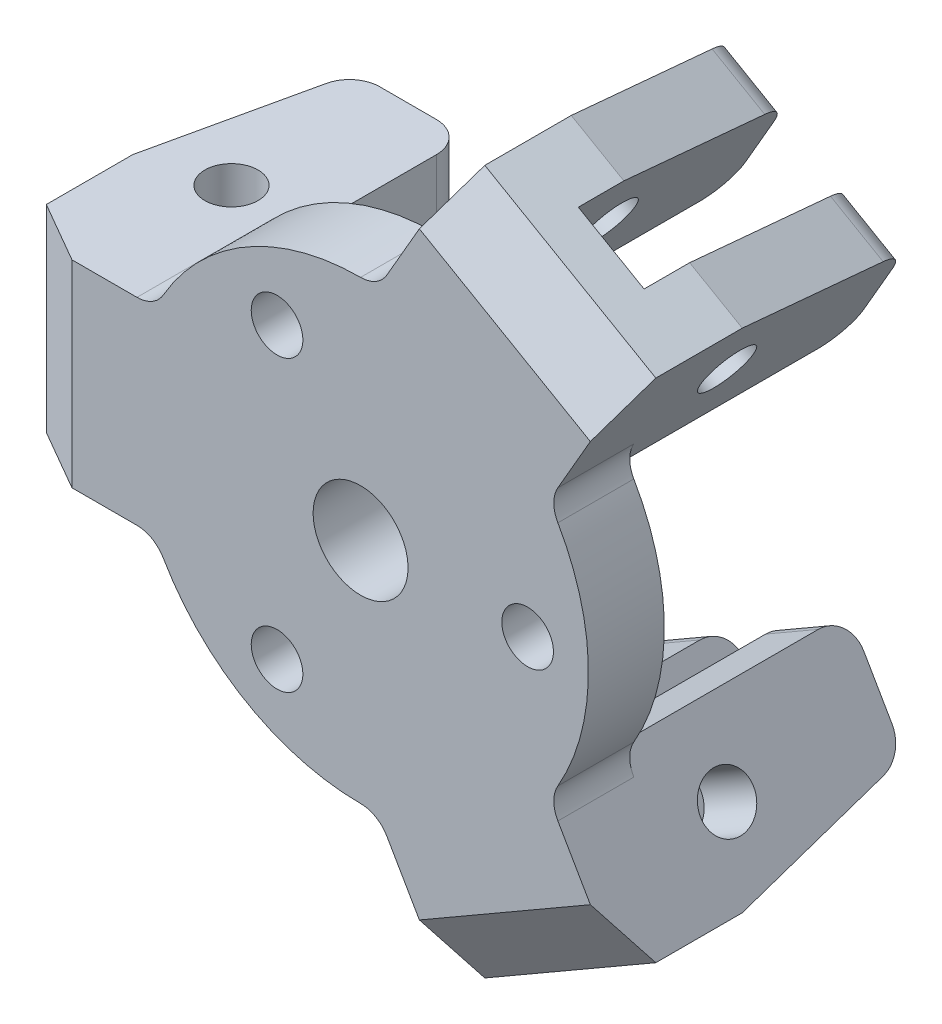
ISO-10303-21;
HEADER;
FILE_DESCRIPTION(('STEP AP214'),'2;1');
FILE_NAME('part.step','',(''),(''),'','','');
FILE_SCHEMA(('AUTOMOTIVE_DESIGN { 1 0 10303 214 1 1 1 1 }'));
ENDSEC;
DATA;
#1=APPLICATION_CONTEXT('core data for automotive mechanical design processes');
#2=APPLICATION_PROTOCOL_DEFINITION('international standard','automotive_design',2000,#1);
#3=PRODUCT_CONTEXT('',#1,'mechanical');
#4=PRODUCT('Part','Part','',(#3));
#5=PRODUCT_RELATED_PRODUCT_CATEGORY('part','',(#4));
#6=PRODUCT_DEFINITION_FORMATION('','',#4);
#7=PRODUCT_DEFINITION_CONTEXT('part definition',#1,'design');
#8=PRODUCT_DEFINITION('design','',#6,#7);
#9=PRODUCT_DEFINITION_SHAPE('','',#8);
#10=(LENGTH_UNIT() NAMED_UNIT(*) SI_UNIT(.MILLI.,.METRE.));
#11=(NAMED_UNIT(*) PLANE_ANGLE_UNIT() SI_UNIT($,.RADIAN.));
#12=(NAMED_UNIT(*) SI_UNIT($,.STERADIAN.) SOLID_ANGLE_UNIT());
#13=UNCERTAINTY_MEASURE_WITH_UNIT(LENGTH_MEASURE(1.E-05),#10,'distance_accuracy_value','');
#14=(GEOMETRIC_REPRESENTATION_CONTEXT(3) GLOBAL_UNCERTAINTY_ASSIGNED_CONTEXT((#13)) GLOBAL_UNIT_ASSIGNED_CONTEXT((#10,
#11,#12)) REPRESENTATION_CONTEXT('',''));
#15=CARTESIAN_POINT('',(0.,0.,0.));
#16=DIRECTION('',(0.,0.,1.));
#17=DIRECTION('',(1.,0.,0.));
#18=AXIS2_PLACEMENT_3D('',#15,#16,#17);
#19=CARTESIAN_POINT('',(0.,0.,0.));
#20=DIRECTION('',(0.,0.,0.999999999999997));
#21=DIRECTION('',(1.,0.,0.));
#22=AXIS2_PLACEMENT_3D('',#19,#20,#21);
#23=PLANE('',#22);
#24=CARTESIAN_POINT('',(-5.49999999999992,9.52627944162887,0.));
#25=DIRECTION('',(0.,0.,-0.999999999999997));
#26=DIRECTION('',(-1.,0.,0.));
#27=AXIS2_PLACEMENT_3D('',#24,#25,#26);
#28=CIRCLE('',#27,3.15);
#29=CARTESIAN_POINT('',(-8.64999999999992,9.52627944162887,0.));
#30=VERTEX_POINT('',#29);
#31=EDGE_CURVE('E607',#30,#30,#28,.T.);
#32=ORIENTED_EDGE('',*,*,#31,.F.);
#33=EDGE_LOOP('',(#32));
#34=FACE_BOUND('',#33,.T.);
#35=CARTESIAN_POINT('',(-5.50000000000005,-9.52627944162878,0.));
#36=DIRECTION('',(0.,0.,-0.999999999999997));
#37=DIRECTION('',(-1.,0.,0.));
#38=AXIS2_PLACEMENT_3D('',#35,#36,#37);
#39=CIRCLE('',#38,3.15);
#40=CARTESIAN_POINT('',(-8.65000000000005,-9.52627944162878,0.));
#41=VERTEX_POINT('',#40);
#42=EDGE_CURVE('E614',#41,#41,#39,.T.);
#43=ORIENTED_EDGE('',*,*,#42,.F.);
#44=EDGE_LOOP('',(#43));
#45=FACE_BOUND('',#44,.T.);
#46=CARTESIAN_POINT('',(11.,0.,0.));
#47=DIRECTION('',(0.,0.,-0.999999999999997));
#48=DIRECTION('',(-1.,0.,0.));
#49=AXIS2_PLACEMENT_3D('',#46,#47,#48);
#50=CIRCLE('',#49,3.15);
#51=CARTESIAN_POINT('',(7.84999999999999,0.,0.));
#52=VERTEX_POINT('',#51);
#53=EDGE_CURVE('E621',#52,#52,#50,.T.);
#54=ORIENTED_EDGE('',*,*,#53,.F.);
#55=EDGE_LOOP('',(#54));
#56=FACE_BOUND('',#55,.T.);
#57=CARTESIAN_POINT('',(0.,0.,0.));
#58=DIRECTION('',(0.,0.,0.999999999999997));
#59=DIRECTION('',(1.,0.,0.));
#60=AXIS2_PLACEMENT_3D('',#57,#58,#59);
#61=CIRCLE('',#60,3.125);
#62=CARTESIAN_POINT('',(-3.12500000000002,0.,0.));
#63=VERTEX_POINT('',#62);
#64=EDGE_CURVE('E704',#63,#63,#61,.T.);
#65=ORIENTED_EDGE('',*,*,#64,.T.);
#66=EDGE_LOOP('',(#65));
#67=FACE_BOUND('',#66,.T.);
#68=DIRECTION('',(0.866025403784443,0.499999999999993,0.));
#69=VECTOR('',#68,1.);
#70=CARTESIAN_POINT('',(6.49999999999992,-11.2583302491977,0.));
#71=LINE('',#70,#69);
#72=CARTESIAN_POINT('',(8.66506350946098,-10.0083302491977,0.));
#73=VERTEX_POINT('',#72);
#74=CARTESIAN_POINT('',(12.1291651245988,-8.00833024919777,0.));
#75=VERTEX_POINT('',#74);
#76=EDGE_CURVE('E503',#73,#75,#71,.T.);
#77=ORIENTED_EDGE('',*,*,#76,.F.);
#78=DIRECTION('',(-0.499999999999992,0.866025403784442,0.));
#79=VECTOR('',#78,1.);
#80=CARTESIAN_POINT('',(2.16506350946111,1.24999999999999,0.));
#81=LINE('',#80,#79);
#82=CARTESIAN_POINT('',(13.6650635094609,-18.6685842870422,0.));
#83=VERTEX_POINT('',#82);
#84=EDGE_CURVE('E496',#83,#73,#81,.T.);
#85=ORIENTED_EDGE('',*,*,#84,.F.);
#86=DIRECTION('',(-0.866025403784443,-0.499999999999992,0.));
#87=VECTOR('',#86,1.);
#88=CARTESIAN_POINT('',(14.5310889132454,-18.1685842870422,0.));
#89=LINE('',#88,#87);
#90=CARTESIAN_POINT('',(9.33493649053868,-21.1685842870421,0.));
#91=VERTEX_POINT('',#90);
#92=EDGE_CURVE('E499',#83,#91,#89,.T.);
#93=ORIENTED_EDGE('',*,*,#92,.T.);
#94=DIRECTION('',(0.499999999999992,-0.866025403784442,0.));
#95=VECTOR('',#94,1.);
#96=CARTESIAN_POINT('',(-2.16506350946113,-1.24999999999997,0.));
#97=LINE('',#96,#95);
#98=CARTESIAN_POINT('',(4.33493649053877,-12.5083302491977,0.));
#99=VERTEX_POINT('',#98);
#100=EDGE_CURVE('E548',#99,#91,#97,.T.);
#101=ORIENTED_EDGE('',*,*,#100,.F.);
#102=DIRECTION('',(0.866025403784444,0.499999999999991,0.));
#103=VECTOR('',#102,1.);
#104=CARTESIAN_POINT('',(6.4999999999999,-11.2583302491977,0.));
#105=LINE('',#104,#103);
#106=CARTESIAN_POINT('',(0.870834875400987,-14.5083302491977,0.));
#107=VERTEX_POINT('',#106);
#108=EDGE_CURVE('E550',#107,#99,#105,.T.);
#109=ORIENTED_EDGE('',*,*,#108,.F.);
#110=DIRECTION('',(-0.499999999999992,0.866025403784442,0.));
#111=VECTOR('',#110,1.);
#112=CARTESIAN_POINT('',(-5.6291651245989,-3.24999999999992,0.));
#113=LINE('',#112,#111);
#114=CARTESIAN_POINT('',(1.73205080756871,-16.,0.));
#115=VERTEX_POINT('',#114);
#116=EDGE_CURVE('E553',#115,#107,#113,.T.);
#117=ORIENTED_EDGE('',*,*,#116,.F.);
#118=CARTESIAN_POINT('',(-1.86408274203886E-13,-17.,0.));
#119=DIRECTION('',(0.,0.,0.999999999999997));
#120=DIRECTION('',(1.,0.,0.));
#121=AXIS2_PLACEMENT_3D('',#118,#119,#120);
#122=CIRCLE('',#121,2.);
#123=CARTESIAN_POINT('',(-1.34933658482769E-13,-15.,0.));
#124=VERTEX_POINT('',#123);
#125=EDGE_CURVE('E917',#115,#124,#122,.T.);
#126=ORIENTED_EDGE('',*,*,#125,.T.);
#127=CARTESIAN_POINT('',(0.,0.,0.));
#128=DIRECTION('',(0.,0.,0.999999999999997));
#129=DIRECTION('',(1.,0.,0.));
#130=AXIS2_PLACEMENT_3D('',#127,#128,#129);
#131=CIRCLE('',#130,15.);
#132=CARTESIAN_POINT('',(-12.9903810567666,-7.49999999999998,0.));
#133=VERTEX_POINT('',#132);
#134=EDGE_CURVE('E714',#133,#124,#131,.T.);
#135=ORIENTED_EDGE('',*,*,#134,.F.);
#136=CARTESIAN_POINT('',(-14.7224318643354,-8.50000000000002,0.));
#137=DIRECTION('',(0.,0.,0.999999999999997));
#138=DIRECTION('',(1.,0.,0.));
#139=AXIS2_PLACEMENT_3D('',#136,#137,#138);
#140=CIRCLE('',#139,2.);
#141=CARTESIAN_POINT('',(-14.7224318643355,-6.49999999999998,0.));
#142=VERTEX_POINT('',#141);
#143=EDGE_CURVE('E923',#133,#142,#140,.T.);
#144=ORIENTED_EDGE('',*,*,#143,.T.);
#145=DIRECTION('',(-1.,0.,0.));
#146=VECTOR('',#145,1.);
#147=CARTESIAN_POINT('',(0.,-6.49999999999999,0.));
#148=LINE('',#147,#146);
#149=CARTESIAN_POINT('',(-13.,-6.49999999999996,0.));
#150=VERTEX_POINT('',#149);
#151=EDGE_CURVE('E674',#150,#142,#148,.T.);
#152=ORIENTED_EDGE('',*,*,#151,.F.);
#153=DIRECTION('',(0.,-0.999999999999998,0.));
#154=VECTOR('',#153,1.);
#155=CARTESIAN_POINT('',(-13.,0.,0.));
#156=LINE('',#155,#154);
#157=CARTESIAN_POINT('',(-13.,-2.49999999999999,0.));
#158=VERTEX_POINT('',#157);
#159=EDGE_CURVE('E676',#158,#150,#156,.T.);
#160=ORIENTED_EDGE('',*,*,#159,.F.);
#161=DIRECTION('',(0.999999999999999,0.,0.));
#162=VECTOR('',#161,1.);
#163=CARTESIAN_POINT('',(0.,-2.49999999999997,0.));
#164=LINE('',#163,#162);
#165=CARTESIAN_POINT('',(-23.,-2.49999999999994,0.));
#166=VERTEX_POINT('',#165);
#167=EDGE_CURVE('E679',#166,#158,#164,.T.);
#168=ORIENTED_EDGE('',*,*,#167,.F.);
#169=DIRECTION('',(0.,0.999999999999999,0.));
#170=VECTOR('',#169,1.);
#171=CARTESIAN_POINT('',(-23.,-3.49999999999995,0.));
#172=LINE('',#171,#170);
#173=CARTESIAN_POINT('',(-23.,2.49999999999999,-1.11022302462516E-13));
#174=VERTEX_POINT('',#173);
#175=EDGE_CURVE('E628',#166,#174,#172,.T.);
#176=ORIENTED_EDGE('',*,*,#175,.T.);
#177=DIRECTION('',(-1.,0.,0.));
#178=VECTOR('',#177,1.);
#179=CARTESIAN_POINT('',(0.,2.50000000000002,0.));
#180=LINE('',#179,#178);
#181=CARTESIAN_POINT('',(-13.,2.50000000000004,0.));
#182=VERTEX_POINT('',#181);
#183=EDGE_CURVE('E699',#182,#174,#180,.T.);
#184=ORIENTED_EDGE('',*,*,#183,.F.);
#185=DIRECTION('',(0.,-0.999999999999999,0.));
#186=VECTOR('',#185,1.);
#187=CARTESIAN_POINT('',(-13.,0.,0.));
#188=LINE('',#187,#186);
#189=CARTESIAN_POINT('',(-13.,6.50000000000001,0.));
#190=VERTEX_POINT('',#189);
#191=EDGE_CURVE('E720',#190,#182,#188,.T.);
#192=ORIENTED_EDGE('',*,*,#191,.F.);
#193=DIRECTION('',(0.999999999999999,0.,0.));
#194=VECTOR('',#193,1.);
#195=CARTESIAN_POINT('',(0.,6.50000000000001,0.));
#196=LINE('',#195,#194);
#197=CARTESIAN_POINT('',(-14.7224318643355,6.50000000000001,0.));
#198=VERTEX_POINT('',#197);
#199=EDGE_CURVE('E701',#198,#190,#196,.T.);
#200=ORIENTED_EDGE('',*,*,#199,.F.);
#201=CARTESIAN_POINT('',(-14.7224318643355,8.5,0.));
#202=DIRECTION('',(0.,0.,0.999999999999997));
#203=DIRECTION('',(1.,0.,0.));
#204=AXIS2_PLACEMENT_3D('',#201,#202,#203);
#205=CIRCLE('',#204,2.);
#206=CARTESIAN_POINT('',(-12.9903810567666,7.50000000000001,0.));
#207=VERTEX_POINT('',#206);
#208=EDGE_CURVE('E926',#198,#207,#205,.T.);
#209=ORIENTED_EDGE('',*,*,#208,.T.);
#210=CARTESIAN_POINT('',(0.,15.,0.));
#211=VERTEX_POINT('',#210);
#212=EDGE_CURVE('E710',#211,#207,#131,.T.);
#213=ORIENTED_EDGE('',*,*,#212,.F.);
#214=CARTESIAN_POINT('',(0.,17.,0.));
#215=DIRECTION('',(0.,0.,0.999999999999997));
#216=DIRECTION('',(1.,0.,0.));
#217=AXIS2_PLACEMENT_3D('',#214,#215,#216);
#218=CIRCLE('',#217,2.);
#219=CARTESIAN_POINT('',(1.73205080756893,16.,0.));
#220=VERTEX_POINT('',#219);
#221=EDGE_CURVE('E12',#211,#220,#218,.T.);
#222=ORIENTED_EDGE('',*,*,#221,.T.);
#223=DIRECTION('',(0.500000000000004,0.866025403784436,0.));
#224=VECTOR('',#223,1.);
#225=CARTESIAN_POINT('',(-5.62916512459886,3.25000000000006,0.));
#226=LINE('',#225,#224);
#227=CARTESIAN_POINT('',(0.870834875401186,14.5083302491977,0.));
#228=VERTEX_POINT('',#227);
#229=EDGE_CURVE('E153',#228,#220,#226,.T.);
#230=ORIENTED_EDGE('',*,*,#229,.F.);
#231=DIRECTION('',(-0.866025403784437,0.500000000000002,0.));
#232=VECTOR('',#231,1.);
#233=CARTESIAN_POINT('',(6.50000000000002,11.2583302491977,0.));
#234=LINE('',#233,#232);
#235=CARTESIAN_POINT('',(4.33493649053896,12.5083302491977,0.));
#236=VERTEX_POINT('',#235);
#237=EDGE_CURVE('E576',#236,#228,#234,.T.);
#238=ORIENTED_EDGE('',*,*,#237,.F.);
#239=DIRECTION('',(-0.500000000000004,-0.866025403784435,0.));
#240=VECTOR('',#239,1.);
#241=CARTESIAN_POINT('',(-2.1650635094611,1.25000000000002,0.));
#242=LINE('',#241,#240);
#243=CARTESIAN_POINT('',(9.33493649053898,21.168584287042,0.));
#244=VERTEX_POINT('',#243);
#245=EDGE_CURVE('E579',#244,#236,#242,.T.);
#246=ORIENTED_EDGE('',*,*,#245,.F.);
#247=DIRECTION('',(0.866025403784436,-0.500000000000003,0.));
#248=VECTOR('',#247,1.);
#249=CARTESIAN_POINT('',(8.46891108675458,21.668584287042,0.));
#250=LINE('',#249,#248);
#251=CARTESIAN_POINT('',(13.6650635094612,18.668584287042,0.));
#252=VERTEX_POINT('',#251);
#253=EDGE_CURVE('E518',#244,#252,#250,.T.);
#254=ORIENTED_EDGE('',*,*,#253,.T.);
#255=DIRECTION('',(0.500000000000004,0.866025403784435,0.));
#256=VECTOR('',#255,1.);
#257=CARTESIAN_POINT('',(2.16506350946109,-1.24999999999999,0.));
#258=LINE('',#257,#256);
#259=CARTESIAN_POINT('',(8.66506350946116,10.0083302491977,0.));
#260=VERTEX_POINT('',#259);
#261=EDGE_CURVE('E599',#260,#252,#258,.T.);
#262=ORIENTED_EDGE('',*,*,#261,.F.);
#263=DIRECTION('',(-0.866025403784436,0.500000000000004,0.));
#264=VECTOR('',#263,1.);
#265=CARTESIAN_POINT('',(6.50000000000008,11.2583302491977,0.));
#266=LINE('',#265,#264);
#267=CARTESIAN_POINT('',(12.1291651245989,8.00833024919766,0.));
#268=VERTEX_POINT('',#267);
#269=EDGE_CURVE('E601',#268,#260,#266,.T.);
#270=ORIENTED_EDGE('',*,*,#269,.F.);
#271=DIRECTION('',(-0.500000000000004,-0.866025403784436,0.));
#272=VECTOR('',#271,1.);
#273=CARTESIAN_POINT('',(5.62916512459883,-3.24999999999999,0.));
#274=LINE('',#273,#272);
#275=CARTESIAN_POINT('',(12.9903810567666,9.49999999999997,0.));
#276=VERTEX_POINT('',#275);
#277=EDGE_CURVE('E604',#276,#268,#274,.T.);
#278=ORIENTED_EDGE('',*,*,#277,.F.);
#279=CARTESIAN_POINT('',(14.7224318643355,8.49999999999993,0.));
#280=DIRECTION('',(0.,0.,0.999999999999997));
#281=DIRECTION('',(1.,0.,0.));
#282=AXIS2_PLACEMENT_3D('',#279,#280,#281);
#283=CIRCLE('',#282,2.);
#284=CARTESIAN_POINT('',(12.9903810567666,7.49999999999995,0.));
#285=VERTEX_POINT('',#284);
#286=EDGE_CURVE('E908',#276,#285,#283,.T.);
#287=ORIENTED_EDGE('',*,*,#286,.T.);
#288=CARTESIAN_POINT('',(12.9903810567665,-7.50000000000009,0.));
#289=VERTEX_POINT('',#288);
#290=EDGE_CURVE('E713',#289,#285,#131,.T.);
#291=ORIENTED_EDGE('',*,*,#290,.F.);
#292=CARTESIAN_POINT('',(14.7224318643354,-8.50000000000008,0.));
#293=DIRECTION('',(0.,0.,0.999999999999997));
#294=DIRECTION('',(1.,0.,0.));
#295=AXIS2_PLACEMENT_3D('',#292,#293,#294);
#296=CIRCLE('',#295,2.);
#297=CARTESIAN_POINT('',(12.9903810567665,-9.50000000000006,0.));
#298=VERTEX_POINT('',#297);
#299=EDGE_CURVE('E914',#289,#298,#296,.T.);
#300=ORIENTED_EDGE('',*,*,#299,.T.);
#301=DIRECTION('',(0.499999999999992,-0.866025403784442,0.));
#302=VECTOR('',#301,1.);
#303=CARTESIAN_POINT('',(5.6291651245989,3.24999999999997,0.));
#304=LINE('',#303,#302);
#305=EDGE_CURVE('E524',#75,#298,#304,.T.);
#306=ORIENTED_EDGE('',*,*,#305,.F.);
#307=EDGE_LOOP('',(#77,#85,#93,#101,#109,#117,#126,#135,#144,#152,#160,#168,#176,#184,#192,#200,
#209,#213,#222,#230,#238,#246,#254,#262,#270,#278,#287,#291,#300,#306));
#308=FACE_BOUND('',#307,.T.);
#309=ADVANCED_FACE('F138',(#34,#45,#56,#67,#308),#23,.F.);
#310=CARTESIAN_POINT('',(0.,0.,5.));
#311=DIRECTION('',(0.,0.,-0.999999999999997));
#312=DIRECTION('',(-1.,0.,0.));
#313=AXIS2_PLACEMENT_3D('',#310,#311,#312);
#314=CYLINDRICAL_SURFACE('',#313,15.);
#315=ORIENTED_EDGE('',*,*,#290,.T.);
#316=DIRECTION('',(0.,0.,-0.999999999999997));
#317=VECTOR('',#316,1.);
#318=CARTESIAN_POINT('',(12.9903810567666,7.49999999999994,5.));
#319=LINE('',#318,#317);
#320=CARTESIAN_POINT('',(12.9903810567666,7.49999999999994,5.));
#321=VERTEX_POINT('',#320);
#322=EDGE_CURVE('E884',#285,#321,#319,.F.);
#323=ORIENTED_EDGE('',*,*,#322,.T.);
#324=CARTESIAN_POINT('',(0.,0.,5.));
#325=DIRECTION('',(0.,0.,0.999999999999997));
#326=DIRECTION('',(1.,0.,0.));
#327=AXIS2_PLACEMENT_3D('',#324,#325,#326);
#328=CIRCLE('',#327,15.);
#329=CARTESIAN_POINT('',(12.9903810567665,-7.50000000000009,5.));
#330=VERTEX_POINT('',#329);
#331=EDGE_CURVE('E718',#330,#321,#328,.T.);
#332=ORIENTED_EDGE('',*,*,#331,.F.);
#333=DIRECTION('',(0.,0.,-0.999999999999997));
#334=VECTOR('',#333,1.);
#335=CARTESIAN_POINT('',(12.9903810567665,-7.50000000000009,5.));
#336=LINE('',#335,#334);
#337=EDGE_CURVE('E882',#330,#289,#336,.T.);
#338=ORIENTED_EDGE('',*,*,#337,.T.);
#339=EDGE_LOOP('',(#315,#323,#332,#338));
#340=FACE_BOUND('',#339,.T.);
#341=ADVANCED_FACE('F978',(#340),#314,.T.);
#342=ORIENTED_EDGE('',*,*,#134,.T.);
#343=DIRECTION('',(0.,0.,-0.999999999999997));
#344=VECTOR('',#343,1.);
#345=CARTESIAN_POINT('',(-1.56612877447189E-13,-14.9999999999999,5.));
#346=LINE('',#345,#344);
#347=CARTESIAN_POINT('',(-1.56612877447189E-13,-14.9999999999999,5.));
#348=VERTEX_POINT('',#347);
#349=EDGE_CURVE('E894',#124,#348,#346,.F.);
#350=ORIENTED_EDGE('',*,*,#349,.T.);
#351=CARTESIAN_POINT('',(-12.9903810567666,-7.49999999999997,5.));
#352=VERTEX_POINT('',#351);
#353=EDGE_CURVE('E719',#352,#348,#328,.T.);
#354=ORIENTED_EDGE('',*,*,#353,.F.);
#355=DIRECTION('',(0.,0.,-0.999999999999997));
#356=VECTOR('',#355,1.);
#357=CARTESIAN_POINT('',(-12.9903810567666,-7.5,5.));
#358=LINE('',#357,#356);
#359=EDGE_CURVE('E892',#352,#133,#358,.T.);
#360=ORIENTED_EDGE('',*,*,#359,.T.);
#361=EDGE_LOOP('',(#342,#350,#354,#360));
#362=FACE_BOUND('',#361,.T.);
#363=ADVANCED_FACE('F140',(#362),#314,.T.);
#364=ORIENTED_EDGE('',*,*,#212,.T.);
#365=DIRECTION('',(0.,0.,-0.999999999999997));
#366=VECTOR('',#365,1.);
#367=CARTESIAN_POINT('',(-12.9903810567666,7.50000000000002,4.99999999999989));
#368=LINE('',#367,#366);
#369=CARTESIAN_POINT('',(-12.9903810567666,7.50000000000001,4.99999999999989));
#370=VERTEX_POINT('',#369);
#371=EDGE_CURVE('E904',#207,#370,#368,.F.);
#372=ORIENTED_EDGE('',*,*,#371,.T.);
#373=CARTESIAN_POINT('',(0.,15.,4.99999999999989));
#374=VERTEX_POINT('',#373);
#375=EDGE_CURVE('E715',#374,#370,#328,.T.);
#376=ORIENTED_EDGE('',*,*,#375,.F.);
#377=DIRECTION('',(0.,0.,-0.999999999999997));
#378=VECTOR('',#377,1.);
#379=CARTESIAN_POINT('',(0.,15.,4.99999999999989));
#380=LINE('',#379,#378);
#381=EDGE_CURVE('E902',#374,#211,#380,.T.);
#382=ORIENTED_EDGE('',*,*,#381,.T.);
#383=EDGE_LOOP('',(#364,#372,#376,#382));
#384=FACE_BOUND('',#383,.T.);
#385=ADVANCED_FACE('F937',(#384),#314,.T.);
#386=CARTESIAN_POINT('',(0.,0.,5.));
#387=DIRECTION('',(0.,0.,0.999999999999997));
#388=DIRECTION('',(1.,0.,0.));
#389=AXIS2_PLACEMENT_3D('',#386,#387,#388);
#390=PLANE('',#389);
#391=DIRECTION('',(-1.,0.,0.));
#392=VECTOR('',#391,1.);
#393=CARTESIAN_POINT('',(-23.,-6.49999999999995,4.99999999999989));
#394=LINE('',#393,#392);
#395=CARTESIAN_POINT('',(-14.7224318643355,-6.49999999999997,5.));
#396=VERTEX_POINT('',#395);
#397=CARTESIAN_POINT('',(-19.,-6.49999999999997,4.99999999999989));
#398=VERTEX_POINT('',#397);
#399=EDGE_CURVE('E655',#396,#398,#394,.T.);
#400=ORIENTED_EDGE('',*,*,#399,.F.);
#401=CARTESIAN_POINT('',(-14.7224318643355,-8.49999999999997,5.));
#402=DIRECTION('',(0.,0.,0.999999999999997));
#403=DIRECTION('',(1.,0.,0.));
#404=AXIS2_PLACEMENT_3D('',#401,#402,#403);
#405=CIRCLE('',#404,2.);
#406=EDGE_CURVE('E921',#396,#352,#405,.F.);
#407=ORIENTED_EDGE('',*,*,#406,.T.);
#408=ORIENTED_EDGE('',*,*,#353,.T.);
#409=CARTESIAN_POINT('',(-2.08954854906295E-13,-17.,5.));
#410=DIRECTION('',(0.,0.,0.999999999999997));
#411=DIRECTION('',(1.,0.,0.));
#412=AXIS2_PLACEMENT_3D('',#409,#410,#411);
#413=CIRCLE('',#412,2.);
#414=CARTESIAN_POINT('',(1.73205080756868,-16.,5.));
#415=VERTEX_POINT('',#414);
#416=EDGE_CURVE('E919',#348,#415,#413,.F.);
#417=ORIENTED_EDGE('',*,*,#416,.T.);
#418=DIRECTION('',(-0.499999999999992,0.866025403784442,0.));
#419=VECTOR('',#418,1.);
#420=CARTESIAN_POINT('',(5.87083487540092,-23.1685842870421,5.));
#421=LINE('',#420,#419);
#422=CARTESIAN_POINT('',(3.87083487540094,-19.7044826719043,5.));
#423=VERTEX_POINT('',#422);
#424=EDGE_CURVE('E508',#423,#415,#421,.T.);
#425=ORIENTED_EDGE('',*,*,#424,.F.);
#426=DIRECTION('',(0.866025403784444,0.499999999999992,0.));
#427=VECTOR('',#426,1.);
#428=CARTESIAN_POINT('',(7.33493649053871,-17.7044826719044,5.));
#429=LINE('',#428,#427);
#430=CARTESIAN_POINT('',(15.1291651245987,-13.2044826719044,5.));
#431=VERTEX_POINT('',#430);
#432=EDGE_CURVE('E872',#423,#431,#429,.T.);
#433=ORIENTED_EDGE('',*,*,#432,.T.);
#434=DIRECTION('',(0.499999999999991,-0.866025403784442,0.));
#435=VECTOR('',#434,1.);
#436=CARTESIAN_POINT('',(17.1291651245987,-16.6685842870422,5.));
#437=LINE('',#436,#435);
#438=CARTESIAN_POINT('',(12.9903810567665,-9.50000000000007,5.));
#439=VERTEX_POINT('',#438);
#440=EDGE_CURVE('E1024',#439,#431,#437,.T.);
#441=ORIENTED_EDGE('',*,*,#440,.F.);
#442=CARTESIAN_POINT('',(14.7224318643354,-8.50000000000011,5.));
#443=DIRECTION('',(0.,0.,0.999999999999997));
#444=DIRECTION('',(1.,0.,0.));
#445=AXIS2_PLACEMENT_3D('',#442,#443,#444);
#446=CIRCLE('',#445,2.);
#447=EDGE_CURVE('E912',#439,#330,#446,.F.);
#448=ORIENTED_EDGE('',*,*,#447,.T.);
#449=ORIENTED_EDGE('',*,*,#331,.T.);
#450=CARTESIAN_POINT('',(14.7224318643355,8.49999999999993,5.));
#451=DIRECTION('',(0.,0.,0.999999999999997));
#452=DIRECTION('',(1.,0.,0.));
#453=AXIS2_PLACEMENT_3D('',#450,#451,#452);
#454=CIRCLE('',#453,2.);
#455=CARTESIAN_POINT('',(12.9903810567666,9.49999999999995,5.));
#456=VERTEX_POINT('',#455);
#457=EDGE_CURVE('E910',#321,#456,#454,.F.);
#458=ORIENTED_EDGE('',*,*,#457,.T.);
#459=DIRECTION('',(-0.500000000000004,-0.866025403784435,0.));
#460=VECTOR('',#459,1.);
#461=CARTESIAN_POINT('',(17.1291651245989,16.668584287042,5.));
#462=LINE('',#461,#460);
#463=CARTESIAN_POINT('',(15.1291651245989,13.2044826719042,5.));
#464=VERTEX_POINT('',#463);
#465=EDGE_CURVE('E581',#464,#456,#462,.T.);
#466=ORIENTED_EDGE('',*,*,#465,.F.);
#467=DIRECTION('',(-0.866025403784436,0.500000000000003,0.));
#468=VECTOR('',#467,1.);
#469=CARTESIAN_POINT('',(11.6650635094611,15.2044826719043,5.));
#470=LINE('',#469,#468);
#471=CARTESIAN_POINT('',(3.87083487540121,19.7044826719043,4.99999999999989));
#472=VERTEX_POINT('',#471);
#473=EDGE_CURVE('E862',#464,#472,#470,.T.);
#474=ORIENTED_EDGE('',*,*,#473,.T.);
#475=DIRECTION('',(0.500000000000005,0.866025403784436,0.));
#476=VECTOR('',#475,1.);
#477=CARTESIAN_POINT('',(5.87083487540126,23.1685842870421,4.99999999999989));
#478=LINE('',#477,#476);
#479=CARTESIAN_POINT('',(1.73205080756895,16.,4.99999999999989));
#480=VERTEX_POINT('',#479);
#481=EDGE_CURVE('E556',#480,#472,#478,.T.);
#482=ORIENTED_EDGE('',*,*,#481,.F.);
#483=CARTESIAN_POINT('',(0.,17.,4.99999999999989));
#484=DIRECTION('',(0.,0.,0.999999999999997));
#485=DIRECTION('',(1.,0.,0.));
#486=AXIS2_PLACEMENT_3D('',#483,#484,#485);
#487=CIRCLE('',#486,2.);
#488=EDGE_CURVE('E146',#480,#374,#487,.F.);
#489=ORIENTED_EDGE('',*,*,#488,.T.);
#490=ORIENTED_EDGE('',*,*,#375,.T.);
#491=CARTESIAN_POINT('',(-14.7224318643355,8.50000000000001,4.99999999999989));
#492=DIRECTION('',(0.,0.,0.999999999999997));
#493=DIRECTION('',(1.,0.,0.));
#494=AXIS2_PLACEMENT_3D('',#491,#492,#493);
#495=CIRCLE('',#494,2.);
#496=CARTESIAN_POINT('',(-14.7224318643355,6.5,4.99999999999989));
#497=VERTEX_POINT('',#496);
#498=EDGE_CURVE('E928',#370,#497,#495,.F.);
#499=ORIENTED_EDGE('',*,*,#498,.T.);
#500=DIRECTION('',(0.999999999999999,0.,0.));
#501=VECTOR('',#500,1.);
#502=CARTESIAN_POINT('',(-23.,6.50000000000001,4.99999999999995));
#503=LINE('',#502,#501);
#504=CARTESIAN_POINT('',(-19.,6.49999999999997,4.99999999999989));
#505=VERTEX_POINT('',#504);
#506=EDGE_CURVE('E681',#505,#497,#503,.T.);
#507=ORIENTED_EDGE('',*,*,#506,.F.);
#508=DIRECTION('',(0.,-0.999999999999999,0.));
#509=VECTOR('',#508,1.);
#510=CARTESIAN_POINT('',(-19.,2.49999999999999,4.99999999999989));
#511=LINE('',#510,#509);
#512=EDGE_CURVE('E764',#505,#398,#511,.T.);
#513=ORIENTED_EDGE('',*,*,#512,.T.);
#514=EDGE_LOOP('',(#400,#407,#408,#417,#425,#433,#441,#448,#449,#458,#466,#474,#482,#489,#490,
#499,#507,#513));
#515=FACE_BOUND('',#514,.T.);
#516=CARTESIAN_POINT('',(-5.49999999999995,9.52627944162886,4.99999999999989));
#517=DIRECTION('',(0.,0.,0.999999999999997));
#518=DIRECTION('',(1.,0.,0.));
#519=AXIS2_PLACEMENT_3D('',#516,#517,#518);
#520=CIRCLE('',#519,1.69999999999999);
#521=CARTESIAN_POINT('',(-7.19999999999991,9.52627944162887,4.99999999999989));
#522=VERTEX_POINT('',#521);
#523=EDGE_CURVE('E613',#522,#522,#520,.T.);
#524=ORIENTED_EDGE('',*,*,#523,.F.);
#525=EDGE_LOOP('',(#524));
#526=FACE_BOUND('',#525,.T.);
#527=CARTESIAN_POINT('',(-5.50000000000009,-9.52627944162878,5.));
#528=DIRECTION('',(0.,0.,0.999999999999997));
#529=DIRECTION('',(1.,0.,0.));
#530=AXIS2_PLACEMENT_3D('',#527,#528,#529);
#531=CIRCLE('',#530,1.69999999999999);
#532=CARTESIAN_POINT('',(-7.20000000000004,-9.52627944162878,5.));
#533=VERTEX_POINT('',#532);
#534=EDGE_CURVE('E620',#533,#533,#531,.T.);
#535=ORIENTED_EDGE('',*,*,#534,.F.);
#536=EDGE_LOOP('',(#535));
#537=FACE_BOUND('',#536,.T.);
#538=CARTESIAN_POINT('',(11.,0.,5.));
#539=DIRECTION('',(0.,0.,0.999999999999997));
#540=DIRECTION('',(1.,0.,0.));
#541=AXIS2_PLACEMENT_3D('',#538,#539,#540);
#542=CIRCLE('',#541,1.69999999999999);
#543=CARTESIAN_POINT('',(9.29999999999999,0.,5.));
#544=VERTEX_POINT('',#543);
#545=EDGE_CURVE('E627',#544,#544,#542,.T.);
#546=ORIENTED_EDGE('',*,*,#545,.F.);
#547=EDGE_LOOP('',(#546));
#548=FACE_BOUND('',#547,.T.);
#549=CARTESIAN_POINT('',(0.,0.,5.));
#550=DIRECTION('',(0.,0.,0.999999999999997));
#551=DIRECTION('',(1.,0.,0.));
#552=AXIS2_PLACEMENT_3D('',#549,#550,#551);
#553=CIRCLE('',#552,3.125);
#554=CARTESIAN_POINT('',(-3.12500000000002,0.,5.));
#555=VERTEX_POINT('',#554);
#556=EDGE_CURVE('E707',#555,#555,#553,.T.);
#557=ORIENTED_EDGE('',*,*,#556,.F.);
#558=EDGE_LOOP('',(#557));
#559=FACE_BOUND('',#558,.T.);
#560=ADVANCED_FACE('F933',(#515,#526,#537,#548,#559),#390,.T.);
#561=CARTESIAN_POINT('',(0.,0.,5.));
#562=DIRECTION('',(0.,0.,-0.999999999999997));
#563=DIRECTION('',(-1.,0.,0.));
#564=AXIS2_PLACEMENT_3D('',#561,#562,#563);
#565=CYLINDRICAL_SURFACE('',#564,3.125);
#566=CARTESIAN_POINT('',(-3.12500000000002,0.,5.));
#567=CARTESIAN_POINT('',(-3.12500000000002,0.,4.94791666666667));
#568=CARTESIAN_POINT('',(-3.12500000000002,0.,4.89583333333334));
#569=CARTESIAN_POINT('',(-3.12500000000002,0.,4.79166666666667));
#570=CARTESIAN_POINT('',(-3.12500000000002,0.,4.73958333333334));
#571=CARTESIAN_POINT('',(-3.12500000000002,0.,4.63541666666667));
#572=CARTESIAN_POINT('',(-3.12500000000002,0.,4.58333333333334));
#573=CARTESIAN_POINT('',(-3.12500000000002,0.,4.47916666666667));
#574=CARTESIAN_POINT('',(-3.12500000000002,0.,4.42708333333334));
#575=CARTESIAN_POINT('',(-3.12500000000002,0.,4.32291666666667));
#576=CARTESIAN_POINT('',(-3.12500000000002,0.,4.27083333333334));
#577=CARTESIAN_POINT('',(-3.12500000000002,0.,4.16666666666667));
#578=CARTESIAN_POINT('',(-3.12500000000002,0.,4.11458333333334));
#579=CARTESIAN_POINT('',(-3.12500000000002,0.,4.01041666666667));
#580=CARTESIAN_POINT('',(-3.12500000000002,0.,3.95833333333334));
#581=CARTESIAN_POINT('',(-3.12500000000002,0.,3.85416666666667));
#582=CARTESIAN_POINT('',(-3.12500000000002,0.,3.80208333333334));
#583=CARTESIAN_POINT('',(-3.12500000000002,0.,3.69791666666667));
#584=CARTESIAN_POINT('',(-3.12500000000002,0.,3.64583333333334));
#585=CARTESIAN_POINT('',(-3.12500000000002,0.,3.54166666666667));
#586=CARTESIAN_POINT('',(-3.12500000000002,0.,3.48958333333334));
#587=CARTESIAN_POINT('',(-3.12500000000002,0.,3.38541666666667));
#588=CARTESIAN_POINT('',(-3.12500000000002,0.,3.33333333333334));
#589=CARTESIAN_POINT('',(-3.12500000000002,0.,3.22916666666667));
#590=CARTESIAN_POINT('',(-3.12500000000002,0.,3.17708333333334));
#591=CARTESIAN_POINT('',(-3.12500000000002,0.,3.07291666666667));
#592=CARTESIAN_POINT('',(-3.12500000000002,0.,3.02083333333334));
#593=CARTESIAN_POINT('',(-3.12500000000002,0.,2.91666666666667));
#594=CARTESIAN_POINT('',(-3.12500000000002,0.,2.86458333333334));
#595=CARTESIAN_POINT('',(-3.12500000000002,0.,2.76041666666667));
#596=CARTESIAN_POINT('',(-3.12500000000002,0.,2.70833333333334));
#597=CARTESIAN_POINT('',(-3.12500000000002,0.,2.60416666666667));
#598=CARTESIAN_POINT('',(-3.12500000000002,0.,2.55208333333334));
#599=CARTESIAN_POINT('',(-3.12500000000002,0.,2.44791666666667));
#600=CARTESIAN_POINT('',(-3.12500000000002,0.,2.39583333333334));
#601=CARTESIAN_POINT('',(-3.12500000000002,0.,2.29166666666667));
#602=CARTESIAN_POINT('',(-3.12500000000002,0.,2.23958333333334));
#603=CARTESIAN_POINT('',(-3.12500000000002,0.,2.13541666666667));
#604=CARTESIAN_POINT('',(-3.12500000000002,0.,2.08333333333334));
#605=CARTESIAN_POINT('',(-3.12500000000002,0.,1.97916666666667));
#606=CARTESIAN_POINT('',(-3.12500000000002,0.,1.92708333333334));
#607=CARTESIAN_POINT('',(-3.12500000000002,0.,1.82291666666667));
#608=CARTESIAN_POINT('',(-3.12500000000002,0.,1.77083333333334));
#609=CARTESIAN_POINT('',(-3.12500000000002,0.,1.66666666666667));
#610=CARTESIAN_POINT('',(-3.12500000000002,0.,1.61458333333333));
#611=CARTESIAN_POINT('',(-3.12500000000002,0.,1.51041666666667));
#612=CARTESIAN_POINT('',(-3.12500000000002,0.,1.45833333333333));
#613=CARTESIAN_POINT('',(-3.12500000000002,0.,1.35416666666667));
#614=CARTESIAN_POINT('',(-3.12500000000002,0.,1.30208333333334));
#615=CARTESIAN_POINT('',(-3.12500000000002,0.,1.19791666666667));
#616=CARTESIAN_POINT('',(-3.12500000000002,0.,1.14583333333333));
#617=CARTESIAN_POINT('',(-3.12500000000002,0.,1.04166666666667));
#618=CARTESIAN_POINT('',(-3.12500000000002,0.,0.989583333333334));
#619=CARTESIAN_POINT('',(-3.12500000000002,0.,0.885416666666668));
#620=CARTESIAN_POINT('',(-3.12500000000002,0.,0.833333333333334));
#621=CARTESIAN_POINT('',(-3.12500000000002,0.,0.729166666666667));
#622=CARTESIAN_POINT('',(-3.12500000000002,0.,0.677083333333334));
#623=CARTESIAN_POINT('',(-3.12500000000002,0.,0.572916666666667));
#624=CARTESIAN_POINT('',(-3.12500000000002,0.,0.520833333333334));
#625=CARTESIAN_POINT('',(-3.12500000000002,0.,0.416666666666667));
#626=CARTESIAN_POINT('',(-3.12500000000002,0.,0.364583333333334));
#627=CARTESIAN_POINT('',(-3.12500000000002,0.,0.260416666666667));
#628=CARTESIAN_POINT('',(-3.12500000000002,0.,0.208333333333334));
#629=CARTESIAN_POINT('',(-3.12500000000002,0.,0.104166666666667));
#630=CARTESIAN_POINT('',(-3.12500000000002,0.,0.0520833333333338));
#631=CARTESIAN_POINT('',(-3.12500000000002,0.,0.));
#632=B_SPLINE_CURVE_WITH_KNOTS('',3,(#566,#567,#568,#569,#570,#571,#572,#573,#574,#575,#576,
#577,#578,#579,#580,#581,#582,#583,#584,#585,#586,#587,#588,#589,#590,#591,#592,#593,#594,#595,
#596,#597,#598,#599,#600,#601,#602,#603,#604,#605,#606,#607,#608,#609,#610,#611,#612,#613,#614,
#615,#616,#617,#618,#619,#620,#621,#622,#623,#624,#625,#626,#627,#628,#629,#630,#631),
.UNSPECIFIED.,.F.,.F.,(4,2,2,2,2,2,2,2,2,2,2,2,2,2,2,2,2,2,2,2,2,2,2,2,2,2,2,2,2,2,2,2,4),(0.,
0.156249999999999,0.312499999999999,0.46875,0.625,0.78125,0.9375,1.09375,1.25,1.40625,1.5625,
1.71875,1.875,2.03125,2.1875,2.34375,2.5,2.65625,2.8125,2.96875,3.125,3.28125,3.4375,3.59375,
3.75,3.90625,4.0625,4.21875,4.375,4.53125,4.6875,4.84375,5.),.UNSPECIFIED.);
#633=EDGE_CURVE('BSEAM1145',#555,#63,#632,.T.);
#634=ORIENTED_EDGE('',*,*,#556,.T.);
#635=ORIENTED_EDGE('',*,*,#64,.F.);
#636=ORIENTED_EDGE('',*,*,#633,.T.);
#637=ORIENTED_EDGE('',*,*,#633,.F.);
#638=EDGE_LOOP('',(#634,#636,#635,#637));
#639=FACE_BOUND('',#638,.T.);
#640=ADVANCED_FACE('F1145',(#639),#565,.F.);
#641=CARTESIAN_POINT('',(-13.,6.49999999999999,-15.));
#642=DIRECTION('',(-1.,0.,0.));
#643=DIRECTION('',(0.,-0.999999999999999,0.));
#644=AXIS2_PLACEMENT_3D('',#641,#642,#643);
#645=PLANE('',#644);
#646=DIRECTION('',(0.,0.,0.999999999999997));
#647=VECTOR('',#646,1.);
#648=CARTESIAN_POINT('',(-13.,2.50000000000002,-15.));
#649=LINE('',#648,#647);
#650=CARTESIAN_POINT('',(-13.,2.50000000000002,-13.));
#651=VERTEX_POINT('',#650);
#652=EDGE_CURVE('E695',#651,#182,#649,.T.);
#653=ORIENTED_EDGE('',*,*,#652,.F.);
#654=DIRECTION('',(0.,-0.999999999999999,0.));
#655=VECTOR('',#654,1.);
#656=CARTESIAN_POINT('',(-13.,6.49999999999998,-13.));
#657=LINE('',#656,#655);
#658=CARTESIAN_POINT('',(-13.,6.49999999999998,-13.));
#659=VERTEX_POINT('',#658);
#660=EDGE_CURVE('E750',#651,#659,#657,.F.);
#661=ORIENTED_EDGE('',*,*,#660,.T.);
#662=DIRECTION('',(0.,0.,0.999999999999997));
#663=VECTOR('',#662,1.);
#664=CARTESIAN_POINT('',(-13.,6.49999999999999,-15.));
#665=LINE('',#664,#663);
#666=EDGE_CURVE('E697',#659,#190,#665,.T.);
#667=ORIENTED_EDGE('',*,*,#666,.T.);
#668=ORIENTED_EDGE('',*,*,#191,.T.);
#669=EDGE_LOOP('',(#653,#661,#667,#668));
#670=FACE_BOUND('',#669,.T.);
#671=ADVANCED_FACE('F1152',(#670),#645,.F.);
#672=CARTESIAN_POINT('',(-23.,6.50000000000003,-15.));
#673=DIRECTION('',(0.,-0.999999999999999,0.));
#674=DIRECTION('',(0.999999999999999,0.,0.));
#675=AXIS2_PLACEMENT_3D('',#672,#673,#674);
#676=PLANE('',#675);
#677=CARTESIAN_POINT('',(-18.,6.50000000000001,-4.49999999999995));
#678=DIRECTION('',(0.,0.999999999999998,0.));
#679=DIRECTION('',(-1.,0.,0.));
#680=AXIS2_PLACEMENT_3D('',#677,#678,#679);
#681=CIRCLE('',#680,1.75);
#682=CARTESIAN_POINT('',(-19.75,6.50000000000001,-4.49999999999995));
#683=VERTEX_POINT('',#682);
#684=EDGE_CURVE('E631',#683,#683,#681,.T.);
#685=ORIENTED_EDGE('',*,*,#684,.F.);
#686=EDGE_LOOP('',(#685));
#687=FACE_BOUND('',#686,.T.);
#688=ORIENTED_EDGE('',*,*,#506,.T.);
#689=DIRECTION('',(0.,0.,0.999999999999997));
#690=VECTOR('',#689,1.);
#691=CARTESIAN_POINT('',(-14.7224318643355,6.50000000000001,0.));
#692=LINE('',#691,#690);
#693=EDGE_CURVE('E899',#497,#198,#692,.F.);
#694=ORIENTED_EDGE('',*,*,#693,.T.);
#695=ORIENTED_EDGE('',*,*,#199,.T.);
#696=ORIENTED_EDGE('',*,*,#666,.F.);
#697=CARTESIAN_POINT('',(-15.,6.50000000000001,-13.));
#698=DIRECTION('',(0.,-0.999999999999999,0.));
#699=DIRECTION('',(0.999999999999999,0.,0.));
#700=AXIS2_PLACEMENT_3D('',#697,#698,#699);
#701=CIRCLE('',#700,2.);
#702=CARTESIAN_POINT('',(-15.,6.50000000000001,-15.));
#703=VERTEX_POINT('',#702);
#704=EDGE_CURVE('E754',#659,#703,#701,.F.);
#705=ORIENTED_EDGE('',*,*,#704,.T.);
#706=DIRECTION('',(0.999999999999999,0.,0.));
#707=VECTOR('',#706,1.);
#708=CARTESIAN_POINT('',(-23.,6.50000000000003,-15.));
#709=LINE('',#708,#707);
#710=CARTESIAN_POINT('',(-18.7344943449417,6.50000000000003,-15.));
#711=VERTEX_POINT('',#710);
#712=EDGE_CURVE('E684',#711,#703,#709,.T.);
#713=ORIENTED_EDGE('',*,*,#712,.F.);
#714=CARTESIAN_POINT('',(-18.7344943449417,6.5,-13.));
#715=DIRECTION('',(0.,-0.999999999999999,0.));
#716=DIRECTION('',(0.999999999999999,0.,0.));
#717=AXIS2_PLACEMENT_3D('',#714,#715,#716);
#718=CIRCLE('',#717,2.);
#719=CARTESIAN_POINT('',(-20.6870863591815,6.49999999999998,-13.4328792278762));
#720=VERTEX_POINT('',#719);
#721=EDGE_CURVE('E752',#711,#720,#718,.F.);
#722=ORIENTED_EDGE('',*,*,#721,.T.);
#723=DIRECTION('',(0.216439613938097,0.,-0.976296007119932));
#724=VECTOR('',#723,1.);
#725=CARTESIAN_POINT('',(-20.3396640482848,6.50000000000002,-15.));
#726=LINE('',#725,#724);
#727=CARTESIAN_POINT('',(-23.,6.49999999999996,-3.));
#728=VERTEX_POINT('',#727);
#729=EDGE_CURVE('E641',#728,#720,#726,.T.);
#730=ORIENTED_EDGE('',*,*,#729,.F.);
#731=DIRECTION('',(0.,0.,0.999999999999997));
#732=VECTOR('',#731,1.);
#733=CARTESIAN_POINT('',(-23.,6.50000000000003,-15.));
#734=LINE('',#733,#732);
#735=CARTESIAN_POINT('',(-23.,6.49999999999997,2.69059892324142));
#736=VERTEX_POINT('',#735);
#737=EDGE_CURVE('E690',#728,#736,#734,.T.);
#738=ORIENTED_EDGE('',*,*,#737,.T.);
#739=DIRECTION('',(0.86602540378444,0.,0.499999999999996));
#740=VECTOR('',#739,1.);
#741=CARTESIAN_POINT('',(-23.,6.49999999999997,2.69059892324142));
#742=LINE('',#741,#740);
#743=EDGE_CURVE('E769',#736,#505,#742,.T.);
#744=ORIENTED_EDGE('',*,*,#743,.T.);
#745=EDGE_LOOP('',(#688,#694,#695,#696,#705,#713,#722,#730,#738,#744));
#746=FACE_BOUND('',#745,.T.);
#747=ADVANCED_FACE('F950',(#687,#746),#676,.F.);
#748=CARTESIAN_POINT('',(-13.,2.50000000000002,-15.));
#749=DIRECTION('',(0.,0.999999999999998,0.));
#750=DIRECTION('',(-1.,0.,0.));
#751=AXIS2_PLACEMENT_3D('',#748,#749,#750);
#752=PLANE('',#751);
#753=CARTESIAN_POINT('',(-18.,2.50000000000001,-4.49999999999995));
#754=DIRECTION('',(0.,0.999999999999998,0.));
#755=DIRECTION('',(-1.,0.,0.));
#756=AXIS2_PLACEMENT_3D('',#753,#754,#755);
#757=CIRCLE('',#756,1.75);
#758=CARTESIAN_POINT('',(-19.75,2.50000000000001,-4.49999999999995));
#759=VERTEX_POINT('',#758);
#760=EDGE_CURVE('E638',#759,#759,#757,.T.);
#761=ORIENTED_EDGE('',*,*,#760,.T.);
#762=EDGE_LOOP('',(#761));
#763=FACE_BOUND('',#762,.T.);
#764=ORIENTED_EDGE('',*,*,#183,.T.);
#765=DIRECTION('',(0.,0.,0.999999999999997));
#766=VECTOR('',#765,1.);
#767=CARTESIAN_POINT('',(-23.,2.50000000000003,-15.));
#768=LINE('',#767,#766);
#769=CARTESIAN_POINT('',(-23.,2.50000000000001,-3.));
#770=VERTEX_POINT('',#769);
#771=EDGE_CURVE('E692',#770,#174,#768,.T.);
#772=ORIENTED_EDGE('',*,*,#771,.F.);
#773=DIRECTION('',(0.216439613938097,0.,-0.976296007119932));
#774=VECTOR('',#773,1.);
#775=CARTESIAN_POINT('',(-19.9958293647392,2.50000000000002,-16.5509380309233));
#776=LINE('',#775,#774);
#777=CARTESIAN_POINT('',(-20.6870863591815,2.50000000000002,-13.4328792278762));
#778=VERTEX_POINT('',#777);
#779=EDGE_CURVE('E652',#770,#778,#776,.T.);
#780=ORIENTED_EDGE('',*,*,#779,.T.);
#781=CARTESIAN_POINT('',(-18.7344943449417,2.5,-13.));
#782=DIRECTION('',(0.,0.999999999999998,0.));
#783=DIRECTION('',(-1.,0.,0.));
#784=AXIS2_PLACEMENT_3D('',#781,#782,#783);
#785=CIRCLE('',#784,2.);
#786=CARTESIAN_POINT('',(-18.7344943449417,2.50000000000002,-15.));
#787=VERTEX_POINT('',#786);
#788=EDGE_CURVE('E746',#778,#787,#785,.F.);
#789=ORIENTED_EDGE('',*,*,#788,.T.);
#790=DIRECTION('',(-1.,0.,0.));
#791=VECTOR('',#790,1.);
#792=CARTESIAN_POINT('',(-13.,2.50000000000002,-15.));
#793=LINE('',#792,#791);
#794=CARTESIAN_POINT('',(-15.,2.50000000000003,-15.));
#795=VERTEX_POINT('',#794);
#796=EDGE_CURVE('E687',#795,#787,#793,.T.);
#797=ORIENTED_EDGE('',*,*,#796,.F.);
#798=CARTESIAN_POINT('',(-15.,2.49999999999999,-13.));
#799=DIRECTION('',(0.,0.999999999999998,0.));
#800=DIRECTION('',(-1.,0.,0.));
#801=AXIS2_PLACEMENT_3D('',#798,#799,#800);
#802=CIRCLE('',#801,2.);
#803=EDGE_CURVE('E748',#795,#651,#802,.F.);
#804=ORIENTED_EDGE('',*,*,#803,.T.);
#805=ORIENTED_EDGE('',*,*,#652,.T.);
#806=EDGE_LOOP('',(#764,#772,#780,#789,#797,#804,#805));
#807=FACE_BOUND('',#806,.T.);
#808=ADVANCED_FACE('F1190',(#763,#807),#752,.F.);
#809=CARTESIAN_POINT('',(-23.,2.50000000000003,-15.));
#810=DIRECTION('',(1.,0.,0.));
#811=DIRECTION('',(0.,0.,-0.999999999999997));
#812=AXIS2_PLACEMENT_3D('',#809,#810,#811);
#813=PLANE('',#812);
#814=ORIENTED_EDGE('',*,*,#771,.T.);
#815=ORIENTED_EDGE('',*,*,#175,.F.);
#816=DIRECTION('',(0.,0.,0.999999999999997));
#817=VECTOR('',#816,1.);
#818=CARTESIAN_POINT('',(-23.,-2.50000000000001,-15.));
#819=LINE('',#818,#817);
#820=CARTESIAN_POINT('',(-23.,-2.49999999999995,-3.));
#821=VERTEX_POINT('',#820);
#822=EDGE_CURVE('E671',#821,#166,#819,.T.);
#823=ORIENTED_EDGE('',*,*,#822,.F.);
#824=DIRECTION('',(0.,0.999999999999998,0.));
#825=VECTOR('',#824,1.);
#826=CARTESIAN_POINT('',(-23.,-15.,-2.99999999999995));
#827=LINE('',#826,#825);
#828=CARTESIAN_POINT('',(-23.,-6.49999999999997,-3.));
#829=VERTEX_POINT('',#828);
#830=EDGE_CURVE('E646',#829,#821,#827,.T.);
#831=ORIENTED_EDGE('',*,*,#830,.F.);
#832=DIRECTION('',(0.,0.,0.999999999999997));
#833=VECTOR('',#832,1.);
#834=CARTESIAN_POINT('',(-23.,-6.49999999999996,-15.));
#835=LINE('',#834,#833);
#836=CARTESIAN_POINT('',(-23.,-6.49999999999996,2.69059892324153));
#837=VERTEX_POINT('',#836);
#838=EDGE_CURVE('E663',#829,#837,#835,.T.);
#839=ORIENTED_EDGE('',*,*,#838,.T.);
#840=DIRECTION('',(0.,0.999999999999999,0.));
#841=VECTOR('',#840,1.);
#842=CARTESIAN_POINT('',(-23.,-2.50000000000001,2.69059892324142));
#843=LINE('',#842,#841);
#844=EDGE_CURVE('E761',#837,#736,#843,.T.);
#845=ORIENTED_EDGE('',*,*,#844,.T.);
#846=ORIENTED_EDGE('',*,*,#737,.F.);
#847=EDGE_CURVE('E644',#770,#728,#827,.T.);
#848=ORIENTED_EDGE('',*,*,#847,.F.);
#849=EDGE_LOOP('',(#814,#815,#823,#831,#839,#845,#846,#848));
#850=FACE_BOUND('',#849,.T.);
#851=ADVANCED_FACE('F1195',(#850),#813,.F.);
#852=CARTESIAN_POINT('',(-23.,6.50000000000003,-15.));
#853=DIRECTION('',(0.,0.,0.999999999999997));
#854=DIRECTION('',(1.,0.,0.));
#855=AXIS2_PLACEMENT_3D('',#852,#853,#854);
#856=PLANE('',#855);
#857=ORIENTED_EDGE('',*,*,#712,.T.);
#858=DIRECTION('',(0.,-0.999999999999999,0.));
#859=VECTOR('',#858,1.);
#860=CARTESIAN_POINT('',(-15.,6.49999999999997,-15.));
#861=LINE('',#860,#859);
#862=EDGE_CURVE('E743',#703,#795,#861,.T.);
#863=ORIENTED_EDGE('',*,*,#862,.T.);
#864=ORIENTED_EDGE('',*,*,#796,.T.);
#865=DIRECTION('',(0.,0.999999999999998,0.));
#866=VECTOR('',#865,1.);
#867=CARTESIAN_POINT('',(-18.7344943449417,6.50000000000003,-15.));
#868=LINE('',#867,#866);
#869=EDGE_CURVE('E740',#787,#711,#868,.T.);
#870=ORIENTED_EDGE('',*,*,#869,.T.);
#871=EDGE_LOOP('',(#857,#863,#864,#870));
#872=FACE_BOUND('',#871,.T.);
#873=ADVANCED_FACE('F1209',(#872),#856,.F.);
#874=CARTESIAN_POINT('',(-13.,-2.49999999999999,-15.));
#875=DIRECTION('',(0.,-0.999999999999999,0.));
#876=DIRECTION('',(0.999999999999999,0.,0.));
#877=AXIS2_PLACEMENT_3D('',#874,#875,#876);
#878=PLANE('',#877);
#879=CARTESIAN_POINT('',(-18.,-2.49999999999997,-4.5));
#880=DIRECTION('',(0.,-0.999999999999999,0.));
#881=DIRECTION('',(0.999999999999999,0.,0.));
#882=AXIS2_PLACEMENT_3D('',#879,#880,#881);
#883=CIRCLE('',#882,1.75);
#884=CARTESIAN_POINT('',(-19.75,-2.49999999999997,-4.49999999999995));
#885=VERTEX_POINT('',#884);
#886=EDGE_CURVE('E635',#885,#885,#883,.T.);
#887=ORIENTED_EDGE('',*,*,#886,.T.);
#888=EDGE_LOOP('',(#887));
#889=FACE_BOUND('',#888,.T.);
#890=ORIENTED_EDGE('',*,*,#822,.T.);
#891=ORIENTED_EDGE('',*,*,#167,.T.);
#892=DIRECTION('',(0.,0.,0.999999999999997));
#893=VECTOR('',#892,1.);
#894=CARTESIAN_POINT('',(-13.,-2.49999999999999,-15.));
#895=LINE('',#894,#893);
#896=CARTESIAN_POINT('',(-13.,-2.50000000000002,-13.));
#897=VERTEX_POINT('',#896);
#898=EDGE_CURVE('E668',#897,#158,#895,.T.);
#899=ORIENTED_EDGE('',*,*,#898,.F.);
#900=CARTESIAN_POINT('',(-15.,-2.5,-13.));
#901=DIRECTION('',(0.,-0.999999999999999,0.));
#902=DIRECTION('',(0.999999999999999,0.,0.));
#903=AXIS2_PLACEMENT_3D('',#900,#901,#902);
#904=CIRCLE('',#903,2.);
#905=CARTESIAN_POINT('',(-15.,-2.49999999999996,-15.));
#906=VERTEX_POINT('',#905);
#907=EDGE_CURVE('E738',#897,#906,#904,.F.);
#908=ORIENTED_EDGE('',*,*,#907,.T.);
#909=DIRECTION('',(0.999999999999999,0.,0.));
#910=VECTOR('',#909,1.);
#911=CARTESIAN_POINT('',(-13.,-2.49999999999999,-15.));
#912=LINE('',#911,#910);
#913=CARTESIAN_POINT('',(-18.7344943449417,-2.5,-15.));
#914=VERTEX_POINT('',#913);
#915=EDGE_CURVE('E657',#914,#906,#912,.T.);
#916=ORIENTED_EDGE('',*,*,#915,.F.);
#917=CARTESIAN_POINT('',(-18.7344943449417,-2.49999999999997,-13.));
#918=DIRECTION('',(0.,-0.999999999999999,0.));
#919=DIRECTION('',(0.999999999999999,0.,0.));
#920=AXIS2_PLACEMENT_3D('',#917,#918,#919);
#921=CIRCLE('',#920,2.);
#922=CARTESIAN_POINT('',(-20.6870863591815,-2.49999999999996,-13.4328792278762));
#923=VERTEX_POINT('',#922);
#924=EDGE_CURVE('E736',#914,#923,#921,.F.);
#925=ORIENTED_EDGE('',*,*,#924,.T.);
#926=DIRECTION('',(-0.216439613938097,0.,0.976296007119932));
#927=VECTOR('',#926,1.);
#928=CARTESIAN_POINT('',(-19.9958293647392,-2.49999999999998,-16.5509380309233));
#929=LINE('',#928,#927);
#930=EDGE_CURVE('E650',#923,#821,#929,.T.);
#931=ORIENTED_EDGE('',*,*,#930,.T.);
#932=EDGE_LOOP('',(#890,#891,#899,#908,#916,#925,#931));
#933=FACE_BOUND('',#932,.T.);
#934=ADVANCED_FACE('F1214',(#889,#933),#878,.F.);
#935=CARTESIAN_POINT('',(-13.,-6.49999999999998,-15.));
#936=DIRECTION('',(-1.,0.,0.));
#937=DIRECTION('',(0.,-0.999999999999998,0.));
#938=AXIS2_PLACEMENT_3D('',#935,#936,#937);
#939=PLANE('',#938);
#940=DIRECTION('',(0.,0.,0.999999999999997));
#941=VECTOR('',#940,1.);
#942=CARTESIAN_POINT('',(-13.,-6.49999999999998,-15.));
#943=LINE('',#942,#941);
#944=CARTESIAN_POINT('',(-13.,-6.49999999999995,-13.));
#945=VERTEX_POINT('',#944);
#946=EDGE_CURVE('E666',#945,#150,#943,.T.);
#947=ORIENTED_EDGE('',*,*,#946,.F.);
#948=DIRECTION('',(0.,-0.999999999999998,0.));
#949=VECTOR('',#948,1.);
#950=CARTESIAN_POINT('',(-13.,-2.50000000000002,-13.));
#951=LINE('',#950,#949);
#952=EDGE_CURVE('E734',#945,#897,#951,.F.);
#953=ORIENTED_EDGE('',*,*,#952,.T.);
#954=ORIENTED_EDGE('',*,*,#898,.T.);
#955=ORIENTED_EDGE('',*,*,#159,.T.);
#956=EDGE_LOOP('',(#947,#953,#954,#955));
#957=FACE_BOUND('',#956,.T.);
#958=ADVANCED_FACE('F1224',(#957),#939,.F.);
#959=CARTESIAN_POINT('',(-23.,-6.49999999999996,-15.));
#960=DIRECTION('',(0.,0.999999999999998,0.));
#961=DIRECTION('',(-1.,0.,0.));
#962=AXIS2_PLACEMENT_3D('',#959,#960,#961);
#963=PLANE('',#962);
#964=CARTESIAN_POINT('',(-18.,-6.49999999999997,-4.49999999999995));
#965=DIRECTION('',(0.,0.999999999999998,0.));
#966=DIRECTION('',(-1.,0.,0.));
#967=AXIS2_PLACEMENT_3D('',#964,#965,#966);
#968=CIRCLE('',#967,1.75);
#969=CARTESIAN_POINT('',(-19.75,-6.49999999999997,-4.49999999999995));
#970=VERTEX_POINT('',#969);
#971=EDGE_CURVE('E634',#970,#970,#968,.T.);
#972=ORIENTED_EDGE('',*,*,#971,.T.);
#973=EDGE_LOOP('',(#972));
#974=FACE_BOUND('',#973,.T.);
#975=ORIENTED_EDGE('',*,*,#151,.T.);
#976=DIRECTION('',(0.,0.,0.999999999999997));
#977=VECTOR('',#976,1.);
#978=CARTESIAN_POINT('',(-14.7224318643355,-6.49999999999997,5.));
#979=LINE('',#978,#977);
#980=EDGE_CURVE('E896',#142,#396,#979,.T.);
#981=ORIENTED_EDGE('',*,*,#980,.T.);
#982=ORIENTED_EDGE('',*,*,#399,.T.);
#983=DIRECTION('',(-0.86602540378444,0.,-0.499999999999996));
#984=VECTOR('',#983,1.);
#985=CARTESIAN_POINT('',(-23.,-6.49999999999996,2.69059892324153));
#986=LINE('',#985,#984);
#987=EDGE_CURVE('E767',#398,#837,#986,.T.);
#988=ORIENTED_EDGE('',*,*,#987,.T.);
#989=ORIENTED_EDGE('',*,*,#838,.F.);
#990=DIRECTION('',(0.216439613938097,0.,-0.976296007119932));
#991=VECTOR('',#990,1.);
#992=CARTESIAN_POINT('',(-20.4642904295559,-6.49999999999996,-14.4378467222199));
#993=LINE('',#992,#991);
#994=CARTESIAN_POINT('',(-20.6870863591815,-6.49999999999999,-13.4328792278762));
#995=VERTEX_POINT('',#994);
#996=EDGE_CURVE('E647',#829,#995,#993,.T.);
#997=ORIENTED_EDGE('',*,*,#996,.T.);
#998=CARTESIAN_POINT('',(-18.7344943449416,-6.49999999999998,-13.));
#999=DIRECTION('',(0.,0.999999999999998,0.));
#1000=DIRECTION('',(-1.,0.,0.));
#1001=AXIS2_PLACEMENT_3D('',#998,#999,#1000);
#1002=CIRCLE('',#1001,2.);
#1003=CARTESIAN_POINT('',(-18.7344943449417,-6.49999999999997,-15.));
#1004=VERTEX_POINT('',#1003);
#1005=EDGE_CURVE('E730',#995,#1004,#1002,.F.);
#1006=ORIENTED_EDGE('',*,*,#1005,.T.);
#1007=DIRECTION('',(-1.,0.,0.));
#1008=VECTOR('',#1007,1.);
#1009=CARTESIAN_POINT('',(-23.,-6.49999999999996,-15.));
#1010=LINE('',#1009,#1008);
#1011=CARTESIAN_POINT('',(-15.,-6.49999999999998,-15.));
#1012=VERTEX_POINT('',#1011);
#1013=EDGE_CURVE('E660',#1012,#1004,#1010,.T.);
#1014=ORIENTED_EDGE('',*,*,#1013,.F.);
#1015=CARTESIAN_POINT('',(-15.,-6.49999999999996,-13.));
#1016=DIRECTION('',(0.,0.999999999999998,0.));
#1017=DIRECTION('',(-1.,0.,0.));
#1018=AXIS2_PLACEMENT_3D('',#1015,#1016,#1017);
#1019=CIRCLE('',#1018,2.);
#1020=EDGE_CURVE('E732',#1012,#945,#1019,.F.);
#1021=ORIENTED_EDGE('',*,*,#1020,.T.);
#1022=ORIENTED_EDGE('',*,*,#946,.T.);
#1023=EDGE_LOOP('',(#975,#981,#982,#988,#989,#997,#1006,#1014,#1021,#1022));
#1024=FACE_BOUND('',#1023,.T.);
#1025=ADVANCED_FACE('F961',(#974,#1024),#963,.F.);
#1026=CARTESIAN_POINT('',(-23.,-2.50000000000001,-15.));
#1027=DIRECTION('',(0.,0.,-0.999999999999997));
#1028=DIRECTION('',(-1.,0.,0.));
#1029=AXIS2_PLACEMENT_3D('',#1026,#1027,#1028);
#1030=PLANE('',#1029);
#1031=ORIENTED_EDGE('',*,*,#915,.T.);
#1032=DIRECTION('',(0.,-0.999999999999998,0.));
#1033=VECTOR('',#1032,1.);
#1034=CARTESIAN_POINT('',(-15.,-6.5,-15.));
#1035=LINE('',#1034,#1033);
#1036=EDGE_CURVE('E727',#906,#1012,#1035,.T.);
#1037=ORIENTED_EDGE('',*,*,#1036,.T.);
#1038=ORIENTED_EDGE('',*,*,#1013,.T.);
#1039=DIRECTION('',(0.,-0.999999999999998,0.));
#1040=VECTOR('',#1039,1.);
#1041=CARTESIAN_POINT('',(-18.7344943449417,-2.5,-15.));
#1042=LINE('',#1041,#1040);
#1043=EDGE_CURVE('E723',#1004,#914,#1042,.F.);
#1044=ORIENTED_EDGE('',*,*,#1043,.T.);
#1045=EDGE_LOOP('',(#1031,#1037,#1038,#1044));
#1046=FACE_BOUND('',#1045,.T.);
#1047=ADVANCED_FACE('F1236',(#1046),#1030,.T.);
#1048=CARTESIAN_POINT('',(-20.3396640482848,-15.,-15.));
#1049=DIRECTION('',(0.976296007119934,0.,0.216439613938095));
#1050=DIRECTION('',(0.216439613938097,0.,-0.976296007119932));
#1051=AXIS2_PLACEMENT_3D('',#1048,#1049,#1050);
#1052=PLANE('',#1051);
#1053=ORIENTED_EDGE('',*,*,#930,.F.);
#1054=DIRECTION('',(0.,-0.999999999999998,0.));
#1055=VECTOR('',#1054,1.);
#1056=CARTESIAN_POINT('',(-20.6870863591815,-6.49999999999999,-13.4328792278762));
#1057=LINE('',#1056,#1055);
#1058=EDGE_CURVE('E758',#923,#995,#1057,.T.);
#1059=ORIENTED_EDGE('',*,*,#1058,.T.);
#1060=ORIENTED_EDGE('',*,*,#996,.F.);
#1061=ORIENTED_EDGE('',*,*,#830,.T.);
#1062=EDGE_LOOP('',(#1053,#1059,#1060,#1061));
#1063=FACE_BOUND('',#1062,.T.);
#1064=ADVANCED_FACE('F1253',(#1063),#1052,.F.);
#1065=ORIENTED_EDGE('',*,*,#729,.T.);
#1066=DIRECTION('',(0.,0.999999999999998,0.));
#1067=VECTOR('',#1066,1.);
#1068=CARTESIAN_POINT('',(-20.6870863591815,-15.,-13.4328792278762));
#1069=LINE('',#1068,#1067);
#1070=EDGE_CURVE('E756',#720,#778,#1069,.F.);
#1071=ORIENTED_EDGE('',*,*,#1070,.T.);
#1072=ORIENTED_EDGE('',*,*,#779,.F.);
#1073=ORIENTED_EDGE('',*,*,#847,.T.);
#1074=EDGE_LOOP('',(#1065,#1071,#1072,#1073));
#1075=FACE_BOUND('',#1074,.T.);
#1076=ADVANCED_FACE('F1267',(#1075),#1052,.F.);
#1077=CARTESIAN_POINT('',(-18.,-15.,-4.49999999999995));
#1078=DIRECTION('',(0.,0.999999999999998,0.));
#1079=DIRECTION('',(-1.,0.,0.));
#1080=AXIS2_PLACEMENT_3D('',#1077,#1078,#1079);
#1081=CYLINDRICAL_SURFACE('',#1080,1.75);
#1082=CARTESIAN_POINT('',(-19.75,-6.49999999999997,-4.49999999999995));
#1083=CARTESIAN_POINT('',(-19.75,-6.4583333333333,-4.49999999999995));
#1084=CARTESIAN_POINT('',(-19.75,-6.41666666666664,-4.49999999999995));
#1085=CARTESIAN_POINT('',(-19.75,-6.3333333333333,-4.49999999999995));
#1086=CARTESIAN_POINT('',(-19.75,-6.29166666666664,-4.49999999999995));
#1087=CARTESIAN_POINT('',(-19.75,-6.2083333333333,-4.49999999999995));
#1088=CARTESIAN_POINT('',(-19.75,-6.16666666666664,-4.49999999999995));
#1089=CARTESIAN_POINT('',(-19.75,-6.0833333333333,-4.49999999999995));
#1090=CARTESIAN_POINT('',(-19.75,-6.04166666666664,-4.49999999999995));
#1091=CARTESIAN_POINT('',(-19.75,-5.9583333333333,-4.49999999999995));
#1092=CARTESIAN_POINT('',(-19.75,-5.91666666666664,-4.49999999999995));
#1093=CARTESIAN_POINT('',(-19.75,-5.8333333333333,-4.49999999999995));
#1094=CARTESIAN_POINT('',(-19.75,-5.79166666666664,-4.49999999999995));
#1095=CARTESIAN_POINT('',(-19.75,-5.7083333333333,-4.49999999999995));
#1096=CARTESIAN_POINT('',(-19.75,-5.66666666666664,-4.49999999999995));
#1097=CARTESIAN_POINT('',(-19.75,-5.5833333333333,-4.49999999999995));
#1098=CARTESIAN_POINT('',(-19.75,-5.54166666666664,-4.49999999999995));
#1099=CARTESIAN_POINT('',(-19.75,-5.45833333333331,-4.49999999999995));
#1100=CARTESIAN_POINT('',(-19.75,-5.41666666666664,-4.49999999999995));
#1101=CARTESIAN_POINT('',(-19.75,-5.33333333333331,-4.49999999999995));
#1102=CARTESIAN_POINT('',(-19.75,-5.29166666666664,-4.49999999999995));
#1103=CARTESIAN_POINT('',(-19.75,-5.20833333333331,-4.49999999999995));
#1104=CARTESIAN_POINT('',(-19.75,-5.16666666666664,-4.49999999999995));
#1105=CARTESIAN_POINT('',(-19.75,-5.08333333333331,-4.49999999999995));
#1106=CARTESIAN_POINT('',(-19.75,-5.04166666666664,-4.49999999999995));
#1107=CARTESIAN_POINT('',(-19.75,-4.95833333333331,-4.49999999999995));
#1108=CARTESIAN_POINT('',(-19.75,-4.91666666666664,-4.49999999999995));
#1109=CARTESIAN_POINT('',(-19.75,-4.8333333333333,-4.49999999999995));
#1110=CARTESIAN_POINT('',(-19.75,-4.79166666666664,-4.49999999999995));
#1111=CARTESIAN_POINT('',(-19.75,-4.7083333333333,-4.49999999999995));
#1112=CARTESIAN_POINT('',(-19.75,-4.66666666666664,-4.49999999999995));
#1113=CARTESIAN_POINT('',(-19.75,-4.5833333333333,-4.49999999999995));
#1114=CARTESIAN_POINT('',(-19.75,-4.54166666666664,-4.49999999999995));
#1115=CARTESIAN_POINT('',(-19.75,-4.4583333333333,-4.49999999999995));
#1116=CARTESIAN_POINT('',(-19.75,-4.41666666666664,-4.49999999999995));
#1117=CARTESIAN_POINT('',(-19.75,-4.33333333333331,-4.49999999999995));
#1118=CARTESIAN_POINT('',(-19.75,-4.29166666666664,-4.49999999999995));
#1119=CARTESIAN_POINT('',(-19.75,-4.20833333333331,-4.49999999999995));
#1120=CARTESIAN_POINT('',(-19.75,-4.16666666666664,-4.49999999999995));
#1121=CARTESIAN_POINT('',(-19.75,-4.08333333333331,-4.49999999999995));
#1122=CARTESIAN_POINT('',(-19.75,-4.04166666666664,-4.49999999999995));
#1123=CARTESIAN_POINT('',(-19.75,-3.95833333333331,-4.49999999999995));
#1124=CARTESIAN_POINT('',(-19.75,-3.91666666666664,-4.49999999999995));
#1125=CARTESIAN_POINT('',(-19.75,-3.83333333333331,-4.49999999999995));
#1126=CARTESIAN_POINT('',(-19.75,-3.79166666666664,-4.49999999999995));
#1127=CARTESIAN_POINT('',(-19.75,-3.70833333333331,-4.49999999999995));
#1128=CARTESIAN_POINT('',(-19.75,-3.66666666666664,-4.49999999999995));
#1129=CARTESIAN_POINT('',(-19.75,-3.58333333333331,-4.49999999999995));
#1130=CARTESIAN_POINT('',(-19.75,-3.54166666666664,-4.49999999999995));
#1131=CARTESIAN_POINT('',(-19.75,-3.45833333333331,-4.49999999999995));
#1132=CARTESIAN_POINT('',(-19.75,-3.41666666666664,-4.49999999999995));
#1133=CARTESIAN_POINT('',(-19.75,-3.33333333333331,-4.49999999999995));
#1134=CARTESIAN_POINT('',(-19.75,-3.29166666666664,-4.49999999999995));
#1135=CARTESIAN_POINT('',(-19.75,-3.20833333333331,-4.49999999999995));
#1136=CARTESIAN_POINT('',(-19.75,-3.16666666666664,-4.49999999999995));
#1137=CARTESIAN_POINT('',(-19.75,-3.08333333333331,-4.49999999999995));
#1138=CARTESIAN_POINT('',(-19.75,-3.04166666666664,-4.49999999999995));
#1139=CARTESIAN_POINT('',(-19.75,-2.95833333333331,-4.49999999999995));
#1140=CARTESIAN_POINT('',(-19.75,-2.91666666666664,-4.49999999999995));
#1141=CARTESIAN_POINT('',(-19.75,-2.83333333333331,-4.49999999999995));
#1142=CARTESIAN_POINT('',(-19.75,-2.79166666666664,-4.49999999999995));
#1143=CARTESIAN_POINT('',(-19.75,-2.70833333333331,-4.49999999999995));
#1144=CARTESIAN_POINT('',(-19.75,-2.66666666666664,-4.49999999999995));
#1145=CARTESIAN_POINT('',(-19.75,-2.58333333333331,-4.49999999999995));
#1146=CARTESIAN_POINT('',(-19.75,-2.54166666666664,-4.49999999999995));
#1147=CARTESIAN_POINT('',(-19.75,-2.49999999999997,-4.49999999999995));
#1148=B_SPLINE_CURVE_WITH_KNOTS('',3,(#1082,#1083,#1084,#1085,#1086,#1087,#1088,#1089,#1090,
#1091,#1092,#1093,#1094,#1095,#1096,#1097,#1098,#1099,#1100,#1101,#1102,#1103,#1104,#1105,#1106,
#1107,#1108,#1109,#1110,#1111,#1112,#1113,#1114,#1115,#1116,#1117,#1118,#1119,#1120,#1121,#1122,
#1123,#1124,#1125,#1126,#1127,#1128,#1129,#1130,#1131,#1132,#1133,#1134,#1135,#1136,#1137,#1138,
#1139,#1140,#1141,#1142,#1143,#1144,#1145,#1146,#1147),.UNSPECIFIED.,.F.,.F.,(4,2,2,2,2,2,2,2,2,
2,2,2,2,2,2,2,2,2,2,2,2,2,2,2,2,2,2,2,2,2,2,2,4),(0.,0.125,0.25,0.375,0.5,0.625000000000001,
0.750000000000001,0.875000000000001,0.999999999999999,1.125,1.25,1.375,1.5,1.625,1.75,1.875,2.,
2.125,2.25,2.375,2.5,2.625,2.75,2.875,3.,3.125,3.25,3.375,3.5,3.625,3.75,3.875,4.),.UNSPECIFIED.);
#1149=EDGE_CURVE('BSEAM1261',#970,#885,#1148,.T.);
#1150=ORIENTED_EDGE('',*,*,#971,.F.);
#1151=ORIENTED_EDGE('',*,*,#886,.F.);
#1152=ORIENTED_EDGE('',*,*,#1149,.T.);
#1153=ORIENTED_EDGE('',*,*,#1149,.F.);
#1154=EDGE_LOOP('',(#1150,#1152,#1151,#1153));
#1155=FACE_BOUND('',#1154,.T.);
#1156=ADVANCED_FACE('F1261',(#1155),#1081,.F.);
#1157=CARTESIAN_POINT('',(-19.75,6.50000000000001,-4.49999999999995));
#1158=CARTESIAN_POINT('',(-19.75,6.45833333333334,-4.49999999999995));
#1159=CARTESIAN_POINT('',(-19.75,6.41666666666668,-4.49999999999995));
#1160=CARTESIAN_POINT('',(-19.75,6.33333333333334,-4.49999999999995));
#1161=CARTESIAN_POINT('',(-19.75,6.29166666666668,-4.49999999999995));
#1162=CARTESIAN_POINT('',(-19.75,6.20833333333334,-4.49999999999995));
#1163=CARTESIAN_POINT('',(-19.75,6.16666666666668,-4.49999999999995));
#1164=CARTESIAN_POINT('',(-19.75,6.08333333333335,-4.49999999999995));
#1165=CARTESIAN_POINT('',(-19.75,6.04166666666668,-4.49999999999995));
#1166=CARTESIAN_POINT('',(-19.75,5.95833333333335,-4.49999999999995));
#1167=CARTESIAN_POINT('',(-19.75,5.91666666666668,-4.49999999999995));
#1168=CARTESIAN_POINT('',(-19.75,5.83333333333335,-4.49999999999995));
#1169=CARTESIAN_POINT('',(-19.75,5.79166666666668,-4.49999999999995));
#1170=CARTESIAN_POINT('',(-19.75,5.70833333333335,-4.49999999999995));
#1171=CARTESIAN_POINT('',(-19.75,5.66666666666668,-4.49999999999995));
#1172=CARTESIAN_POINT('',(-19.75,5.58333333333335,-4.49999999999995));
#1173=CARTESIAN_POINT('',(-19.75,5.54166666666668,-4.49999999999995));
#1174=CARTESIAN_POINT('',(-19.75,5.45833333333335,-4.49999999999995));
#1175=CARTESIAN_POINT('',(-19.75,5.41666666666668,-4.49999999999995));
#1176=CARTESIAN_POINT('',(-19.75,5.33333333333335,-4.49999999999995));
#1177=CARTESIAN_POINT('',(-19.75,5.29166666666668,-4.49999999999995));
#1178=CARTESIAN_POINT('',(-19.75,5.20833333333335,-4.49999999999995));
#1179=CARTESIAN_POINT('',(-19.75,5.16666666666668,-4.49999999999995));
#1180=CARTESIAN_POINT('',(-19.75,5.08333333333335,-4.49999999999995));
#1181=CARTESIAN_POINT('',(-19.75,5.04166666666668,-4.49999999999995));
#1182=CARTESIAN_POINT('',(-19.75,4.95833333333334,-4.49999999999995));
#1183=CARTESIAN_POINT('',(-19.75,4.91666666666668,-4.49999999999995));
#1184=CARTESIAN_POINT('',(-19.75,4.83333333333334,-4.49999999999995));
#1185=CARTESIAN_POINT('',(-19.75,4.79166666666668,-4.49999999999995));
#1186=CARTESIAN_POINT('',(-19.75,4.70833333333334,-4.49999999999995));
#1187=CARTESIAN_POINT('',(-19.75,4.66666666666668,-4.49999999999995));
#1188=CARTESIAN_POINT('',(-19.75,4.58333333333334,-4.49999999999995));
#1189=CARTESIAN_POINT('',(-19.75,4.54166666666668,-4.49999999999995));
#1190=CARTESIAN_POINT('',(-19.75,4.45833333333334,-4.49999999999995));
#1191=CARTESIAN_POINT('',(-19.75,4.41666666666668,-4.49999999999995));
#1192=CARTESIAN_POINT('',(-19.75,4.33333333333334,-4.49999999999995));
#1193=CARTESIAN_POINT('',(-19.75,4.29166666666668,-4.49999999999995));
#1194=CARTESIAN_POINT('',(-19.75,4.20833333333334,-4.49999999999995));
#1195=CARTESIAN_POINT('',(-19.75,4.16666666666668,-4.49999999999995));
#1196=CARTESIAN_POINT('',(-19.75,4.08333333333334,-4.49999999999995));
#1197=CARTESIAN_POINT('',(-19.75,4.04166666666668,-4.49999999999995));
#1198=CARTESIAN_POINT('',(-19.75,3.95833333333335,-4.49999999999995));
#1199=CARTESIAN_POINT('',(-19.75,3.91666666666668,-4.49999999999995));
#1200=CARTESIAN_POINT('',(-19.75,3.83333333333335,-4.49999999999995));
#1201=CARTESIAN_POINT('',(-19.75,3.79166666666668,-4.49999999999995));
#1202=CARTESIAN_POINT('',(-19.75,3.70833333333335,-4.49999999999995));
#1203=CARTESIAN_POINT('',(-19.75,3.66666666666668,-4.49999999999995));
#1204=CARTESIAN_POINT('',(-19.75,3.58333333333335,-4.49999999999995));
#1205=CARTESIAN_POINT('',(-19.75,3.54166666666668,-4.49999999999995));
#1206=CARTESIAN_POINT('',(-19.75,3.45833333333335,-4.49999999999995));
#1207=CARTESIAN_POINT('',(-19.75,3.41666666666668,-4.49999999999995));
#1208=CARTESIAN_POINT('',(-19.75,3.33333333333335,-4.49999999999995));
#1209=CARTESIAN_POINT('',(-19.75,3.29166666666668,-4.49999999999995));
#1210=CARTESIAN_POINT('',(-19.75,3.20833333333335,-4.49999999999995));
#1211=CARTESIAN_POINT('',(-19.75,3.16666666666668,-4.49999999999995));
#1212=CARTESIAN_POINT('',(-19.75,3.08333333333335,-4.49999999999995));
#1213=CARTESIAN_POINT('',(-19.75,3.04166666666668,-4.49999999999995));
#1214=CARTESIAN_POINT('',(-19.75,2.95833333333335,-4.49999999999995));
#1215=CARTESIAN_POINT('',(-19.75,2.91666666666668,-4.49999999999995));
#1216=CARTESIAN_POINT('',(-19.75,2.83333333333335,-4.49999999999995));
#1217=CARTESIAN_POINT('',(-19.75,2.79166666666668,-4.49999999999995));
#1218=CARTESIAN_POINT('',(-19.75,2.70833333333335,-4.49999999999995));
#1219=CARTESIAN_POINT('',(-19.75,2.66666666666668,-4.49999999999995));
#1220=CARTESIAN_POINT('',(-19.75,2.58333333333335,-4.49999999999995));
#1221=CARTESIAN_POINT('',(-19.75,2.54166666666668,-4.49999999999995));
#1222=CARTESIAN_POINT('',(-19.75,2.50000000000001,-4.49999999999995));
#1223=B_SPLINE_CURVE_WITH_KNOTS('',3,(#1157,#1158,#1159,#1160,#1161,#1162,#1163,#1164,#1165,
#1166,#1167,#1168,#1169,#1170,#1171,#1172,#1173,#1174,#1175,#1176,#1177,#1178,#1179,#1180,#1181,
#1182,#1183,#1184,#1185,#1186,#1187,#1188,#1189,#1190,#1191,#1192,#1193,#1194,#1195,#1196,#1197,
#1198,#1199,#1200,#1201,#1202,#1203,#1204,#1205,#1206,#1207,#1208,#1209,#1210,#1211,#1212,#1213,
#1214,#1215,#1216,#1217,#1218,#1219,#1220,#1221,#1222),.UNSPECIFIED.,.F.,.F.,(4,2,2,2,2,2,2,2,2,
2,2,2,2,2,2,2,2,2,2,2,2,2,2,2,2,2,2,2,2,2,2,2,4),(0.,0.125,0.25,0.374999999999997,
0.499999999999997,0.624999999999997,0.749999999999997,0.874999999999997,0.999999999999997,1.125,
1.25,1.375,1.5,1.625,1.75,1.875,2.,2.125,2.25,2.375,2.5,2.625,2.75,2.875,3.,3.125,3.25,3.375,
3.5,3.625,3.75,3.875,4.),.UNSPECIFIED.);
#1224=EDGE_CURVE('BSEAM1266',#683,#759,#1223,.T.);
#1225=ORIENTED_EDGE('',*,*,#684,.T.);
#1226=ORIENTED_EDGE('',*,*,#760,.F.);
#1227=ORIENTED_EDGE('',*,*,#1224,.T.);
#1228=ORIENTED_EDGE('',*,*,#1224,.F.);
#1229=EDGE_LOOP('',(#1225,#1227,#1226,#1228));
#1230=FACE_BOUND('',#1229,.T.);
#1231=ADVANCED_FACE('F1266',(#1230),#1081,.F.);
#1232=CARTESIAN_POINT('',(-15.,-2.49999999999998,-13.));
#1233=DIRECTION('',(0.,0.999999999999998,0.));
#1234=DIRECTION('',(-1.,0.,0.));
#1235=AXIS2_PLACEMENT_3D('',#1232,#1233,#1234);
#1236=CYLINDRICAL_SURFACE('',#1235,2.);
#1237=ORIENTED_EDGE('',*,*,#907,.F.);
#1238=ORIENTED_EDGE('',*,*,#952,.F.);
#1239=ORIENTED_EDGE('',*,*,#1020,.F.);
#1240=ORIENTED_EDGE('',*,*,#1036,.F.);
#1241=EDGE_LOOP('',(#1237,#1238,#1239,#1240));
#1242=FACE_BOUND('',#1241,.T.);
#1243=ADVANCED_FACE('F1279',(#1242),#1236,.T.);
#1244=CARTESIAN_POINT('',(-15.,6.49999999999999,-13.));
#1245=DIRECTION('',(0.,-0.999999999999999,0.));
#1246=DIRECTION('',(1.,0.,0.));
#1247=AXIS2_PLACEMENT_3D('',#1244,#1245,#1246);
#1248=CYLINDRICAL_SURFACE('',#1247,2.);
#1249=ORIENTED_EDGE('',*,*,#704,.F.);
#1250=ORIENTED_EDGE('',*,*,#660,.F.);
#1251=ORIENTED_EDGE('',*,*,#803,.F.);
#1252=ORIENTED_EDGE('',*,*,#862,.F.);
#1253=EDGE_LOOP('',(#1249,#1250,#1251,#1252));
#1254=FACE_BOUND('',#1253,.T.);
#1255=ADVANCED_FACE('F1790',(#1254),#1248,.T.);
#1256=CARTESIAN_POINT('',(-18.7344943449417,6.5,-13.));
#1257=DIRECTION('',(0.,0.999999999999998,0.));
#1258=DIRECTION('',(-1.,0.,0.));
#1259=AXIS2_PLACEMENT_3D('',#1256,#1257,#1258);
#1260=CYLINDRICAL_SURFACE('',#1259,2.);
#1261=ORIENTED_EDGE('',*,*,#788,.F.);
#1262=ORIENTED_EDGE('',*,*,#1070,.F.);
#1263=ORIENTED_EDGE('',*,*,#721,.F.);
#1264=ORIENTED_EDGE('',*,*,#869,.F.);
#1265=EDGE_LOOP('',(#1261,#1262,#1263,#1264));
#1266=FACE_BOUND('',#1265,.T.);
#1267=ADVANCED_FACE('F1780',(#1266),#1260,.T.);
#1268=CARTESIAN_POINT('',(-18.7344943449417,-14.9999999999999,-13.));
#1269=DIRECTION('',(0.,0.999999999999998,0.));
#1270=DIRECTION('',(-1.,0.,0.));
#1271=AXIS2_PLACEMENT_3D('',#1268,#1269,#1270);
#1272=CYLINDRICAL_SURFACE('',#1271,2.);
#1273=ORIENTED_EDGE('',*,*,#924,.F.);
#1274=ORIENTED_EDGE('',*,*,#1043,.F.);
#1275=ORIENTED_EDGE('',*,*,#1005,.F.);
#1276=ORIENTED_EDGE('',*,*,#1058,.F.);
#1277=EDGE_LOOP('',(#1273,#1274,#1275,#1276));
#1278=FACE_BOUND('',#1277,.T.);
#1279=ADVANCED_FACE('F1751',(#1278),#1272,.T.);
#1280=CARTESIAN_POINT('',(-23.,-2.50000000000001,2.69059892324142));
#1281=DIRECTION('',(-0.499999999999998,0.,0.866025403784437));
#1282=DIRECTION('',(0.86602540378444,0.,0.499999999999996));
#1283=AXIS2_PLACEMENT_3D('',#1280,#1281,#1282);
#1284=PLANE('',#1283);
#1285=ORIENTED_EDGE('',*,*,#743,.F.);
#1286=ORIENTED_EDGE('',*,*,#844,.F.);
#1287=ORIENTED_EDGE('',*,*,#987,.F.);
#1288=ORIENTED_EDGE('',*,*,#512,.F.);
#1289=EDGE_LOOP('',(#1285,#1286,#1287,#1288));
#1290=FACE_BOUND('',#1289,.T.);
#1291=ADVANCED_FACE('F956',(#1290),#1284,.T.);
#1292=CARTESIAN_POINT('',(11.,0.,0.));
#1293=DIRECTION('',(0.,0.,-0.999999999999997));
#1294=DIRECTION('',(-1.,0.,0.));
#1295=AXIS2_PLACEMENT_3D('',#1292,#1293,#1294);
#1296=CYLINDRICAL_SURFACE('',#1295,1.69999999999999);
#1297=CARTESIAN_POINT('',(11.,0.,1.45000000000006));
#1298=DIRECTION('',(0.,0.,-0.999999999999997));
#1299=DIRECTION('',(-1.,0.,0.));
#1300=AXIS2_PLACEMENT_3D('',#1297,#1298,#1299);
#1301=CIRCLE('',#1300,1.7);
#1302=CARTESIAN_POINT('',(9.3,0.,1.45000000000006));
#1303=VERTEX_POINT('',#1302);
#1304=EDGE_CURVE('E624',#1303,#1303,#1301,.T.);
#1305=CARTESIAN_POINT('',(9.29999999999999,0.,5.));
#1306=CARTESIAN_POINT('',(9.3,0.,4.96302083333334));
#1307=CARTESIAN_POINT('',(9.3,0.,4.92604166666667));
#1308=CARTESIAN_POINT('',(9.3,0.,4.85208333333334));
#1309=CARTESIAN_POINT('',(9.3,0.,4.81510416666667));
#1310=CARTESIAN_POINT('',(9.3,0.,4.74114583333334));
#1311=CARTESIAN_POINT('',(9.3,0.,4.70416666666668));
#1312=CARTESIAN_POINT('',(9.3,0.,4.63020833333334));
#1313=CARTESIAN_POINT('',(9.3,0.,4.59322916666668));
#1314=CARTESIAN_POINT('',(9.3,0.,4.51927083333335));
#1315=CARTESIAN_POINT('',(9.3,0.,4.48229166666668));
#1316=CARTESIAN_POINT('',(9.3,0.,4.40833333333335));
#1317=CARTESIAN_POINT('',(9.3,0.,4.37135416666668));
#1318=CARTESIAN_POINT('',(9.3,0.,4.29739583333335));
#1319=CARTESIAN_POINT('',(9.3,0.,4.26041666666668));
#1320=CARTESIAN_POINT('',(9.3,0.,4.18645833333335));
#1321=CARTESIAN_POINT('',(9.3,0.,4.14947916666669));
#1322=CARTESIAN_POINT('',(9.3,0.,4.07552083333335));
#1323=CARTESIAN_POINT('',(9.3,0.,4.03854166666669));
#1324=CARTESIAN_POINT('',(9.3,0.,3.96458333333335));
#1325=CARTESIAN_POINT('',(9.3,0.,3.92760416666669));
#1326=CARTESIAN_POINT('',(9.3,0.,3.85364583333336));
#1327=CARTESIAN_POINT('',(9.3,0.,3.81666666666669));
#1328=CARTESIAN_POINT('',(9.3,0.,3.74270833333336));
#1329=CARTESIAN_POINT('',(9.3,0.,3.70572916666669));
#1330=CARTESIAN_POINT('',(9.3,0.,3.63177083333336));
#1331=CARTESIAN_POINT('',(9.3,0.,3.59479166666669));
#1332=CARTESIAN_POINT('',(9.3,0.,3.52083333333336));
#1333=CARTESIAN_POINT('',(9.3,0.,3.4838541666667));
#1334=CARTESIAN_POINT('',(9.3,0.,3.40989583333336));
#1335=CARTESIAN_POINT('',(9.3,0.,3.3729166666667));
#1336=CARTESIAN_POINT('',(9.3,0.,3.29895833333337));
#1337=CARTESIAN_POINT('',(9.3,0.,3.2619791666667));
#1338=CARTESIAN_POINT('',(9.3,0.,3.18802083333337));
#1339=CARTESIAN_POINT('',(9.3,0.,3.1510416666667));
#1340=CARTESIAN_POINT('',(9.3,0.,3.07708333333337));
#1341=CARTESIAN_POINT('',(9.3,0.,3.0401041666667));
#1342=CARTESIAN_POINT('',(9.3,0.,2.96614583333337));
#1343=CARTESIAN_POINT('',(9.3,0.,2.9291666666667));
#1344=CARTESIAN_POINT('',(9.3,0.,2.85520833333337));
#1345=CARTESIAN_POINT('',(9.3,0.,2.81822916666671));
#1346=CARTESIAN_POINT('',(9.3,0.,2.74427083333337));
#1347=CARTESIAN_POINT('',(9.3,0.,2.70729166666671));
#1348=CARTESIAN_POINT('',(9.3,0.,2.63333333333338));
#1349=CARTESIAN_POINT('',(9.3,0.,2.59635416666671));
#1350=CARTESIAN_POINT('',(9.3,0.,2.52239583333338));
#1351=CARTESIAN_POINT('',(9.3,0.,2.48541666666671));
#1352=CARTESIAN_POINT('',(9.3,0.,2.41145833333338));
#1353=CARTESIAN_POINT('',(9.3,0.,2.37447916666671));
#1354=CARTESIAN_POINT('',(9.3,0.,2.30052083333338));
#1355=CARTESIAN_POINT('',(9.3,0.,2.26354166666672));
#1356=CARTESIAN_POINT('',(9.3,0.,2.18958333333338));
#1357=CARTESIAN_POINT('',(9.3,0.,2.15260416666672));
#1358=CARTESIAN_POINT('',(9.3,0.,2.07864583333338));
#1359=CARTESIAN_POINT('',(9.3,0.,2.04166666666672));
#1360=CARTESIAN_POINT('',(9.3,0.,1.96770833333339));
#1361=CARTESIAN_POINT('',(9.3,0.,1.93072916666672));
#1362=CARTESIAN_POINT('',(9.3,0.,1.85677083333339));
#1363=CARTESIAN_POINT('',(9.3,0.,1.81979166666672));
#1364=CARTESIAN_POINT('',(9.3,0.,1.74583333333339));
#1365=CARTESIAN_POINT('',(9.3,0.,1.70885416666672));
#1366=CARTESIAN_POINT('',(9.3,0.,1.63489583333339));
#1367=CARTESIAN_POINT('',(9.3,0.,1.59791666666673));
#1368=CARTESIAN_POINT('',(9.3,0.,1.52395833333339));
#1369=CARTESIAN_POINT('',(9.3,0.,1.48697916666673));
#1370=CARTESIAN_POINT('',(9.3,0.,1.45000000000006));
#1371=B_SPLINE_CURVE_WITH_KNOTS('',3,(#1305,#1306,#1307,#1308,#1309,#1310,#1311,#1312,#1313,
#1314,#1315,#1316,#1317,#1318,#1319,#1320,#1321,#1322,#1323,#1324,#1325,#1326,#1327,#1328,#1329,
#1330,#1331,#1332,#1333,#1334,#1335,#1336,#1337,#1338,#1339,#1340,#1341,#1342,#1343,#1344,#1345,
#1346,#1347,#1348,#1349,#1350,#1351,#1352,#1353,#1354,#1355,#1356,#1357,#1358,#1359,#1360,#1361,
#1362,#1363,#1364,#1365,#1366,#1367,#1368,#1369,#1370),.UNSPECIFIED.,.F.,.F.,(4,2,2,2,2,2,2,2,2,
2,2,2,2,2,2,2,2,2,2,2,2,2,2,2,2,2,2,2,2,2,2,2,4),(0.,0.110937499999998,0.221874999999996,
0.332812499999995,0.443749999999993,0.554687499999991,0.665624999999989,0.776562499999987,
0.887499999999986,0.998437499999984,1.10937499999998,1.22031249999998,1.33124999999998,
1.44218749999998,1.55312499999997,1.66406249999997,1.77499999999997,1.88593749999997,
1.99687499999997,2.10781249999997,2.21874999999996,2.32968749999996,2.44062499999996,
2.55156249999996,2.66249999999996,2.77343749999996,2.88437499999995,2.99531249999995,
3.10624999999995,3.21718749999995,3.32812499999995,3.43906249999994,3.54999999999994),.UNSPECIFIED.);
#1372=EDGE_CURVE('BSEAM1286',#544,#1303,#1371,.T.);
#1373=ORIENTED_EDGE('',*,*,#545,.T.);
#1374=ORIENTED_EDGE('',*,*,#1304,.T.);
#1375=ORIENTED_EDGE('',*,*,#1372,.T.);
#1376=ORIENTED_EDGE('',*,*,#1372,.F.);
#1377=EDGE_LOOP('',(#1373,#1375,#1374,#1376));
#1378=FACE_BOUND('',#1377,.T.);
#1379=ADVANCED_FACE('F1286',(#1378),#1296,.F.);
#1380=CARTESIAN_POINT('',(11.,0.,0.));
#1381=DIRECTION('',(0.,0.,-0.999999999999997));
#1382=DIRECTION('',(-1.,0.,0.));
#1383=AXIS2_PLACEMENT_3D('',#1380,#1381,#1382);
#1384=CONICAL_SURFACE('',#1383,3.15,0.785398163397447);
#1385=CARTESIAN_POINT('',(9.30000000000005,0.,1.45000000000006));
#1386=CARTESIAN_POINT('',(9.28489583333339,0.,1.43489583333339));
#1387=CARTESIAN_POINT('',(9.26979166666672,0.,1.41979166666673));
#1388=CARTESIAN_POINT('',(9.23958333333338,0.,1.38958333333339));
#1389=CARTESIAN_POINT('',(9.22447916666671,0.,1.37447916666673));
#1390=CARTESIAN_POINT('',(9.19427083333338,0.,1.34427083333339));
#1391=CARTESIAN_POINT('',(9.17916666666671,0.,1.32916666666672));
#1392=CARTESIAN_POINT('',(9.14895833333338,0.,1.29895833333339));
#1393=CARTESIAN_POINT('',(9.13385416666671,0.,1.28385416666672));
#1394=CARTESIAN_POINT('',(9.10364583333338,0.,1.25364583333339));
#1395=CARTESIAN_POINT('',(9.08854166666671,0.,1.23854166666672));
#1396=CARTESIAN_POINT('',(9.05833333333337,0.,1.20833333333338));
#1397=CARTESIAN_POINT('',(9.04322916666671,0.,1.19322916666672));
#1398=CARTESIAN_POINT('',(9.01302083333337,0.,1.16302083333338));
#1399=CARTESIAN_POINT('',(8.9979166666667,0.,1.14791666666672));
#1400=CARTESIAN_POINT('',(8.96770833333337,0.,1.11770833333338));
#1401=CARTESIAN_POINT('',(8.9526041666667,0.,1.10260416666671));
#1402=CARTESIAN_POINT('',(8.92239583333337,0.,1.07239583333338));
#1403=CARTESIAN_POINT('',(8.9072916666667,0.,1.05729166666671));
#1404=CARTESIAN_POINT('',(8.87708333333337,0.,1.02708333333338));
#1405=CARTESIAN_POINT('',(8.8619791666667,0.,1.01197916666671));
#1406=CARTESIAN_POINT('',(8.83177083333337,0.,0.981770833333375));
#1407=CARTESIAN_POINT('',(8.8166666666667,0.,0.966666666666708));
#1408=CARTESIAN_POINT('',(8.78645833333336,0.,0.936458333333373));
#1409=CARTESIAN_POINT('',(8.7713541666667,0.,0.921354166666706));
#1410=CARTESIAN_POINT('',(8.74114583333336,0.,0.891145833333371));
#1411=CARTESIAN_POINT('',(8.72604166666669,0.,0.876041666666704));
#1412=CARTESIAN_POINT('',(8.69583333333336,0.,0.845833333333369));
#1413=CARTESIAN_POINT('',(8.68072916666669,0.,0.830729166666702));
#1414=CARTESIAN_POINT('',(8.65052083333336,0.,0.800520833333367));
#1415=CARTESIAN_POINT('',(8.63541666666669,0.,0.7854166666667));
#1416=CARTESIAN_POINT('',(8.60520833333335,0.,0.755208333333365));
#1417=CARTESIAN_POINT('',(8.59010416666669,0.,0.740104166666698));
#1418=CARTESIAN_POINT('',(8.55989583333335,0.,0.709895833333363));
#1419=CARTESIAN_POINT('',(8.54479166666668,0.,0.694791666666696));
#1420=CARTESIAN_POINT('',(8.51458333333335,0.,0.664583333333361));
#1421=CARTESIAN_POINT('',(8.49947916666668,0.,0.649479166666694));
#1422=CARTESIAN_POINT('',(8.46927083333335,0.,0.61927083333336));
#1423=CARTESIAN_POINT('',(8.45416666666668,0.,0.604166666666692));
#1424=CARTESIAN_POINT('',(8.42395833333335,0.,0.573958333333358));
#1425=CARTESIAN_POINT('',(8.40885416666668,0.,0.55885416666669));
#1426=CARTESIAN_POINT('',(8.37864583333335,0.,0.528645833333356));
#1427=CARTESIAN_POINT('',(8.36354166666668,0.,0.513541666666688));
#1428=CARTESIAN_POINT('',(8.33333333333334,0.,0.483333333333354));
#1429=CARTESIAN_POINT('',(8.31822916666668,0.,0.468229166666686));
#1430=CARTESIAN_POINT('',(8.28802083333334,0.,0.438020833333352));
#1431=CARTESIAN_POINT('',(8.27291666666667,0.,0.422916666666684));
#1432=CARTESIAN_POINT('',(8.24270833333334,0.,0.39270833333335));
#1433=CARTESIAN_POINT('',(8.22760416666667,0.,0.377604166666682));
#1434=CARTESIAN_POINT('',(8.19739583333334,0.,0.347395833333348));
#1435=CARTESIAN_POINT('',(8.18229166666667,0.,0.33229166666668));
#1436=CARTESIAN_POINT('',(8.15208333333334,0.,0.302083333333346));
#1437=CARTESIAN_POINT('',(8.13697916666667,0.,0.286979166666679));
#1438=CARTESIAN_POINT('',(8.10677083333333,0.,0.256770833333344));
#1439=CARTESIAN_POINT('',(8.09166666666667,0.,0.241666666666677));
#1440=CARTESIAN_POINT('',(8.06145833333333,0.,0.211458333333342));
#1441=CARTESIAN_POINT('',(8.04635416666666,0.,0.196354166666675));
#1442=CARTESIAN_POINT('',(8.01614583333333,0.,0.16614583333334));
#1443=CARTESIAN_POINT('',(8.00104166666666,0.,0.151041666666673));
#1444=CARTESIAN_POINT('',(7.97083333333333,0.,0.120833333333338));
#1445=CARTESIAN_POINT('',(7.95572916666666,0.,0.105729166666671));
#1446=CARTESIAN_POINT('',(7.92552083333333,0.,0.0755208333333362));
#1447=CARTESIAN_POINT('',(7.91041666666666,0.,0.0604166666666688));
#1448=CARTESIAN_POINT('',(7.88020833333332,0.,0.0302083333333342));
#1449=CARTESIAN_POINT('',(7.86510416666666,0.,0.0151041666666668));
#1450=CARTESIAN_POINT('',(7.84999999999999,0.,0.));
#1451=B_SPLINE_CURVE_WITH_KNOTS('',3,(#1385,#1386,#1387,#1388,#1389,#1390,#1391,#1392,#1393,
#1394,#1395,#1396,#1397,#1398,#1399,#1400,#1401,#1402,#1403,#1404,#1405,#1406,#1407,#1408,#1409,
#1410,#1411,#1412,#1413,#1414,#1415,#1416,#1417,#1418,#1419,#1420,#1421,#1422,#1423,#1424,#1425,
#1426,#1427,#1428,#1429,#1430,#1431,#1432,#1433,#1434,#1435,#1436,#1437,#1438,#1439,#1440,#1441,
#1442,#1443,#1444,#1445,#1446,#1447,#1448,#1449,#1450),.UNSPECIFIED.,.F.,.F.,(4,2,2,2,2,2,2,2,2,
2,2,2,2,2,2,2,2,2,2,2,2,2,2,2,2,2,2,2,2,2,2,2,4),(0.,0.0640815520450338,0.128163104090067,
0.192244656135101,0.256326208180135,0.320407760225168,0.384489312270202,0.448570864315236,
0.512652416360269,0.576733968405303,0.640815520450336,0.70489707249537,0.768978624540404,
0.833060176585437,0.897141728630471,0.961223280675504,1.02530483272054,1.08938638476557,
1.15346793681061,1.21754948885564,1.28163104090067,1.34571259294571,1.40979414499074,
1.47387569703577,1.53795724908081,1.60203880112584,1.66612035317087,1.73020190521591,
1.79428345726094,1.85836500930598,1.92244656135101,1.98652811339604,2.05060966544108),.UNSPECIFIED.);
#1452=EDGE_CURVE('BSEAM1290',#1303,#52,#1451,.T.);
#1453=ORIENTED_EDGE('',*,*,#1304,.F.);
#1454=ORIENTED_EDGE('',*,*,#53,.T.);
#1455=ORIENTED_EDGE('',*,*,#1452,.T.);
#1456=ORIENTED_EDGE('',*,*,#1452,.F.);
#1457=EDGE_LOOP('',(#1453,#1455,#1454,#1456));
#1458=FACE_BOUND('',#1457,.T.);
#1459=ADVANCED_FACE('F1290',(#1458),#1384,.F.);
#1460=CARTESIAN_POINT('',(-5.50000000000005,-9.52627944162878,0.));
#1461=DIRECTION('',(0.,0.,-0.999999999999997));
#1462=DIRECTION('',(-1.,0.,0.));
#1463=AXIS2_PLACEMENT_3D('',#1460,#1461,#1462);
#1464=CYLINDRICAL_SURFACE('',#1463,1.69999999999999);
#1465=CARTESIAN_POINT('',(-5.50000000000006,-9.52627944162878,1.45000000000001));
#1466=DIRECTION('',(0.,0.,-0.999999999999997));
#1467=DIRECTION('',(-1.,0.,0.));
#1468=AXIS2_PLACEMENT_3D('',#1465,#1466,#1467);
#1469=CIRCLE('',#1468,1.7);
#1470=CARTESIAN_POINT('',(-7.20000000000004,-9.52627944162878,1.45000000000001));
#1471=VERTEX_POINT('',#1470);
#1472=EDGE_CURVE('E617',#1471,#1471,#1469,.T.);
#1473=CARTESIAN_POINT('',(-7.20000000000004,-9.52627944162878,5.));
#1474=CARTESIAN_POINT('',(-7.20000000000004,-9.52627944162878,4.96302083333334));
#1475=CARTESIAN_POINT('',(-7.20000000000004,-9.52627944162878,4.92604166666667));
#1476=CARTESIAN_POINT('',(-7.20000000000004,-9.52627944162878,4.85208333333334));
#1477=CARTESIAN_POINT('',(-7.20000000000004,-9.52627944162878,4.81510416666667));
#1478=CARTESIAN_POINT('',(-7.20000000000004,-9.52627944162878,4.74114583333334));
#1479=CARTESIAN_POINT('',(-7.20000000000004,-9.52627944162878,4.70416666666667));
#1480=CARTESIAN_POINT('',(-7.20000000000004,-9.52627944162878,4.63020833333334));
#1481=CARTESIAN_POINT('',(-7.20000000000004,-9.52627944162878,4.59322916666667));
#1482=CARTESIAN_POINT('',(-7.20000000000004,-9.52627944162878,4.51927083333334));
#1483=CARTESIAN_POINT('',(-7.20000000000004,-9.52627944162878,4.48229166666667));
#1484=CARTESIAN_POINT('',(-7.20000000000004,-9.52627944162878,4.40833333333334));
#1485=CARTESIAN_POINT('',(-7.20000000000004,-9.52627944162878,4.37135416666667));
#1486=CARTESIAN_POINT('',(-7.20000000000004,-9.52627944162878,4.29739583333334));
#1487=CARTESIAN_POINT('',(-7.20000000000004,-9.52627944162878,4.26041666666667));
#1488=CARTESIAN_POINT('',(-7.20000000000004,-9.52627944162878,4.18645833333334));
#1489=CARTESIAN_POINT('',(-7.20000000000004,-9.52627944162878,4.14947916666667));
#1490=CARTESIAN_POINT('',(-7.20000000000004,-9.52627944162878,4.07552083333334));
#1491=CARTESIAN_POINT('',(-7.20000000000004,-9.52627944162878,4.03854166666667));
#1492=CARTESIAN_POINT('',(-7.20000000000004,-9.52627944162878,3.96458333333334));
#1493=CARTESIAN_POINT('',(-7.20000000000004,-9.52627944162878,3.92760416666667));
#1494=CARTESIAN_POINT('',(-7.20000000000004,-9.52627944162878,3.85364583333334));
#1495=CARTESIAN_POINT('',(-7.20000000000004,-9.52627944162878,3.81666666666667));
#1496=CARTESIAN_POINT('',(-7.20000000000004,-9.52627944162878,3.74270833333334));
#1497=CARTESIAN_POINT('',(-7.20000000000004,-9.52627944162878,3.70572916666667));
#1498=CARTESIAN_POINT('',(-7.20000000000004,-9.52627944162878,3.63177083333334));
#1499=CARTESIAN_POINT('',(-7.20000000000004,-9.52627944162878,3.59479166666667));
#1500=CARTESIAN_POINT('',(-7.20000000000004,-9.52627944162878,3.52083333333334));
#1501=CARTESIAN_POINT('',(-7.20000000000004,-9.52627944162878,3.48385416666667));
#1502=CARTESIAN_POINT('',(-7.20000000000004,-9.52627944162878,3.40989583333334));
#1503=CARTESIAN_POINT('',(-7.20000000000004,-9.52627944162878,3.37291666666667));
#1504=CARTESIAN_POINT('',(-7.20000000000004,-9.52627944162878,3.29895833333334));
#1505=CARTESIAN_POINT('',(-7.20000000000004,-9.52627944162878,3.26197916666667));
#1506=CARTESIAN_POINT('',(-7.20000000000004,-9.52627944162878,3.18802083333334));
#1507=CARTESIAN_POINT('',(-7.20000000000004,-9.52627944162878,3.15104166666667));
#1508=CARTESIAN_POINT('',(-7.20000000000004,-9.52627944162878,3.07708333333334));
#1509=CARTESIAN_POINT('',(-7.20000000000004,-9.52627944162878,3.04010416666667));
#1510=CARTESIAN_POINT('',(-7.20000000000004,-9.52627944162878,2.96614583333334));
#1511=CARTESIAN_POINT('',(-7.20000000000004,-9.52627944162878,2.92916666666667));
#1512=CARTESIAN_POINT('',(-7.20000000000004,-9.52627944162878,2.85520833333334));
#1513=CARTESIAN_POINT('',(-7.20000000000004,-9.52627944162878,2.81822916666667));
#1514=CARTESIAN_POINT('',(-7.20000000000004,-9.52627944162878,2.74427083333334));
#1515=CARTESIAN_POINT('',(-7.20000000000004,-9.52627944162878,2.70729166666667));
#1516=CARTESIAN_POINT('',(-7.20000000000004,-9.52627944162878,2.63333333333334));
#1517=CARTESIAN_POINT('',(-7.20000000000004,-9.52627944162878,2.59635416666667));
#1518=CARTESIAN_POINT('',(-7.20000000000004,-9.52627944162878,2.52239583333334));
#1519=CARTESIAN_POINT('',(-7.20000000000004,-9.52627944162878,2.48541666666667));
#1520=CARTESIAN_POINT('',(-7.20000000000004,-9.52627944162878,2.41145833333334));
#1521=CARTESIAN_POINT('',(-7.20000000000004,-9.52627944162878,2.37447916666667));
#1522=CARTESIAN_POINT('',(-7.20000000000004,-9.52627944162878,2.30052083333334));
#1523=CARTESIAN_POINT('',(-7.20000000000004,-9.52627944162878,2.26354166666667));
#1524=CARTESIAN_POINT('',(-7.20000000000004,-9.52627944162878,2.18958333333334));
#1525=CARTESIAN_POINT('',(-7.20000000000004,-9.52627944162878,2.15260416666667));
#1526=CARTESIAN_POINT('',(-7.20000000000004,-9.52627944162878,2.07864583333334));
#1527=CARTESIAN_POINT('',(-7.20000000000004,-9.52627944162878,2.04166666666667));
#1528=CARTESIAN_POINT('',(-7.20000000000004,-9.52627944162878,1.96770833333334));
#1529=CARTESIAN_POINT('',(-7.20000000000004,-9.52627944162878,1.93072916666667));
#1530=CARTESIAN_POINT('',(-7.20000000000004,-9.52627944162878,1.85677083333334));
#1531=CARTESIAN_POINT('',(-7.20000000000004,-9.52627944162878,1.81979166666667));
#1532=CARTESIAN_POINT('',(-7.20000000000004,-9.52627944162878,1.74583333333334));
#1533=CARTESIAN_POINT('',(-7.20000000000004,-9.52627944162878,1.70885416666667));
#1534=CARTESIAN_POINT('',(-7.20000000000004,-9.52627944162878,1.63489583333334));
#1535=CARTESIAN_POINT('',(-7.20000000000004,-9.52627944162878,1.59791666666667));
#1536=CARTESIAN_POINT('',(-7.20000000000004,-9.52627944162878,1.52395833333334));
#1537=CARTESIAN_POINT('',(-7.20000000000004,-9.52627944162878,1.48697916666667));
#1538=CARTESIAN_POINT('',(-7.20000000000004,-9.52627944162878,1.45000000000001));
#1539=B_SPLINE_CURVE_WITH_KNOTS('',3,(#1473,#1474,#1475,#1476,#1477,#1478,#1479,#1480,#1481,
#1482,#1483,#1484,#1485,#1486,#1487,#1488,#1489,#1490,#1491,#1492,#1493,#1494,#1495,#1496,#1497,
#1498,#1499,#1500,#1501,#1502,#1503,#1504,#1505,#1506,#1507,#1508,#1509,#1510,#1511,#1512,#1513,
#1514,#1515,#1516,#1517,#1518,#1519,#1520,#1521,#1522,#1523,#1524,#1525,#1526,#1527,#1528,#1529,
#1530,#1531,#1532,#1533,#1534,#1535,#1536,#1537,#1538),.UNSPECIFIED.,.F.,.F.,(4,2,2,2,2,2,2,2,2,
2,2,2,2,2,2,2,2,2,2,2,2,2,2,2,2,2,2,2,2,2,2,2,4),(0.,0.1109375,0.221875,0.3328125,0.44375,
0.5546875,0.665625,0.776562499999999,0.887499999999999,0.998437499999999,1.109375,1.2203125,
1.33125,1.4421875,1.553125,1.6640625,1.775,1.8859375,1.996875,2.1078125,2.21875,2.3296875,
2.440625,2.5515625,2.6625,2.7734375,2.884375,2.9953125,3.10625,3.2171875,3.328125,3.4390625,
3.55),.UNSPECIFIED.);
#1540=EDGE_CURVE('BSEAM1302',#533,#1471,#1539,.T.);
#1541=ORIENTED_EDGE('',*,*,#534,.T.);
#1542=ORIENTED_EDGE('',*,*,#1472,.T.);
#1543=ORIENTED_EDGE('',*,*,#1540,.T.);
#1544=ORIENTED_EDGE('',*,*,#1540,.F.);
#1545=EDGE_LOOP('',(#1541,#1543,#1542,#1544));
#1546=FACE_BOUND('',#1545,.T.);
#1547=ADVANCED_FACE('F1302',(#1546),#1464,.F.);
#1548=CARTESIAN_POINT('',(-5.50000000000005,-9.52627944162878,0.));
#1549=DIRECTION('',(0.,0.,-0.999999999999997));
#1550=DIRECTION('',(-1.,0.,0.));
#1551=AXIS2_PLACEMENT_3D('',#1548,#1549,#1550);
#1552=CONICAL_SURFACE('',#1551,3.15,0.785398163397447);
#1553=CARTESIAN_POINT('',(-7.20000000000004,-9.52627944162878,1.45000000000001));
#1554=CARTESIAN_POINT('',(-7.21510416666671,-9.52627944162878,1.43489583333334));
#1555=CARTESIAN_POINT('',(-7.23020833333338,-9.52627944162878,1.41979166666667));
#1556=CARTESIAN_POINT('',(-7.26041666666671,-9.52627944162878,1.38958333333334));
#1557=CARTESIAN_POINT('',(-7.27552083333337,-9.52627944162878,1.37447916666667));
#1558=CARTESIAN_POINT('',(-7.30572916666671,-9.52627944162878,1.34427083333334));
#1559=CARTESIAN_POINT('',(-7.32083333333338,-9.52627944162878,1.32916666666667));
#1560=CARTESIAN_POINT('',(-7.35104166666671,-9.52627944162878,1.29895833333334));
#1561=CARTESIAN_POINT('',(-7.36614583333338,-9.52627944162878,1.28385416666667));
#1562=CARTESIAN_POINT('',(-7.39635416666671,-9.52627944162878,1.25364583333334));
#1563=CARTESIAN_POINT('',(-7.41145833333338,-9.52627944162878,1.23854166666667));
#1564=CARTESIAN_POINT('',(-7.44166666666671,-9.52627944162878,1.20833333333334));
#1565=CARTESIAN_POINT('',(-7.45677083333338,-9.52627944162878,1.19322916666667));
#1566=CARTESIAN_POINT('',(-7.48697916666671,-9.52627944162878,1.16302083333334));
#1567=CARTESIAN_POINT('',(-7.50208333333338,-9.52627944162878,1.14791666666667));
#1568=CARTESIAN_POINT('',(-7.53229166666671,-9.52627944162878,1.11770833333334));
#1569=CARTESIAN_POINT('',(-7.54739583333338,-9.52627944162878,1.10260416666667));
#1570=CARTESIAN_POINT('',(-7.57760416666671,-9.52627944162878,1.07239583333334));
#1571=CARTESIAN_POINT('',(-7.59270833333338,-9.52627944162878,1.05729166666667));
#1572=CARTESIAN_POINT('',(-7.62291666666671,-9.52627944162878,1.02708333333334));
#1573=CARTESIAN_POINT('',(-7.63802083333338,-9.52627944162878,1.01197916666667));
#1574=CARTESIAN_POINT('',(-7.66822916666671,-9.52627944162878,0.981770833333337));
#1575=CARTESIAN_POINT('',(-7.68333333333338,-9.52627944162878,0.966666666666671));
#1576=CARTESIAN_POINT('',(-7.71354166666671,-9.52627944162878,0.936458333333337));
#1577=CARTESIAN_POINT('',(-7.72864583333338,-9.52627944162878,0.921354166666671));
#1578=CARTESIAN_POINT('',(-7.75885416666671,-9.52627944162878,0.891145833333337));
#1579=CARTESIAN_POINT('',(-7.77395833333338,-9.52627944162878,0.87604166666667));
#1580=CARTESIAN_POINT('',(-7.80416666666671,-9.52627944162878,0.845833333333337));
#1581=CARTESIAN_POINT('',(-7.81927083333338,-9.52627944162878,0.83072916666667));
#1582=CARTESIAN_POINT('',(-7.84947916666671,-9.52627944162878,0.800520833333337));
#1583=CARTESIAN_POINT('',(-7.86458333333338,-9.52627944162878,0.78541666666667));
#1584=CARTESIAN_POINT('',(-7.89479166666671,-9.52627944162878,0.755208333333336));
#1585=CARTESIAN_POINT('',(-7.90989583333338,-9.52627944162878,0.74010416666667));
#1586=CARTESIAN_POINT('',(-7.94010416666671,-9.52627944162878,0.709895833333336));
#1587=CARTESIAN_POINT('',(-7.95520833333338,-9.52627944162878,0.694791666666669));
#1588=CARTESIAN_POINT('',(-7.98541666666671,-9.52627944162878,0.664583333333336));
#1589=CARTESIAN_POINT('',(-8.00052083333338,-9.52627944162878,0.649479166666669));
#1590=CARTESIAN_POINT('',(-8.03072916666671,-9.52627944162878,0.619270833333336));
#1591=CARTESIAN_POINT('',(-8.04583333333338,-9.52627944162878,0.604166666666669));
#1592=CARTESIAN_POINT('',(-8.07604166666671,-9.52627944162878,0.573958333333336));
#1593=CARTESIAN_POINT('',(-8.09114583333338,-9.52627944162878,0.558854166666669));
#1594=CARTESIAN_POINT('',(-8.12135416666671,-9.52627944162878,0.528645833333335));
#1595=CARTESIAN_POINT('',(-8.13645833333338,-9.52627944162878,0.513541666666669));
#1596=CARTESIAN_POINT('',(-8.16666666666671,-9.52627944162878,0.483333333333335));
#1597=CARTESIAN_POINT('',(-8.18177083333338,-9.52627944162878,0.468229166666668));
#1598=CARTESIAN_POINT('',(-8.21197916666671,-9.52627944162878,0.438020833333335));
#1599=CARTESIAN_POINT('',(-8.22708333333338,-9.52627944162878,0.422916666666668));
#1600=CARTESIAN_POINT('',(-8.25729166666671,-9.52627944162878,0.392708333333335));
#1601=CARTESIAN_POINT('',(-8.27239583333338,-9.52627944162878,0.377604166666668));
#1602=CARTESIAN_POINT('',(-8.30260416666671,-9.52627944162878,0.347395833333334));
#1603=CARTESIAN_POINT('',(-8.31770833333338,-9.52627944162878,0.332291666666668));
#1604=CARTESIAN_POINT('',(-8.34791666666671,-9.52627944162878,0.302083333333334));
#1605=CARTESIAN_POINT('',(-8.36302083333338,-9.52627944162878,0.286979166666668));
#1606=CARTESIAN_POINT('',(-8.39322916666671,-9.52627944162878,0.256770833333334));
#1607=CARTESIAN_POINT('',(-8.40833333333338,-9.52627944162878,0.241666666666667));
#1608=CARTESIAN_POINT('',(-8.43854166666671,-9.52627944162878,0.211458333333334));
#1609=CARTESIAN_POINT('',(-8.45364583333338,-9.52627944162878,0.196354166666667));
#1610=CARTESIAN_POINT('',(-8.48385416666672,-9.52627944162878,0.166145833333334));
#1611=CARTESIAN_POINT('',(-8.49895833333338,-9.52627944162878,0.151041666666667));
#1612=CARTESIAN_POINT('',(-8.52916666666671,-9.52627944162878,0.120833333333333));
#1613=CARTESIAN_POINT('',(-8.54427083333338,-9.52627944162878,0.105729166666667));
#1614=CARTESIAN_POINT('',(-8.57447916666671,-9.52627944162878,0.0755208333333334));
#1615=CARTESIAN_POINT('',(-8.58958333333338,-9.52627944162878,0.0604166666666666));
#1616=CARTESIAN_POINT('',(-8.61979166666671,-9.52627944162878,0.030208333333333));
#1617=CARTESIAN_POINT('',(-8.63489583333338,-9.52627944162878,0.0151041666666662));
#1618=CARTESIAN_POINT('',(-8.65000000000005,-9.52627944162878,0.));
#1619=B_SPLINE_CURVE_WITH_KNOTS('',3,(#1553,#1554,#1555,#1556,#1557,#1558,#1559,#1560,#1561,
#1562,#1563,#1564,#1565,#1566,#1567,#1568,#1569,#1570,#1571,#1572,#1573,#1574,#1575,#1576,#1577,
#1578,#1579,#1580,#1581,#1582,#1583,#1584,#1585,#1586,#1587,#1588,#1589,#1590,#1591,#1592,#1593,
#1594,#1595,#1596,#1597,#1598,#1599,#1600,#1601,#1602,#1603,#1604,#1605,#1606,#1607,#1608,#1609,
#1610,#1611,#1612,#1613,#1614,#1615,#1616,#1617,#1618),.UNSPECIFIED.,.F.,.F.,(4,2,2,2,2,2,2,2,2,
2,2,2,2,2,2,2,2,2,2,2,2,2,2,2,2,2,2,2,2,2,2,2,4),(0.,0.0640815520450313,0.128163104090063,
0.192244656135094,0.256326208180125,0.320407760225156,0.384489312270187,0.448570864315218,
0.51265241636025,0.576733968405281,0.640815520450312,0.704897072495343,0.768978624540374,
0.833060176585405,0.897141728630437,0.961223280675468,1.0253048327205,1.08938638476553,
1.15346793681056,1.21754948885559,1.28163104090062,1.34571259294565,1.40979414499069,
1.47387569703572,1.53795724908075,1.60203880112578,1.66612035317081,1.73020190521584,
1.79428345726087,1.8583650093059,1.92244656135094,1.98652811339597,2.050609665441),.UNSPECIFIED.);
#1620=EDGE_CURVE('BSEAM1312',#1471,#41,#1619,.T.);
#1621=ORIENTED_EDGE('',*,*,#1472,.F.);
#1622=ORIENTED_EDGE('',*,*,#42,.T.);
#1623=ORIENTED_EDGE('',*,*,#1620,.T.);
#1624=ORIENTED_EDGE('',*,*,#1620,.F.);
#1625=EDGE_LOOP('',(#1621,#1623,#1622,#1624));
#1626=FACE_BOUND('',#1625,.T.);
#1627=ADVANCED_FACE('F1312',(#1626),#1552,.F.);
#1628=CARTESIAN_POINT('',(-5.49999999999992,9.52627944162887,0.));
#1629=DIRECTION('',(0.,0.,-0.999999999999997));
#1630=DIRECTION('',(-1.,0.,0.));
#1631=AXIS2_PLACEMENT_3D('',#1628,#1629,#1630);
#1632=CYLINDRICAL_SURFACE('',#1631,1.69999999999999);
#1633=CARTESIAN_POINT('',(-5.49999999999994,9.52627944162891,1.45000000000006));
#1634=DIRECTION('',(0.,0.,-0.999999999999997));
#1635=DIRECTION('',(-1.,0.,0.));
#1636=AXIS2_PLACEMENT_3D('',#1633,#1634,#1635);
#1637=CIRCLE('',#1636,1.7);
#1638=CARTESIAN_POINT('',(-7.19999999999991,9.52627944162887,1.45000000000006));
#1639=VERTEX_POINT('',#1638);
#1640=EDGE_CURVE('E610',#1639,#1639,#1637,.T.);
#1641=CARTESIAN_POINT('',(-7.19999999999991,9.52627944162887,4.99999999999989));
#1642=CARTESIAN_POINT('',(-7.19999999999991,9.52627944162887,4.96302083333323));
#1643=CARTESIAN_POINT('',(-7.19999999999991,9.52627944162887,4.92604166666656));
#1644=CARTESIAN_POINT('',(-7.19999999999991,9.52627944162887,4.85208333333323));
#1645=CARTESIAN_POINT('',(-7.19999999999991,9.52627944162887,4.81510416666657));
#1646=CARTESIAN_POINT('',(-7.19999999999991,9.52627944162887,4.74114583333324));
#1647=CARTESIAN_POINT('',(-7.19999999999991,9.52627944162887,4.70416666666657));
#1648=CARTESIAN_POINT('',(-7.19999999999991,9.52627944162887,4.63020833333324));
#1649=CARTESIAN_POINT('',(-7.19999999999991,9.52627944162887,4.59322916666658));
#1650=CARTESIAN_POINT('',(-7.19999999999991,9.52627944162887,4.51927083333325));
#1651=CARTESIAN_POINT('',(-7.19999999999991,9.52627944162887,4.48229166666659));
#1652=CARTESIAN_POINT('',(-7.19999999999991,9.52627944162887,4.40833333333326));
#1653=CARTESIAN_POINT('',(-7.19999999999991,9.52627944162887,4.37135416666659));
#1654=CARTESIAN_POINT('',(-7.19999999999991,9.52627944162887,4.29739583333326));
#1655=CARTESIAN_POINT('',(-7.19999999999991,9.52627944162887,4.2604166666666));
#1656=CARTESIAN_POINT('',(-7.19999999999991,9.52627944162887,4.18645833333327));
#1657=CARTESIAN_POINT('',(-7.19999999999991,9.52627944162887,4.1494791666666));
#1658=CARTESIAN_POINT('',(-7.19999999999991,9.52627944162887,4.07552083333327));
#1659=CARTESIAN_POINT('',(-7.19999999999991,9.52627944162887,4.03854166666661));
#1660=CARTESIAN_POINT('',(-7.19999999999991,9.52627944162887,3.96458333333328));
#1661=CARTESIAN_POINT('',(-7.19999999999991,9.52627944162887,3.92760416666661));
#1662=CARTESIAN_POINT('',(-7.19999999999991,9.52627944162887,3.85364583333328));
#1663=CARTESIAN_POINT('',(-7.19999999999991,9.52627944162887,3.81666666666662));
#1664=CARTESIAN_POINT('',(-7.19999999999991,9.52627944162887,3.74270833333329));
#1665=CARTESIAN_POINT('',(-7.19999999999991,9.52627944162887,3.70572916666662));
#1666=CARTESIAN_POINT('',(-7.19999999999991,9.52627944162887,3.63177083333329));
#1667=CARTESIAN_POINT('',(-7.19999999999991,9.52627944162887,3.59479166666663));
#1668=CARTESIAN_POINT('',(-7.19999999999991,9.52627944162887,3.5208333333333));
#1669=CARTESIAN_POINT('',(-7.19999999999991,9.52627944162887,3.48385416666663));
#1670=CARTESIAN_POINT('',(-7.19999999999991,9.52627944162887,3.4098958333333));
#1671=CARTESIAN_POINT('',(-7.19999999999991,9.52627944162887,3.37291666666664));
#1672=CARTESIAN_POINT('',(-7.19999999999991,9.52627944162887,3.29895833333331));
#1673=CARTESIAN_POINT('',(-7.19999999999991,9.52627944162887,3.26197916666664));
#1674=CARTESIAN_POINT('',(-7.19999999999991,9.52627944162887,3.18802083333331));
#1675=CARTESIAN_POINT('',(-7.19999999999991,9.52627944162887,3.15104166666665));
#1676=CARTESIAN_POINT('',(-7.19999999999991,9.52627944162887,3.07708333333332));
#1677=CARTESIAN_POINT('',(-7.19999999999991,9.52627944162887,3.04010416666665));
#1678=CARTESIAN_POINT('',(-7.19999999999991,9.52627944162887,2.96614583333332));
#1679=CARTESIAN_POINT('',(-7.19999999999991,9.52627944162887,2.92916666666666));
#1680=CARTESIAN_POINT('',(-7.19999999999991,9.52627944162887,2.85520833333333));
#1681=CARTESIAN_POINT('',(-7.19999999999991,9.52627944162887,2.81822916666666));
#1682=CARTESIAN_POINT('',(-7.19999999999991,9.52627944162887,2.74427083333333));
#1683=CARTESIAN_POINT('',(-7.19999999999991,9.52627944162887,2.70729166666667));
#1684=CARTESIAN_POINT('',(-7.19999999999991,9.52627944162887,2.63333333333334));
#1685=CARTESIAN_POINT('',(-7.19999999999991,9.52627944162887,2.59635416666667));
#1686=CARTESIAN_POINT('',(-7.19999999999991,9.52627944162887,2.52239583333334));
#1687=CARTESIAN_POINT('',(-7.19999999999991,9.52627944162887,2.48541666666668));
#1688=CARTESIAN_POINT('',(-7.19999999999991,9.52627944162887,2.41145833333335));
#1689=CARTESIAN_POINT('',(-7.19999999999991,9.52627944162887,2.37447916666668));
#1690=CARTESIAN_POINT('',(-7.19999999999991,9.52627944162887,2.30052083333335));
#1691=CARTESIAN_POINT('',(-7.19999999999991,9.52627944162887,2.26354166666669));
#1692=CARTESIAN_POINT('',(-7.19999999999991,9.52627944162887,2.18958333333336));
#1693=CARTESIAN_POINT('',(-7.19999999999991,9.52627944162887,2.15260416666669));
#1694=CARTESIAN_POINT('',(-7.19999999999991,9.52627944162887,2.07864583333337));
#1695=CARTESIAN_POINT('',(-7.19999999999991,9.52627944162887,2.0416666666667));
#1696=CARTESIAN_POINT('',(-7.19999999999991,9.52627944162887,1.96770833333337));
#1697=CARTESIAN_POINT('',(-7.19999999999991,9.52627944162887,1.93072916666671));
#1698=CARTESIAN_POINT('',(-7.19999999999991,9.52627944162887,1.85677083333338));
#1699=CARTESIAN_POINT('',(-7.19999999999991,9.52627944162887,1.81979166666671));
#1700=CARTESIAN_POINT('',(-7.19999999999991,9.52627944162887,1.74583333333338));
#1701=CARTESIAN_POINT('',(-7.19999999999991,9.52627944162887,1.70885416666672));
#1702=CARTESIAN_POINT('',(-7.19999999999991,9.52627944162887,1.63489583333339));
#1703=CARTESIAN_POINT('',(-7.19999999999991,9.52627944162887,1.59791666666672));
#1704=CARTESIAN_POINT('',(-7.19999999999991,9.52627944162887,1.52395833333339));
#1705=CARTESIAN_POINT('',(-7.19999999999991,9.52627944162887,1.48697916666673));
#1706=CARTESIAN_POINT('',(-7.19999999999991,9.52627944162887,1.45000000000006));
#1707=B_SPLINE_CURVE_WITH_KNOTS('',3,(#1641,#1642,#1643,#1644,#1645,#1646,#1647,#1648,#1649,
#1650,#1651,#1652,#1653,#1654,#1655,#1656,#1657,#1658,#1659,#1660,#1661,#1662,#1663,#1664,#1665,
#1666,#1667,#1668,#1669,#1670,#1671,#1672,#1673,#1674,#1675,#1676,#1677,#1678,#1679,#1680,#1681,
#1682,#1683,#1684,#1685,#1686,#1687,#1688,#1689,#1690,#1691,#1692,#1693,#1694,#1695,#1696,#1697,
#1698,#1699,#1700,#1701,#1702,#1703,#1704,#1705,#1706),.UNSPECIFIED.,.F.,.F.,(4,2,2,2,2,2,2,2,2,
2,2,2,2,2,2,2,2,2,2,2,2,2,2,2,2,2,2,2,2,2,2,2,4),(0.,0.110937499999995,0.221874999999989,
0.332812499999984,0.443749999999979,0.554687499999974,0.665624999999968,0.776562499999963,
0.887499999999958,0.998437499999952,1.10937499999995,1.22031249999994,1.33124999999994,
1.44218749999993,1.55312499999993,1.66406249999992,1.77499999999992,1.88593749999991,
1.99687499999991,2.1078124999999,2.21874999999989,2.32968749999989,2.44062499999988,
2.55156249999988,2.66249999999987,2.77343749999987,2.88437499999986,2.99531249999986,
3.10624999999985,3.21718749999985,3.32812499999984,3.43906249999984,3.54999999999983),.UNSPECIFIED.);
#1708=EDGE_CURVE('BSEAM1322',#522,#1639,#1707,.T.);
#1709=ORIENTED_EDGE('',*,*,#523,.T.);
#1710=ORIENTED_EDGE('',*,*,#1640,.T.);
#1711=ORIENTED_EDGE('',*,*,#1708,.T.);
#1712=ORIENTED_EDGE('',*,*,#1708,.F.);
#1713=EDGE_LOOP('',(#1709,#1711,#1710,#1712));
#1714=FACE_BOUND('',#1713,.T.);
#1715=ADVANCED_FACE('F1322',(#1714),#1632,.F.);
#1716=CARTESIAN_POINT('',(-5.49999999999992,9.52627944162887,0.));
#1717=DIRECTION('',(0.,0.,-0.999999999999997));
#1718=DIRECTION('',(-1.,0.,0.));
#1719=AXIS2_PLACEMENT_3D('',#1716,#1717,#1718);
#1720=CONICAL_SURFACE('',#1719,3.15,0.785398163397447);
#1721=CARTESIAN_POINT('',(-7.19999999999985,9.52627944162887,1.45000000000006));
#1722=CARTESIAN_POINT('',(-7.21510416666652,9.52627944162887,1.43489583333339));
#1723=CARTESIAN_POINT('',(-7.23020833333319,9.52627944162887,1.41979166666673));
#1724=CARTESIAN_POINT('',(-7.26041666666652,9.52627944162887,1.38958333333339));
#1725=CARTESIAN_POINT('',(-7.27552083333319,9.52627944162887,1.37447916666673));
#1726=CARTESIAN_POINT('',(-7.30572916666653,9.52627944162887,1.34427083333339));
#1727=CARTESIAN_POINT('',(-7.32083333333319,9.52627944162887,1.32916666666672));
#1728=CARTESIAN_POINT('',(-7.35104166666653,9.52627944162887,1.29895833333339));
#1729=CARTESIAN_POINT('',(-7.36614583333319,9.52627944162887,1.28385416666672));
#1730=CARTESIAN_POINT('',(-7.39635416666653,9.52627944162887,1.25364583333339));
#1731=CARTESIAN_POINT('',(-7.4114583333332,9.52627944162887,1.23854166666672));
#1732=CARTESIAN_POINT('',(-7.44166666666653,9.52627944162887,1.20833333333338));
#1733=CARTESIAN_POINT('',(-7.4567708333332,9.52627944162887,1.19322916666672));
#1734=CARTESIAN_POINT('',(-7.48697916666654,9.52627944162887,1.16302083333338));
#1735=CARTESIAN_POINT('',(-7.5020833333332,9.52627944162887,1.14791666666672));
#1736=CARTESIAN_POINT('',(-7.53229166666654,9.52627944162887,1.11770833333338));
#1737=CARTESIAN_POINT('',(-7.5473958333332,9.52627944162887,1.10260416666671));
#1738=CARTESIAN_POINT('',(-7.57760416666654,9.52627944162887,1.07239583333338));
#1739=CARTESIAN_POINT('',(-7.59270833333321,9.52627944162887,1.05729166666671));
#1740=CARTESIAN_POINT('',(-7.62291666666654,9.52627944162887,1.02708333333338));
#1741=CARTESIAN_POINT('',(-7.63802083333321,9.52627944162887,1.01197916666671));
#1742=CARTESIAN_POINT('',(-7.66822916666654,9.52627944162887,0.981770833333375));
#1743=CARTESIAN_POINT('',(-7.68333333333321,9.52627944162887,0.966666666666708));
#1744=CARTESIAN_POINT('',(-7.71354166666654,9.52627944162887,0.936458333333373));
#1745=CARTESIAN_POINT('',(-7.72864583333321,9.52627944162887,0.921354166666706));
#1746=CARTESIAN_POINT('',(-7.75885416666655,9.52627944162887,0.891145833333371));
#1747=CARTESIAN_POINT('',(-7.77395833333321,9.52627944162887,0.876041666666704));
#1748=CARTESIAN_POINT('',(-7.80416666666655,9.52627944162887,0.845833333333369));
#1749=CARTESIAN_POINT('',(-7.81927083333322,9.52627944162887,0.830729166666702));
#1750=CARTESIAN_POINT('',(-7.84947916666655,9.52627944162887,0.800520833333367));
#1751=CARTESIAN_POINT('',(-7.86458333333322,9.52627944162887,0.7854166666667));
#1752=CARTESIAN_POINT('',(-7.89479166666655,9.52627944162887,0.755208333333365));
#1753=CARTESIAN_POINT('',(-7.90989583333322,9.52627944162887,0.740104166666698));
#1754=CARTESIAN_POINT('',(-7.94010416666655,9.52627944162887,0.709895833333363));
#1755=CARTESIAN_POINT('',(-7.95520833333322,9.52627944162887,0.694791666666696));
#1756=CARTESIAN_POINT('',(-7.98541666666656,9.52627944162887,0.664583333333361));
#1757=CARTESIAN_POINT('',(-8.00052083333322,9.52627944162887,0.649479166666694));
#1758=CARTESIAN_POINT('',(-8.03072916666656,9.52627944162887,0.61927083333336));
#1759=CARTESIAN_POINT('',(-8.04583333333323,9.52627944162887,0.604166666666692));
#1760=CARTESIAN_POINT('',(-8.07604166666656,9.52627944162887,0.573958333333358));
#1761=CARTESIAN_POINT('',(-8.09114583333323,9.52627944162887,0.55885416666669));
#1762=CARTESIAN_POINT('',(-8.12135416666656,9.52627944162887,0.528645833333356));
#1763=CARTESIAN_POINT('',(-8.13645833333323,9.52627944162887,0.513541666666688));
#1764=CARTESIAN_POINT('',(-8.16666666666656,9.52627944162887,0.483333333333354));
#1765=CARTESIAN_POINT('',(-8.18177083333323,9.52627944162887,0.468229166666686));
#1766=CARTESIAN_POINT('',(-8.21197916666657,9.52627944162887,0.438020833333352));
#1767=CARTESIAN_POINT('',(-8.22708333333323,9.52627944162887,0.422916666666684));
#1768=CARTESIAN_POINT('',(-8.25729166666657,9.52627944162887,0.39270833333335));
#1769=CARTESIAN_POINT('',(-8.27239583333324,9.52627944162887,0.377604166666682));
#1770=CARTESIAN_POINT('',(-8.30260416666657,9.52627944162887,0.347395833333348));
#1771=CARTESIAN_POINT('',(-8.31770833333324,9.52627944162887,0.33229166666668));
#1772=CARTESIAN_POINT('',(-8.34791666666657,9.52627944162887,0.302083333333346));
#1773=CARTESIAN_POINT('',(-8.36302083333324,9.52627944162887,0.286979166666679));
#1774=CARTESIAN_POINT('',(-8.39322916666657,9.52627944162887,0.256770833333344));
#1775=CARTESIAN_POINT('',(-8.40833333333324,9.52627944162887,0.241666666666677));
#1776=CARTESIAN_POINT('',(-8.43854166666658,9.52627944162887,0.211458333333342));
#1777=CARTESIAN_POINT('',(-8.45364583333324,9.52627944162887,0.196354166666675));
#1778=CARTESIAN_POINT('',(-8.48385416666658,9.52627944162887,0.16614583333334));
#1779=CARTESIAN_POINT('',(-8.49895833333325,9.52627944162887,0.151041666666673));
#1780=CARTESIAN_POINT('',(-8.52916666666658,9.52627944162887,0.120833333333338));
#1781=CARTESIAN_POINT('',(-8.54427083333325,9.52627944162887,0.105729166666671));
#1782=CARTESIAN_POINT('',(-8.57447916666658,9.52627944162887,0.0755208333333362));
#1783=CARTESIAN_POINT('',(-8.58958333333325,9.52627944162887,0.0604166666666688));
#1784=CARTESIAN_POINT('',(-8.61979166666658,9.52627944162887,0.0302083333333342));
#1785=CARTESIAN_POINT('',(-8.63489583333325,9.52627944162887,0.0151041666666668));
#1786=CARTESIAN_POINT('',(-8.64999999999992,9.52627944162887,0.));
#1787=B_SPLINE_CURVE_WITH_KNOTS('',3,(#1721,#1722,#1723,#1724,#1725,#1726,#1727,#1728,#1729,
#1730,#1731,#1732,#1733,#1734,#1735,#1736,#1737,#1738,#1739,#1740,#1741,#1742,#1743,#1744,#1745,
#1746,#1747,#1748,#1749,#1750,#1751,#1752,#1753,#1754,#1755,#1756,#1757,#1758,#1759,#1760,#1761,
#1762,#1763,#1764,#1765,#1766,#1767,#1768,#1769,#1770,#1771,#1772,#1773,#1774,#1775,#1776,#1777,
#1778,#1779,#1780,#1781,#1782,#1783,#1784,#1785,#1786),.UNSPECIFIED.,.F.,.F.,(4,2,2,2,2,2,2,2,2,
2,2,2,2,2,2,2,2,2,2,2,2,2,2,2,2,2,2,2,2,2,2,2,4),(0.,0.0640815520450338,0.128163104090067,
0.192244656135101,0.256326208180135,0.320407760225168,0.384489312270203,0.448570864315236,
0.512652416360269,0.576733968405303,0.640815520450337,0.70489707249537,0.768978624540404,
0.833060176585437,0.897141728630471,0.961223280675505,1.02530483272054,1.08938638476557,
1.15346793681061,1.21754948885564,1.28163104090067,1.34571259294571,1.40979414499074,
1.47387569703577,1.53795724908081,1.60203880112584,1.66612035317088,1.73020190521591,
1.79428345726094,1.85836500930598,1.92244656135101,1.98652811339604,2.05060966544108),.UNSPECIFIED.);
#1788=EDGE_CURVE('BSEAM1332',#1639,#30,#1787,.T.);
#1789=ORIENTED_EDGE('',*,*,#1640,.F.);
#1790=ORIENTED_EDGE('',*,*,#31,.T.);
#1791=ORIENTED_EDGE('',*,*,#1788,.T.);
#1792=ORIENTED_EDGE('',*,*,#1788,.F.);
#1793=EDGE_LOOP('',(#1789,#1791,#1790,#1792));
#1794=FACE_BOUND('',#1793,.T.);
#1795=ADVANCED_FACE('F1332',(#1794),#1720,.F.);
#1796=CARTESIAN_POINT('',(17.1291651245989,16.668584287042,-15.));
#1797=DIRECTION('',(-0.866025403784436,0.500000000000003,0.));
#1798=DIRECTION('',(-0.500000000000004,-0.866025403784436,0.));
#1799=AXIS2_PLACEMENT_3D('',#1796,#1797,#1798);
#1800=PLANE('',#1799);
#1801=CARTESIAN_POINT('',(14.6291651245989,12.3384572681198,-4.5));
#1802=DIRECTION('',(0.866025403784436,-0.500000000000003,0.));
#1803=DIRECTION('',(0.500000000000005,0.866025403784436,0.));
#1804=AXIS2_PLACEMENT_3D('',#1801,#1802,#1803);
#1805=CIRCLE('',#1804,1.75);
#1806=CARTESIAN_POINT('',(15.5041651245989,13.8540017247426,-4.50000000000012));
#1807=VERTEX_POINT('',#1806);
#1808=EDGE_CURVE('E782',#1807,#1807,#1805,.T.);
#1809=ORIENTED_EDGE('',*,*,#1808,.F.);
#1810=EDGE_LOOP('',(#1809));
#1811=FACE_BOUND('',#1810,.T.);
#1812=ORIENTED_EDGE('',*,*,#465,.T.);
#1813=DIRECTION('',(0.,0.,0.999999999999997));
#1814=VECTOR('',#1813,1.);
#1815=CARTESIAN_POINT('',(12.9903810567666,9.49999999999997,0.));
#1816=LINE('',#1815,#1814);
#1817=EDGE_CURVE('E879',#456,#276,#1816,.F.);
#1818=ORIENTED_EDGE('',*,*,#1817,.T.);
#1819=ORIENTED_EDGE('',*,*,#277,.T.);
#1820=DIRECTION('',(0.,0.,0.999999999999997));
#1821=VECTOR('',#1820,1.);
#1822=CARTESIAN_POINT('',(12.1291651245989,8.00833024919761,-15.));
#1823=LINE('',#1822,#1821);
#1824=CARTESIAN_POINT('',(12.1291651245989,8.00833024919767,-13.));
#1825=VERTEX_POINT('',#1824);
#1826=EDGE_CURVE('E597',#1825,#268,#1823,.T.);
#1827=ORIENTED_EDGE('',*,*,#1826,.F.);
#1828=CARTESIAN_POINT('',(13.1291651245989,9.74038105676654,-13.));
#1829=DIRECTION('',(-0.866025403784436,0.500000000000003,0.));
#1830=DIRECTION('',(-0.500000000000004,-0.866025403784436,0.));
#1831=AXIS2_PLACEMENT_3D('',#1828,#1829,#1830);
#1832=CIRCLE('',#1831,2.);
#1833=CARTESIAN_POINT('',(13.1291651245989,9.74038105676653,-15.));
#1834=VERTEX_POINT('',#1833);
#1835=EDGE_CURVE('E816',#1825,#1834,#1832,.F.);
#1836=ORIENTED_EDGE('',*,*,#1835,.T.);
#1837=DIRECTION('',(-0.500000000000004,-0.866025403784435,0.));
#1838=VECTOR('',#1837,1.);
#1839=CARTESIAN_POINT('',(17.1291651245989,16.668584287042,-15.));
#1840=LINE('',#1839,#1838);
#1841=CARTESIAN_POINT('',(14.9964122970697,12.9745480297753,-14.9999999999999));
#1842=VERTEX_POINT('',#1841);
#1843=EDGE_CURVE('E584',#1842,#1834,#1840,.T.);
#1844=ORIENTED_EDGE('',*,*,#1843,.F.);
#1845=CARTESIAN_POINT('',(14.9964122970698,12.9745480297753,-13.));
#1846=DIRECTION('',(-0.866025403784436,0.500000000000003,0.));
#1847=DIRECTION('',(-0.500000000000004,-0.866025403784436,0.));
#1848=AXIS2_PLACEMENT_3D('',#1845,#1846,#1847);
#1849=CIRCLE('',#1848,2.);
#1850=CARTESIAN_POINT('',(15.9727083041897,14.6655423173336,-13.4328792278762));
#1851=VERTEX_POINT('',#1850);
#1852=EDGE_CURVE('E814',#1842,#1851,#1849,.F.);
#1853=ORIENTED_EDGE('',*,*,#1852,.T.);
#1854=DIRECTION('',(-0.108219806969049,-0.187442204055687,-0.976296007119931));
#1855=VECTOR('',#1854,1.);
#1856=CARTESIAN_POINT('',(15.7989971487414,14.3646657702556,-15.));
#1857=LINE('',#1856,#1855);
#1858=CARTESIAN_POINT('',(17.129165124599,16.668584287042,-3.));
#1859=VERTEX_POINT('',#1858);
#1860=EDGE_CURVE('E1016',#1859,#1851,#1857,.T.);
#1861=ORIENTED_EDGE('',*,*,#1860,.F.);
#1862=DIRECTION('',(0.,0.,0.999999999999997));
#1863=VECTOR('',#1862,1.);
#1864=CARTESIAN_POINT('',(17.1291651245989,16.668584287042,-15.));
#1865=LINE('',#1864,#1863);
#1866=CARTESIAN_POINT('',(17.129165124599,16.668584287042,2.69059892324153));
#1867=VERTEX_POINT('',#1866);
#1868=EDGE_CURVE('E590',#1859,#1867,#1865,.T.);
#1869=ORIENTED_EDGE('',*,*,#1868,.T.);
#1870=DIRECTION('',(-0.433012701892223,-0.749999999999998,0.499999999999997));
#1871=VECTOR('',#1870,1.);
#1872=CARTESIAN_POINT('',(17.129165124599,16.668584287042,2.69059892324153));
#1873=LINE('',#1872,#1871);
#1874=EDGE_CURVE('E867',#1867,#464,#1873,.T.);
#1875=ORIENTED_EDGE('',*,*,#1874,.T.);
#1876=EDGE_LOOP('',(#1812,#1818,#1819,#1827,#1836,#1844,#1853,#1861,#1869,#1875));
#1877=FACE_BOUND('',#1876,.T.);
#1878=ADVANCED_FACE('F991',(#1811,#1877),#1800,.F.);
#1879=CARTESIAN_POINT('',(12.1291651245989,8.00833024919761,-15.));
#1880=DIRECTION('',(0.500000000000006,0.866025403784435,0.));
#1881=DIRECTION('',(-0.866025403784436,0.500000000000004,0.));
#1882=AXIS2_PLACEMENT_3D('',#1879,#1880,#1881);
#1883=PLANE('',#1882);
#1884=DIRECTION('',(0.,0.,0.999999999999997));
#1885=VECTOR('',#1884,1.);
#1886=CARTESIAN_POINT('',(8.66506350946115,10.0083302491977,-15.));
#1887=LINE('',#1886,#1885);
#1888=CARTESIAN_POINT('',(8.6650635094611,10.0083302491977,-13.));
#1889=VERTEX_POINT('',#1888);
#1890=EDGE_CURVE('E595',#1889,#260,#1887,.T.);
#1891=ORIENTED_EDGE('',*,*,#1890,.F.);
#1892=DIRECTION('',(-0.866025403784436,0.500000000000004,0.));
#1893=VECTOR('',#1892,1.);
#1894=CARTESIAN_POINT('',(12.1291651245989,8.00833024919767,-13.));
#1895=LINE('',#1894,#1893);
#1896=EDGE_CURVE('E812',#1889,#1825,#1895,.F.);
#1897=ORIENTED_EDGE('',*,*,#1896,.T.);
#1898=ORIENTED_EDGE('',*,*,#1826,.T.);
#1899=ORIENTED_EDGE('',*,*,#269,.T.);
#1900=EDGE_LOOP('',(#1891,#1897,#1898,#1899));
#1901=FACE_BOUND('',#1900,.T.);
#1902=ADVANCED_FACE('F1099',(#1901),#1883,.F.);
#1903=CARTESIAN_POINT('',(8.66506350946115,10.0083302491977,-15.));
#1904=DIRECTION('',(0.866025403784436,-0.500000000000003,0.));
#1905=DIRECTION('',(0.500000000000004,0.866025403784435,0.));
#1906=AXIS2_PLACEMENT_3D('',#1903,#1904,#1905);
#1907=PLANE('',#1906);
#1908=CARTESIAN_POINT('',(11.1650635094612,14.3384572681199,-4.49999999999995));
#1909=DIRECTION('',(0.866025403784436,-0.500000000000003,0.));
#1910=DIRECTION('',(0.500000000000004,0.866025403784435,0.));
#1911=AXIS2_PLACEMENT_3D('',#1908,#1909,#1910);
#1912=CIRCLE('',#1911,1.75);
#1913=CARTESIAN_POINT('',(12.0400635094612,15.8540017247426,-4.50000000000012));
#1914=VERTEX_POINT('',#1913);
#1915=EDGE_CURVE('E1072',#1914,#1914,#1912,.T.);
#1916=ORIENTED_EDGE('',*,*,#1915,.T.);
#1917=EDGE_LOOP('',(#1916));
#1918=FACE_BOUND('',#1917,.T.);
#1919=ORIENTED_EDGE('',*,*,#261,.T.);
#1920=DIRECTION('',(0.,0.,0.999999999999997));
#1921=VECTOR('',#1920,1.);
#1922=CARTESIAN_POINT('',(13.6650635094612,18.668584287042,-15.));
#1923=LINE('',#1922,#1921);
#1924=CARTESIAN_POINT('',(13.6650635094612,18.668584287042,-3.));
#1925=VERTEX_POINT('',#1924);
#1926=EDGE_CURVE('E592',#1925,#252,#1923,.T.);
#1927=ORIENTED_EDGE('',*,*,#1926,.F.);
#1928=DIRECTION('',(-0.108219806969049,-0.187442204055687,-0.976296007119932));
#1929=VECTOR('',#1928,1.);
#1930=CARTESIAN_POINT('',(12.1629781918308,16.0668961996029,-16.5509380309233));
#1931=LINE('',#1930,#1929);
#1932=CARTESIAN_POINT('',(12.5086066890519,16.6655423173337,-13.4328792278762));
#1933=VERTEX_POINT('',#1932);
#1934=EDGE_CURVE('E1021',#1925,#1933,#1931,.T.);
#1935=ORIENTED_EDGE('',*,*,#1934,.T.);
#1936=CARTESIAN_POINT('',(11.532310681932,14.9745480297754,-13.));
#1937=DIRECTION('',(0.866025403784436,-0.500000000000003,0.));
#1938=DIRECTION('',(0.500000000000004,0.866025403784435,0.));
#1939=AXIS2_PLACEMENT_3D('',#1936,#1937,#1938);
#1940=CIRCLE('',#1939,2.);
#1941=CARTESIAN_POINT('',(11.532310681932,14.9745480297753,-15.));
#1942=VERTEX_POINT('',#1941);
#1943=EDGE_CURVE('E808',#1933,#1942,#1940,.F.);
#1944=ORIENTED_EDGE('',*,*,#1943,.T.);
#1945=DIRECTION('',(0.500000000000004,0.866025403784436,0.));
#1946=VECTOR('',#1945,1.);
#1947=CARTESIAN_POINT('',(8.66506350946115,10.0083302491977,-15.));
#1948=LINE('',#1947,#1946);
#1949=CARTESIAN_POINT('',(9.66506350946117,11.7403810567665,-15.));
#1950=VERTEX_POINT('',#1949);
#1951=EDGE_CURVE('E587',#1950,#1942,#1948,.T.);
#1952=ORIENTED_EDGE('',*,*,#1951,.F.);
#1953=CARTESIAN_POINT('',(9.66506350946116,11.7403810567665,-12.9999999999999));
#1954=DIRECTION('',(0.866025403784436,-0.500000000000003,0.));
#1955=DIRECTION('',(0.500000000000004,0.866025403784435,0.));
#1956=AXIS2_PLACEMENT_3D('',#1953,#1954,#1955);
#1957=CIRCLE('',#1956,2.);
#1958=EDGE_CURVE('E810',#1950,#1889,#1957,.F.);
#1959=ORIENTED_EDGE('',*,*,#1958,.T.);
#1960=ORIENTED_EDGE('',*,*,#1890,.T.);
#1961=EDGE_LOOP('',(#1919,#1927,#1935,#1944,#1952,#1959,#1960));
#1962=FACE_BOUND('',#1961,.T.);
#1963=ADVANCED_FACE('F1087',(#1918,#1962),#1907,.F.);
#1964=CARTESIAN_POINT('',(13.6650635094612,18.668584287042,-15.));
#1965=DIRECTION('',(-0.500000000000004,-0.866025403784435,0.));
#1966=DIRECTION('',(0.866025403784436,-0.500000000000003,0.));
#1967=AXIS2_PLACEMENT_3D('',#1964,#1965,#1966);
#1968=PLANE('',#1967);
#1969=ORIENTED_EDGE('',*,*,#1926,.T.);
#1970=ORIENTED_EDGE('',*,*,#253,.F.);
#1971=DIRECTION('',(0.,0.,0.999999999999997));
#1972=VECTOR('',#1971,1.);
#1973=CARTESIAN_POINT('',(9.33493649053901,21.1685842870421,-15.));
#1974=LINE('',#1973,#1972);
#1975=CARTESIAN_POINT('',(9.334936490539,21.168584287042,-3.));
#1976=VERTEX_POINT('',#1975);
#1977=EDGE_CURVE('E572',#1976,#244,#1974,.T.);
#1978=ORIENTED_EDGE('',*,*,#1977,.F.);
#1979=DIRECTION('',(0.866025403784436,-0.500000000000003,0.));
#1980=VECTOR('',#1979,1.);
#1981=CARTESIAN_POINT('',(-15.7822912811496,35.6700225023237,-3.00000000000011));
#1982=LINE('',#1981,#1980);
#1983=CARTESIAN_POINT('',(5.87083487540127,23.1685842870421,-3.));
#1984=VERTEX_POINT('',#1983);
#1985=EDGE_CURVE('E1007',#1984,#1976,#1982,.T.);
#1986=ORIENTED_EDGE('',*,*,#1985,.F.);
#1987=DIRECTION('',(0.,0.,0.999999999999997));
#1988=VECTOR('',#1987,1.);
#1989=CARTESIAN_POINT('',(5.87083487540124,23.1685842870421,-15.));
#1990=LINE('',#1989,#1988);
#1991=CARTESIAN_POINT('',(5.87083487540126,23.168584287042,2.69059892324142));
#1992=VERTEX_POINT('',#1991);
#1993=EDGE_CURVE('E564',#1984,#1992,#1990,.T.);
#1994=ORIENTED_EDGE('',*,*,#1993,.T.);
#1995=DIRECTION('',(0.866025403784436,-0.500000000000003,0.));
#1996=VECTOR('',#1995,1.);
#1997=CARTESIAN_POINT('',(9.33493649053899,21.168584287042,2.69059892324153));
#1998=LINE('',#1997,#1996);
#1999=EDGE_CURVE('E859',#1992,#1867,#1998,.T.);
#2000=ORIENTED_EDGE('',*,*,#1999,.T.);
#2001=ORIENTED_EDGE('',*,*,#1868,.F.);
#2002=EDGE_CURVE('E1012',#1925,#1859,#1982,.T.);
#2003=ORIENTED_EDGE('',*,*,#2002,.F.);
#2004=EDGE_LOOP('',(#1969,#1970,#1978,#1986,#1994,#2000,#2001,#2003));
#2005=FACE_BOUND('',#2004,.T.);
#2006=ADVANCED_FACE('F1004',(#2005),#1968,.F.);
#2007=CARTESIAN_POINT('',(17.1291651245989,16.668584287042,-15.));
#2008=DIRECTION('',(0.,0.,0.999999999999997));
#2009=DIRECTION('',(-0.500000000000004,-0.866025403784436,0.));
#2010=AXIS2_PLACEMENT_3D('',#2007,#2008,#2009);
#2011=PLANE('',#2010);
#2012=ORIENTED_EDGE('',*,*,#1843,.T.);
#2013=DIRECTION('',(-0.866025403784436,0.500000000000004,0.));
#2014=VECTOR('',#2013,1.);
#2015=CARTESIAN_POINT('',(13.1291651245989,9.74038105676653,-15.));
#2016=LINE('',#2015,#2014);
#2017=EDGE_CURVE('E805',#1834,#1950,#2016,.T.);
#2018=ORIENTED_EDGE('',*,*,#2017,.T.);
#2019=ORIENTED_EDGE('',*,*,#1951,.T.);
#2020=DIRECTION('',(0.866025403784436,-0.500000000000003,0.));
#2021=VECTOR('',#2020,1.);
#2022=CARTESIAN_POINT('',(14.9964122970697,12.9745480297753,-14.9999999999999));
#2023=LINE('',#2022,#2021);
#2024=EDGE_CURVE('E802',#1942,#1842,#2023,.T.);
#2025=ORIENTED_EDGE('',*,*,#2024,.T.);
#2026=EDGE_LOOP('',(#2012,#2018,#2019,#2025));
#2027=FACE_BOUND('',#2026,.T.);
#2028=ADVANCED_FACE('F1090',(#2027),#2011,.F.);
#2029=CARTESIAN_POINT('',(4.33493649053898,12.5083302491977,-15.));
#2030=DIRECTION('',(-0.866025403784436,0.500000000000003,0.));
#2031=DIRECTION('',(-0.500000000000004,-0.866025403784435,0.));
#2032=AXIS2_PLACEMENT_3D('',#2029,#2030,#2031);
#2033=PLANE('',#2032);
#2034=CARTESIAN_POINT('',(6.83493649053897,16.8384572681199,-4.49999999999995));
#2035=DIRECTION('',(-0.866025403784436,0.500000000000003,0.));
#2036=DIRECTION('',(-0.500000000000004,-0.866025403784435,0.));
#2037=AXIS2_PLACEMENT_3D('',#2034,#2035,#2036);
#2038=CIRCLE('',#2037,1.75);
#2039=CARTESIAN_POINT('',(7.70993649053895,18.3540017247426,-4.50000000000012));
#2040=VERTEX_POINT('',#2039);
#2041=EDGE_CURVE('E781',#2040,#2040,#2038,.T.);
#2042=ORIENTED_EDGE('',*,*,#2041,.T.);
#2043=EDGE_LOOP('',(#2042));
#2044=FACE_BOUND('',#2043,.T.);
#2045=ORIENTED_EDGE('',*,*,#1977,.T.);
#2046=ORIENTED_EDGE('',*,*,#245,.T.);
#2047=DIRECTION('',(0.,0.,0.999999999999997));
#2048=VECTOR('',#2047,1.);
#2049=CARTESIAN_POINT('',(4.33493649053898,12.5083302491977,-15.));
#2050=LINE('',#2049,#2048);
#2051=CARTESIAN_POINT('',(4.33493649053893,12.5083302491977,-13.));
#2052=VERTEX_POINT('',#2051);
#2053=EDGE_CURVE('E569',#2052,#236,#2050,.T.);
#2054=ORIENTED_EDGE('',*,*,#2053,.F.);
#2055=CARTESIAN_POINT('',(5.33493649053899,14.2403810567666,-13.));
#2056=DIRECTION('',(-0.866025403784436,0.500000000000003,0.));
#2057=DIRECTION('',(-0.500000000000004,-0.866025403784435,0.));
#2058=AXIS2_PLACEMENT_3D('',#2055,#2056,#2057);
#2059=CIRCLE('',#2058,2.);
#2060=CARTESIAN_POINT('',(5.33493649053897,14.2403810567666,-15.));
#2061=VERTEX_POINT('',#2060);
#2062=EDGE_CURVE('E800',#2052,#2061,#2059,.F.);
#2063=ORIENTED_EDGE('',*,*,#2062,.T.);
#2064=DIRECTION('',(-0.500000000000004,-0.866025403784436,0.));
#2065=VECTOR('',#2064,1.);
#2066=CARTESIAN_POINT('',(4.33493649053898,12.5083302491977,-15.));
#2067=LINE('',#2066,#2065);
#2068=CARTESIAN_POINT('',(7.20218366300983,17.4745480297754,-15.));
#2069=VERTEX_POINT('',#2068);
#2070=EDGE_CURVE('E558',#2069,#2061,#2067,.T.);
#2071=ORIENTED_EDGE('',*,*,#2070,.F.);
#2072=CARTESIAN_POINT('',(7.2021836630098,17.4745480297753,-13.));
#2073=DIRECTION('',(-0.866025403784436,0.500000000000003,0.));
#2074=DIRECTION('',(-0.500000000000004,-0.866025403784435,0.));
#2075=AXIS2_PLACEMENT_3D('',#2072,#2073,#2074);
#2076=CIRCLE('',#2075,2.);
#2077=CARTESIAN_POINT('',(8.17847967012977,19.1655423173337,-13.4328792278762));
#2078=VERTEX_POINT('',#2077);
#2079=EDGE_CURVE('E798',#2069,#2078,#2076,.F.);
#2080=ORIENTED_EDGE('',*,*,#2079,.T.);
#2081=DIRECTION('',(0.108219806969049,0.187442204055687,0.976296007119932));
#2082=VECTOR('',#2081,1.);
#2083=CARTESIAN_POINT('',(7.83285117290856,18.5668961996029,-16.5509380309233));
#2084=LINE('',#2083,#2082);
#2085=EDGE_CURVE('E1014',#2078,#1976,#2084,.T.);
#2086=ORIENTED_EDGE('',*,*,#2085,.T.);
#2087=EDGE_LOOP('',(#2045,#2046,#2054,#2063,#2071,#2080,#2086));
#2088=FACE_BOUND('',#2087,.T.);
#2089=ADVANCED_FACE('F1106',(#2044,#2088),#2033,.F.);
#2090=CARTESIAN_POINT('',(0.870834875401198,14.5083302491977,-15.));
#2091=DIRECTION('',(0.500000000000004,0.866025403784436,0.));
#2092=DIRECTION('',(-0.866025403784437,0.500000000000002,0.));
#2093=AXIS2_PLACEMENT_3D('',#2090,#2091,#2092);
#2094=PLANE('',#2093);
#2095=DIRECTION('',(0.,0.,0.999999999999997));
#2096=VECTOR('',#2095,1.);
#2097=CARTESIAN_POINT('',(0.870834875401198,14.5083302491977,-15.));
#2098=LINE('',#2097,#2096);
#2099=CARTESIAN_POINT('',(0.870834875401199,14.5083302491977,-13.));
#2100=VERTEX_POINT('',#2099);
#2101=EDGE_CURVE('E567',#2100,#228,#2098,.T.);
#2102=ORIENTED_EDGE('',*,*,#2101,.F.);
#2103=DIRECTION('',(-0.866025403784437,0.500000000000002,0.));
#2104=VECTOR('',#2103,1.);
#2105=CARTESIAN_POINT('',(4.33493649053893,12.5083302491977,-13.));
#2106=LINE('',#2105,#2104);
#2107=EDGE_CURVE('E796',#2100,#2052,#2106,.F.);
#2108=ORIENTED_EDGE('',*,*,#2107,.T.);
#2109=ORIENTED_EDGE('',*,*,#2053,.T.);
#2110=ORIENTED_EDGE('',*,*,#237,.T.);
#2111=EDGE_LOOP('',(#2102,#2108,#2109,#2110));
#2112=FACE_BOUND('',#2111,.T.);
#2113=ADVANCED_FACE('F1125',(#2112),#2094,.F.);
#2114=CARTESIAN_POINT('',(5.87083487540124,23.1685842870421,-15.));
#2115=DIRECTION('',(0.866025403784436,-0.500000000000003,0.));
#2116=DIRECTION('',(0.500000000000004,0.866025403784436,0.));
#2117=AXIS2_PLACEMENT_3D('',#2114,#2115,#2116);
#2118=PLANE('',#2117);
#2119=CARTESIAN_POINT('',(3.3708348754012,18.8384572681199,-4.5));
#2120=DIRECTION('',(0.866025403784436,-0.500000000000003,0.));
#2121=DIRECTION('',(0.500000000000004,0.866025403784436,0.));
#2122=AXIS2_PLACEMENT_3D('',#2119,#2120,#2121);
#2123=CIRCLE('',#2122,1.75);
#2124=CARTESIAN_POINT('',(4.2458348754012,20.3540017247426,-4.50000000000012));
#2125=VERTEX_POINT('',#2124);
#2126=EDGE_CURVE('E778',#2125,#2125,#2123,.T.);
#2127=ORIENTED_EDGE('',*,*,#2126,.T.);
#2128=EDGE_LOOP('',(#2127));
#2129=FACE_BOUND('',#2128,.T.);
#2130=ORIENTED_EDGE('',*,*,#229,.T.);
#2131=DIRECTION('',(0.,0.,0.999999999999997));
#2132=VECTOR('',#2131,1.);
#2133=CARTESIAN_POINT('',(1.73205080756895,16.,4.99999999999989));
#2134=LINE('',#2133,#2132);
#2135=EDGE_CURVE('E906',#220,#480,#2134,.T.);
#2136=ORIENTED_EDGE('',*,*,#2135,.T.);
#2137=ORIENTED_EDGE('',*,*,#481,.T.);
#2138=DIRECTION('',(0.433012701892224,0.749999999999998,-0.499999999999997));
#2139=VECTOR('',#2138,1.);
#2140=CARTESIAN_POINT('',(5.87083487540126,23.168584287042,2.69059892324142));
#2141=LINE('',#2140,#2139);
#2142=EDGE_CURVE('E865',#472,#1992,#2141,.T.);
#2143=ORIENTED_EDGE('',*,*,#2142,.T.);
#2144=ORIENTED_EDGE('',*,*,#1993,.F.);
#2145=DIRECTION('',(-0.108219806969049,-0.187442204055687,-0.976296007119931));
#2146=VECTOR('',#2145,1.);
#2147=CARTESIAN_POINT('',(4.60298009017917,20.9725953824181,-14.4378467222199));
#2148=LINE('',#2147,#2146);
#2149=CARTESIAN_POINT('',(4.71437805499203,21.1655423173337,-13.4328792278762));
#2150=VERTEX_POINT('',#2149);
#2151=EDGE_CURVE('E1011',#1984,#2150,#2148,.T.);
#2152=ORIENTED_EDGE('',*,*,#2151,.T.);
#2153=CARTESIAN_POINT('',(3.73808204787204,19.4745480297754,-13.));
#2154=DIRECTION('',(0.866025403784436,-0.500000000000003,0.));
#2155=DIRECTION('',(0.500000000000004,0.866025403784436,0.));
#2156=AXIS2_PLACEMENT_3D('',#2153,#2154,#2155);
#2157=CIRCLE('',#2156,2.);
#2158=CARTESIAN_POINT('',(3.73808204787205,19.4745480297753,-15.));
#2159=VERTEX_POINT('',#2158);
#2160=EDGE_CURVE('E792',#2150,#2159,#2157,.F.);
#2161=ORIENTED_EDGE('',*,*,#2160,.T.);
#2162=DIRECTION('',(0.500000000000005,0.866025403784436,0.));
#2163=VECTOR('',#2162,1.);
#2164=CARTESIAN_POINT('',(5.87083487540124,23.1685842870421,-15.));
#2165=LINE('',#2164,#2163);
#2166=CARTESIAN_POINT('',(1.87083487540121,16.2403810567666,-15.));
#2167=VERTEX_POINT('',#2166);
#2168=EDGE_CURVE('E561',#2167,#2159,#2165,.T.);
#2169=ORIENTED_EDGE('',*,*,#2168,.F.);
#2170=CARTESIAN_POINT('',(1.8708348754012,16.2403810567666,-13.));
#2171=DIRECTION('',(0.866025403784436,-0.500000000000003,0.));
#2172=DIRECTION('',(0.500000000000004,0.866025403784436,0.));
#2173=AXIS2_PLACEMENT_3D('',#2170,#2171,#2172);
#2174=CIRCLE('',#2173,2.);
#2175=EDGE_CURVE('E794',#2167,#2100,#2174,.F.);
#2176=ORIENTED_EDGE('',*,*,#2175,.T.);
#2177=ORIENTED_EDGE('',*,*,#2101,.T.);
#2178=EDGE_LOOP('',(#2130,#2136,#2137,#2143,#2144,#2152,#2161,#2169,#2176,#2177));
#2179=FACE_BOUND('',#2178,.T.);
#2180=ADVANCED_FACE('F1000',(#2129,#2179),#2118,.F.);
#2181=CARTESIAN_POINT('',(9.33493649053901,21.1685842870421,-15.));
#2182=DIRECTION('',(0.,0.,-0.999999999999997));
#2183=DIRECTION('',(0.500000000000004,0.866025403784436,0.));
#2184=AXIS2_PLACEMENT_3D('',#2181,#2182,#2183);
#2185=PLANE('',#2184);
#2186=ORIENTED_EDGE('',*,*,#2070,.T.);
#2187=DIRECTION('',(-0.866025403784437,0.500000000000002,0.));
#2188=VECTOR('',#2187,1.);
#2189=CARTESIAN_POINT('',(1.87083487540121,16.2403810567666,-15.));
#2190=LINE('',#2189,#2188);
#2191=EDGE_CURVE('E789',#2061,#2167,#2190,.T.);
#2192=ORIENTED_EDGE('',*,*,#2191,.T.);
#2193=ORIENTED_EDGE('',*,*,#2168,.T.);
#2194=DIRECTION('',(-0.866025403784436,0.500000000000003,0.));
#2195=VECTOR('',#2194,1.);
#2196=CARTESIAN_POINT('',(7.20218366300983,17.4745480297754,-15.));
#2197=LINE('',#2196,#2195);
#2198=EDGE_CURVE('E771',#2159,#2069,#2197,.F.);
#2199=ORIENTED_EDGE('',*,*,#2198,.T.);
#2200=EDGE_LOOP('',(#2186,#2192,#2193,#2199));
#2201=FACE_BOUND('',#2200,.T.);
#2202=ADVANCED_FACE('F1117',(#2201),#2185,.T.);
#2203=CARTESIAN_POINT('',(5.87083487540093,-23.1685842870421,-15.));
#2204=DIRECTION('',(0.866025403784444,0.499999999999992,0.));
#2205=DIRECTION('',(-0.499999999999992,0.866025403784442,0.));
#2206=AXIS2_PLACEMENT_3D('',#2203,#2204,#2205);
#2207=PLANE('',#2206);
#2208=CARTESIAN_POINT('',(3.37083487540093,-18.8384572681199,-4.49999999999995));
#2209=DIRECTION('',(-0.866025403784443,-0.499999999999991,0.));
#2210=DIRECTION('',(0.499999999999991,-0.866025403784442,0.));
#2211=AXIS2_PLACEMENT_3D('',#2208,#2209,#2210);
#2212=CIRCLE('',#2211,1.75);
#2213=CARTESIAN_POINT('',(4.24583487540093,-20.3540017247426,-4.5));
#2214=VERTEX_POINT('',#2213);
#2215=EDGE_CURVE('E787',#2214,#2214,#2212,.T.);
#2216=ORIENTED_EDGE('',*,*,#2215,.F.);
#2217=EDGE_LOOP('',(#2216));
#2218=FACE_BOUND('',#2217,.T.);
#2219=ORIENTED_EDGE('',*,*,#424,.T.);
#2220=DIRECTION('',(0.,0.,0.999999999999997));
#2221=VECTOR('',#2220,1.);
#2222=CARTESIAN_POINT('',(1.73205080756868,-16.,0.));
#2223=LINE('',#2222,#2221);
#2224=EDGE_CURVE('E889',#415,#115,#2223,.F.);
#2225=ORIENTED_EDGE('',*,*,#2224,.T.);
#2226=ORIENTED_EDGE('',*,*,#116,.T.);
#2227=DIRECTION('',(0.,0.,0.999999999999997));
#2228=VECTOR('',#2227,1.);
#2229=CARTESIAN_POINT('',(0.870834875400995,-14.5083302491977,-15.));
#2230=LINE('',#2229,#2228);
#2231=CARTESIAN_POINT('',(0.870834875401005,-14.5083302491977,-13.));
#2232=VERTEX_POINT('',#2231);
#2233=EDGE_CURVE('E546',#2232,#107,#2230,.T.);
#2234=ORIENTED_EDGE('',*,*,#2233,.F.);
#2235=CARTESIAN_POINT('',(1.87083487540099,-16.2403810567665,-13.));
#2236=DIRECTION('',(0.866025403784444,0.499999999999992,0.));
#2237=DIRECTION('',(-0.499999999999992,0.866025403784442,0.));
#2238=AXIS2_PLACEMENT_3D('',#2235,#2236,#2237);
#2239=CIRCLE('',#2238,2.);
#2240=CARTESIAN_POINT('',(1.87083487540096,-16.2403810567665,-15.));
#2241=VERTEX_POINT('',#2240);
#2242=EDGE_CURVE('E852',#2232,#2241,#2239,.F.);
#2243=ORIENTED_EDGE('',*,*,#2242,.T.);
#2244=DIRECTION('',(-0.499999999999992,0.866025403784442,0.));
#2245=VECTOR('',#2244,1.);
#2246=CARTESIAN_POINT('',(5.87083487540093,-23.1685842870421,-15.));
#2247=LINE('',#2246,#2245);
#2248=CARTESIAN_POINT('',(3.73808204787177,-19.4745480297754,-15.));
#2249=VERTEX_POINT('',#2248);
#2250=EDGE_CURVE('E535',#2249,#2241,#2247,.T.);
#2251=ORIENTED_EDGE('',*,*,#2250,.F.);
#2252=CARTESIAN_POINT('',(3.73808204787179,-19.4745480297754,-13.));
#2253=DIRECTION('',(0.866025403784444,0.499999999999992,0.));
#2254=DIRECTION('',(-0.499999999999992,0.866025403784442,0.));
#2255=AXIS2_PLACEMENT_3D('',#2252,#2253,#2254);
#2256=CIRCLE('',#2255,2.);
#2257=CARTESIAN_POINT('',(4.71437805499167,-21.1655423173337,-13.4328792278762));
#2258=VERTEX_POINT('',#2257);
#2259=EDGE_CURVE('E850',#2249,#2258,#2256,.F.);
#2260=ORIENTED_EDGE('',*,*,#2259,.T.);
#2261=DIRECTION('',(-0.108219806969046,0.187442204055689,-0.976296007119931));
#2262=VECTOR('',#2261,1.);
#2263=CARTESIAN_POINT('',(4.54066689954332,-20.8646657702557,-15.));
#2264=LINE('',#2263,#2262);
#2265=CARTESIAN_POINT('',(5.87083487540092,-23.1685842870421,-3.));
#2266=VERTEX_POINT('',#2265);
#2267=EDGE_CURVE('E1061',#2266,#2258,#2264,.T.);
#2268=ORIENTED_EDGE('',*,*,#2267,.F.);
#2269=DIRECTION('',(0.,0.,0.999999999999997));
#2270=VECTOR('',#2269,1.);
#2271=CARTESIAN_POINT('',(5.87083487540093,-23.1685842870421,-15.));
#2272=LINE('',#2271,#2270);
#2273=CARTESIAN_POINT('',(5.8708348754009,-23.1685842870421,2.69059892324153));
#2274=VERTEX_POINT('',#2273);
#2275=EDGE_CURVE('E541',#2266,#2274,#2272,.T.);
#2276=ORIENTED_EDGE('',*,*,#2275,.T.);
#2277=DIRECTION('',(-0.433012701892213,0.750000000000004,0.499999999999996));
#2278=VECTOR('',#2277,1.);
#2279=CARTESIAN_POINT('',(5.8708348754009,-23.1685842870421,2.69059892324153));
#2280=LINE('',#2279,#2278);
#2281=EDGE_CURVE('E877',#2274,#423,#2280,.T.);
#2282=ORIENTED_EDGE('',*,*,#2281,.T.);
#2283=EDGE_LOOP('',(#2219,#2225,#2226,#2234,#2243,#2251,#2260,#2268,#2276,#2282));
#2284=FACE_BOUND('',#2283,.T.);
#2285=ADVANCED_FACE('F1401',(#2218,#2284),#2207,.F.);
#2286=CARTESIAN_POINT('',(0.870834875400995,-14.5083302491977,-15.));
#2287=DIRECTION('',(0.49999999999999,-0.866025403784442,0.));
#2288=DIRECTION('',(0.866025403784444,0.499999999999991,0.));
#2289=AXIS2_PLACEMENT_3D('',#2286,#2287,#2288);
#2290=PLANE('',#2289);
#2291=DIRECTION('',(0.,0.,0.999999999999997));
#2292=VECTOR('',#2291,1.);
#2293=CARTESIAN_POINT('',(4.33493649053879,-12.5083302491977,-15.));
#2294=LINE('',#2293,#2292);
#2295=CARTESIAN_POINT('',(4.33493649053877,-12.5083302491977,-13.));
#2296=VERTEX_POINT('',#2295);
#2297=EDGE_CURVE('E544',#2296,#99,#2294,.T.);
#2298=ORIENTED_EDGE('',*,*,#2297,.F.);
#2299=DIRECTION('',(0.866025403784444,0.499999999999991,0.));
#2300=VECTOR('',#2299,1.);
#2301=CARTESIAN_POINT('',(0.870834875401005,-14.5083302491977,-13.));
#2302=LINE('',#2301,#2300);
#2303=EDGE_CURVE('E848',#2296,#2232,#2302,.F.);
#2304=ORIENTED_EDGE('',*,*,#2303,.T.);
#2305=ORIENTED_EDGE('',*,*,#2233,.T.);
#2306=ORIENTED_EDGE('',*,*,#108,.T.);
#2307=EDGE_LOOP('',(#2298,#2304,#2305,#2306));
#2308=FACE_BOUND('',#2307,.T.);
#2309=ADVANCED_FACE('F1413',(#2308),#2290,.F.);
#2310=CARTESIAN_POINT('',(4.33493649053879,-12.5083302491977,-15.));
#2311=DIRECTION('',(-0.866025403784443,-0.499999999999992,0.));
#2312=DIRECTION('',(0.499999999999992,-0.866025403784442,0.));
#2313=AXIS2_PLACEMENT_3D('',#2310,#2311,#2312);
#2314=PLANE('',#2313);
#2315=CARTESIAN_POINT('',(6.8349364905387,-16.8384572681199,-4.5));
#2316=DIRECTION('',(-0.866025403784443,-0.499999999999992,0.));
#2317=DIRECTION('',(0.499999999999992,-0.866025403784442,0.));
#2318=AXIS2_PLACEMENT_3D('',#2315,#2316,#2317);
#2319=CIRCLE('',#2318,1.75);
#2320=CARTESIAN_POINT('',(7.70993649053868,-18.3540017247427,-4.5));
#2321=VERTEX_POINT('',#2320);
#2322=EDGE_CURVE('E1983',#2321,#2321,#2319,.T.);
#2323=ORIENTED_EDGE('',*,*,#2322,.T.);
#2324=EDGE_LOOP('',(#2323));
#2325=FACE_BOUND('',#2324,.T.);
#2326=ORIENTED_EDGE('',*,*,#100,.T.);
#2327=DIRECTION('',(0.,0.,0.999999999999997));
#2328=VECTOR('',#2327,1.);
#2329=CARTESIAN_POINT('',(9.33493649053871,-21.1685842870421,-15.));
#2330=LINE('',#2329,#2328);
#2331=CARTESIAN_POINT('',(9.33493649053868,-21.1685842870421,-3.));
#2332=VERTEX_POINT('',#2331);
#2333=EDGE_CURVE('E517',#2332,#91,#2330,.T.);
#2334=ORIENTED_EDGE('',*,*,#2333,.F.);
#2335=DIRECTION('',(-0.108219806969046,0.187442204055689,-0.976296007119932));
#2336=VECTOR('',#2335,1.);
#2337=CARTESIAN_POINT('',(7.83285117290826,-18.566896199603,-16.5509380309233));
#2338=LINE('',#2337,#2336);
#2339=CARTESIAN_POINT('',(8.17847967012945,-19.1655423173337,-13.4328792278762));
#2340=VERTEX_POINT('',#2339);
#2341=EDGE_CURVE('E1066',#2332,#2340,#2338,.T.);
#2342=ORIENTED_EDGE('',*,*,#2341,.T.);
#2343=CARTESIAN_POINT('',(7.20218366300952,-17.4745480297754,-13.));
#2344=DIRECTION('',(-0.866025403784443,-0.499999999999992,0.));
#2345=DIRECTION('',(0.499999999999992,-0.866025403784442,0.));
#2346=AXIS2_PLACEMENT_3D('',#2343,#2344,#2345);
#2347=CIRCLE('',#2346,2.);
#2348=CARTESIAN_POINT('',(7.20218366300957,-17.4745480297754,-15.));
#2349=VERTEX_POINT('',#2348);
#2350=EDGE_CURVE('E844',#2340,#2349,#2347,.F.);
#2351=ORIENTED_EDGE('',*,*,#2350,.T.);
#2352=DIRECTION('',(0.499999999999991,-0.866025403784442,0.));
#2353=VECTOR('',#2352,1.);
#2354=CARTESIAN_POINT('',(4.33493649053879,-12.5083302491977,-15.));
#2355=LINE('',#2354,#2353);
#2356=CARTESIAN_POINT('',(5.33493649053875,-14.2403810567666,-15.));
#2357=VERTEX_POINT('',#2356);
#2358=EDGE_CURVE('E538',#2357,#2349,#2355,.T.);
#2359=ORIENTED_EDGE('',*,*,#2358,.F.);
#2360=CARTESIAN_POINT('',(5.33493649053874,-14.2403810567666,-13.));
#2361=DIRECTION('',(-0.866025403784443,-0.499999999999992,0.));
#2362=DIRECTION('',(0.499999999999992,-0.866025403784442,0.));
#2363=AXIS2_PLACEMENT_3D('',#2360,#2361,#2362);
#2364=CIRCLE('',#2363,2.);
#2365=EDGE_CURVE('E846',#2357,#2296,#2364,.F.);
#2366=ORIENTED_EDGE('',*,*,#2365,.T.);
#2367=ORIENTED_EDGE('',*,*,#2297,.T.);
#2368=EDGE_LOOP('',(#2326,#2334,#2342,#2351,#2359,#2366,#2367));
#2369=FACE_BOUND('',#2368,.T.);
#2370=ADVANCED_FACE('F1408',(#2325,#2369),#2314,.F.);
#2371=CARTESIAN_POINT('',(9.33493649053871,-21.1685842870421,-15.));
#2372=DIRECTION('',(-0.499999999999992,0.866025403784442,0.));
#2373=DIRECTION('',(-0.866025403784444,-0.499999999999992,0.));
#2374=AXIS2_PLACEMENT_3D('',#2371,#2372,#2373);
#2375=PLANE('',#2374);
#2376=ORIENTED_EDGE('',*,*,#2333,.T.);
#2377=ORIENTED_EDGE('',*,*,#92,.F.);
#2378=DIRECTION('',(0.,0.,0.999999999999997));
#2379=VECTOR('',#2378,1.);
#2380=CARTESIAN_POINT('',(13.6650635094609,-18.6685842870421,-15.));
#2381=LINE('',#2380,#2379);
#2382=CARTESIAN_POINT('',(13.6650635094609,-18.6685842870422,-3.));
#2383=VERTEX_POINT('',#2382);
#2384=EDGE_CURVE('E514',#2383,#83,#2381,.T.);
#2385=ORIENTED_EDGE('',*,*,#2384,.F.);
#2386=DIRECTION('',(-0.866025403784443,-0.499999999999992,0.));
#2387=VECTOR('',#2386,1.);
#2388=CARTESIAN_POINT('',(34.3791651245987,-6.70929214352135,-3.));
#2389=LINE('',#2388,#2387);
#2390=CARTESIAN_POINT('',(17.1291651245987,-16.6685842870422,-3.));
#2391=VERTEX_POINT('',#2390);
#2392=EDGE_CURVE('E1055',#2391,#2383,#2389,.T.);
#2393=ORIENTED_EDGE('',*,*,#2392,.F.);
#2394=DIRECTION('',(0.,0.,0.999999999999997));
#2395=VECTOR('',#2394,1.);
#2396=CARTESIAN_POINT('',(17.1291651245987,-16.6685842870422,-15.));
#2397=LINE('',#2396,#2395);
#2398=CARTESIAN_POINT('',(17.1291651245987,-16.6685842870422,2.69059892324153));
#2399=VERTEX_POINT('',#2398);
#2400=EDGE_CURVE('E1032',#2391,#2399,#2397,.T.);
#2401=ORIENTED_EDGE('',*,*,#2400,.T.);
#2402=DIRECTION('',(-0.866025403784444,-0.499999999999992,0.));
#2403=VECTOR('',#2402,1.);
#2404=CARTESIAN_POINT('',(13.6650635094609,-18.6685842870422,2.69059892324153));
#2405=LINE('',#2404,#2403);
#2406=EDGE_CURVE('E869',#2399,#2274,#2405,.T.);
#2407=ORIENTED_EDGE('',*,*,#2406,.T.);
#2408=ORIENTED_EDGE('',*,*,#2275,.F.);
#2409=EDGE_CURVE('E1058',#2332,#2266,#2389,.T.);
#2410=ORIENTED_EDGE('',*,*,#2409,.F.);
#2411=EDGE_LOOP('',(#2376,#2377,#2385,#2393,#2401,#2407,#2408,#2410));
#2412=FACE_BOUND('',#2411,.T.);
#2413=ADVANCED_FACE('F512',(#2412),#2375,.F.);
#2414=CARTESIAN_POINT('',(5.87083487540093,-23.1685842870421,-15.));
#2415=DIRECTION('',(0.,0.,0.999999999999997));
#2416=DIRECTION('',(-0.499999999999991,0.866025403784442,0.));
#2417=AXIS2_PLACEMENT_3D('',#2414,#2415,#2416);
#2418=PLANE('',#2417);
#2419=ORIENTED_EDGE('',*,*,#2250,.T.);
#2420=DIRECTION('',(0.866025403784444,0.499999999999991,0.));
#2421=VECTOR('',#2420,1.);
#2422=CARTESIAN_POINT('',(1.87083487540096,-16.2403810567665,-15.));
#2423=LINE('',#2422,#2421);
#2424=EDGE_CURVE('E841',#2241,#2357,#2423,.T.);
#2425=ORIENTED_EDGE('',*,*,#2424,.T.);
#2426=ORIENTED_EDGE('',*,*,#2358,.T.);
#2427=DIRECTION('',(-0.866025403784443,-0.499999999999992,0.));
#2428=VECTOR('',#2427,1.);
#2429=CARTESIAN_POINT('',(3.73808204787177,-19.4745480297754,-15.));
#2430=LINE('',#2429,#2428);
#2431=EDGE_CURVE('E838',#2349,#2249,#2430,.T.);
#2432=ORIENTED_EDGE('',*,*,#2431,.T.);
#2433=EDGE_LOOP('',(#2419,#2425,#2426,#2432));
#2434=FACE_BOUND('',#2433,.T.);
#2435=ADVANCED_FACE('F1437',(#2434),#2418,.F.);
#2436=CARTESIAN_POINT('',(8.66506350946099,-10.0083302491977,-15.));
#2437=DIRECTION('',(0.866025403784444,0.499999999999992,0.));
#2438=DIRECTION('',(-0.499999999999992,0.866025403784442,0.));
#2439=AXIS2_PLACEMENT_3D('',#2436,#2437,#2438);
#2440=PLANE('',#2439);
#2441=CARTESIAN_POINT('',(11.165063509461,-14.3384572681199,-4.49999999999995));
#2442=DIRECTION('',(0.866025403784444,0.499999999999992,0.));
#2443=DIRECTION('',(-0.499999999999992,0.866025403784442,0.));
#2444=AXIS2_PLACEMENT_3D('',#2441,#2442,#2443);
#2445=CIRCLE('',#2444,1.75);
#2446=CARTESIAN_POINT('',(10.290063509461,-12.8229128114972,-4.49999999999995));
#2447=VERTEX_POINT('',#2446);
#2448=EDGE_CURVE('E786',#2447,#2447,#2445,.T.);
#2449=ORIENTED_EDGE('',*,*,#2448,.T.);
#2450=EDGE_LOOP('',(#2449));
#2451=FACE_BOUND('',#2450,.T.);
#2452=ORIENTED_EDGE('',*,*,#2384,.T.);
#2453=ORIENTED_EDGE('',*,*,#84,.T.);
#2454=DIRECTION('',(0.,0.,0.999999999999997));
#2455=VECTOR('',#2454,1.);
#2456=CARTESIAN_POINT('',(8.66506350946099,-10.0083302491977,-15.));
#2457=LINE('',#2456,#2455);
#2458=CARTESIAN_POINT('',(8.66506350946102,-10.0083302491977,-13.));
#2459=VERTEX_POINT('',#2458);
#2460=EDGE_CURVE('E525',#2459,#73,#2457,.T.);
#2461=ORIENTED_EDGE('',*,*,#2460,.F.);
#2462=CARTESIAN_POINT('',(9.66506350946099,-11.7403810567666,-12.9999999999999));
#2463=DIRECTION('',(0.866025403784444,0.499999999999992,0.));
#2464=DIRECTION('',(-0.499999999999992,0.866025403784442,0.));
#2465=AXIS2_PLACEMENT_3D('',#2462,#2463,#2464);
#2466=CIRCLE('',#2465,2.);
#2467=CARTESIAN_POINT('',(9.66506350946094,-11.7403810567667,-15.));
#2468=VERTEX_POINT('',#2467);
#2469=EDGE_CURVE('E836',#2459,#2468,#2466,.F.);
#2470=ORIENTED_EDGE('',*,*,#2469,.T.);
#2471=DIRECTION('',(-0.499999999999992,0.866025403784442,0.));
#2472=VECTOR('',#2471,1.);
#2473=CARTESIAN_POINT('',(8.66506350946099,-10.0083302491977,-15.));
#2474=LINE('',#2473,#2472);
#2475=CARTESIAN_POINT('',(11.5323106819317,-14.9745480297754,-15.));
#2476=VERTEX_POINT('',#2475);
#2477=EDGE_CURVE('E1026',#2476,#2468,#2474,.T.);
#2478=ORIENTED_EDGE('',*,*,#2477,.F.);
#2479=CARTESIAN_POINT('',(11.5323106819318,-14.9745480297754,-13.));
#2480=DIRECTION('',(0.866025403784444,0.499999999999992,0.));
#2481=DIRECTION('',(-0.499999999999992,0.866025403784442,0.));
#2482=AXIS2_PLACEMENT_3D('',#2479,#2480,#2481);
#2483=CIRCLE('',#2482,2.);
#2484=CARTESIAN_POINT('',(12.5086066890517,-16.6655423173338,-13.4328792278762));
#2485=VERTEX_POINT('',#2484);
#2486=EDGE_CURVE('E834',#2476,#2485,#2483,.F.);
#2487=ORIENTED_EDGE('',*,*,#2486,.T.);
#2488=DIRECTION('',(0.108219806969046,-0.187442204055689,0.976296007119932));
#2489=VECTOR('',#2488,1.);
#2490=CARTESIAN_POINT('',(12.1629781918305,-16.066896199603,-16.5509380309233));
#2491=LINE('',#2490,#2489);
#2492=EDGE_CURVE('E522',#2485,#2383,#2491,.T.);
#2493=ORIENTED_EDGE('',*,*,#2492,.T.);
#2494=EDGE_LOOP('',(#2452,#2453,#2461,#2470,#2478,#2487,#2493));
#2495=FACE_BOUND('',#2494,.T.);
#2496=ADVANCED_FACE('F520',(#2451,#2495),#2440,.F.);
#2497=CARTESIAN_POINT('',(12.1291651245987,-8.0083302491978,-15.));
#2498=DIRECTION('',(0.499999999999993,-0.866025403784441,0.));
#2499=DIRECTION('',(0.866025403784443,0.499999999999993,0.));
#2500=AXIS2_PLACEMENT_3D('',#2497,#2498,#2499);
#2501=PLANE('',#2500);
#2502=DIRECTION('',(0.,0.,0.999999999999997));
#2503=VECTOR('',#2502,1.);
#2504=CARTESIAN_POINT('',(12.1291651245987,-8.0083302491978,-15.));
#2505=LINE('',#2504,#2503);
#2506=CARTESIAN_POINT('',(12.1291651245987,-8.00833024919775,-13.));
#2507=VERTEX_POINT('',#2506);
#2508=EDGE_CURVE('E528',#2507,#75,#2505,.T.);
#2509=ORIENTED_EDGE('',*,*,#2508,.F.);
#2510=DIRECTION('',(0.866025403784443,0.499999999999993,0.));
#2511=VECTOR('',#2510,1.);
#2512=CARTESIAN_POINT('',(8.66506350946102,-10.0083302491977,-13.));
#2513=LINE('',#2512,#2511);
#2514=EDGE_CURVE('E832',#2507,#2459,#2513,.F.);
#2515=ORIENTED_EDGE('',*,*,#2514,.T.);
#2516=ORIENTED_EDGE('',*,*,#2460,.T.);
#2517=ORIENTED_EDGE('',*,*,#76,.T.);
#2518=EDGE_LOOP('',(#2509,#2515,#2516,#2517));
#2519=FACE_BOUND('',#2518,.T.);
#2520=ADVANCED_FACE('F1040',(#2519),#2501,.F.);
#2521=CARTESIAN_POINT('',(17.1291651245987,-16.6685842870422,-15.));
#2522=DIRECTION('',(-0.866025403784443,-0.499999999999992,0.));
#2523=DIRECTION('',(0.499999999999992,-0.866025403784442,0.));
#2524=AXIS2_PLACEMENT_3D('',#2521,#2522,#2523);
#2525=PLANE('',#2524);
#2526=CARTESIAN_POINT('',(14.6291651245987,-12.33845726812,-4.5));
#2527=DIRECTION('',(-0.866025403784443,-0.499999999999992,0.));
#2528=DIRECTION('',(0.499999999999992,-0.866025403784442,0.));
#2529=AXIS2_PLACEMENT_3D('',#2526,#2527,#2528);
#2530=CIRCLE('',#2529,1.75);
#2531=CARTESIAN_POINT('',(15.5041651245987,-13.8540017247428,-4.5));
#2532=VERTEX_POINT('',#2531);
#2533=EDGE_CURVE('E783',#2532,#2532,#2530,.T.);
#2534=ORIENTED_EDGE('',*,*,#2533,.T.);
#2535=EDGE_LOOP('',(#2534));
#2536=FACE_BOUND('',#2535,.T.);
#2537=ORIENTED_EDGE('',*,*,#305,.T.);
#2538=DIRECTION('',(0.,0.,0.999999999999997));
#2539=VECTOR('',#2538,1.);
#2540=CARTESIAN_POINT('',(12.9903810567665,-9.50000000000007,5.));
#2541=LINE('',#2540,#2539);
#2542=EDGE_CURVE('E886',#298,#439,#2541,.T.);
#2543=ORIENTED_EDGE('',*,*,#2542,.T.);
#2544=ORIENTED_EDGE('',*,*,#440,.T.);
#2545=DIRECTION('',(0.433012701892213,-0.750000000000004,-0.499999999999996));
#2546=VECTOR('',#2545,1.);
#2547=CARTESIAN_POINT('',(17.1291651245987,-16.6685842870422,2.69059892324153));
#2548=LINE('',#2547,#2546);
#2549=EDGE_CURVE('E875',#431,#2399,#2548,.T.);
#2550=ORIENTED_EDGE('',*,*,#2549,.T.);
#2551=ORIENTED_EDGE('',*,*,#2400,.F.);
#2552=DIRECTION('',(-0.108219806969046,0.187442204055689,-0.976296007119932));
#2553=VECTOR('',#2552,1.);
#2554=CARTESIAN_POINT('',(15.8613103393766,-14.4725953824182,-14.4378467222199));
#2555=LINE('',#2554,#2553);
#2556=CARTESIAN_POINT('',(15.9727083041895,-14.6655423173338,-13.4328792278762));
#2557=VERTEX_POINT('',#2556);
#2558=EDGE_CURVE('E1057',#2391,#2557,#2555,.T.);
#2559=ORIENTED_EDGE('',*,*,#2558,.T.);
#2560=CARTESIAN_POINT('',(14.9964122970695,-12.9745480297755,-13.));
#2561=DIRECTION('',(-0.866025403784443,-0.499999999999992,0.));
#2562=DIRECTION('',(0.499999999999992,-0.866025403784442,0.));
#2563=AXIS2_PLACEMENT_3D('',#2560,#2561,#2562);
#2564=CIRCLE('',#2563,2.);
#2565=CARTESIAN_POINT('',(14.9964122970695,-12.9745480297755,-15.));
#2566=VERTEX_POINT('',#2565);
#2567=EDGE_CURVE('E828',#2557,#2566,#2564,.F.);
#2568=ORIENTED_EDGE('',*,*,#2567,.T.);
#2569=DIRECTION('',(0.499999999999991,-0.866025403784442,0.));
#2570=VECTOR('',#2569,1.);
#2571=CARTESIAN_POINT('',(17.1291651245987,-16.6685842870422,-15.));
#2572=LINE('',#2571,#2570);
#2573=CARTESIAN_POINT('',(13.1291651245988,-9.74038105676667,-15.));
#2574=VERTEX_POINT('',#2573);
#2575=EDGE_CURVE('E1029',#2574,#2566,#2572,.T.);
#2576=ORIENTED_EDGE('',*,*,#2575,.F.);
#2577=CARTESIAN_POINT('',(13.1291651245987,-9.74038105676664,-13.));
#2578=DIRECTION('',(-0.866025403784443,-0.499999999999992,0.));
#2579=DIRECTION('',(0.499999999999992,-0.866025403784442,0.));
#2580=AXIS2_PLACEMENT_3D('',#2577,#2578,#2579);
#2581=CIRCLE('',#2580,2.);
#2582=EDGE_CURVE('E830',#2574,#2507,#2581,.F.);
#2583=ORIENTED_EDGE('',*,*,#2582,.T.);
#2584=ORIENTED_EDGE('',*,*,#2508,.T.);
#2585=EDGE_LOOP('',(#2537,#2543,#2544,#2550,#2551,#2559,#2568,#2576,#2583,#2584));
#2586=FACE_BOUND('',#2585,.T.);
#2587=ADVANCED_FACE('F1036',(#2536,#2586),#2525,.F.);
#2588=CARTESIAN_POINT('',(13.6650635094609,-18.6685842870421,-15.));
#2589=DIRECTION('',(0.,0.,-0.999999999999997));
#2590=DIRECTION('',(0.499999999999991,-0.866025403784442,0.));
#2591=AXIS2_PLACEMENT_3D('',#2588,#2589,#2590);
#2592=PLANE('',#2591);
#2593=ORIENTED_EDGE('',*,*,#2477,.T.);
#2594=DIRECTION('',(0.866025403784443,0.499999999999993,0.));
#2595=VECTOR('',#2594,1.);
#2596=CARTESIAN_POINT('',(13.1291651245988,-9.74038105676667,-15.));
#2597=LINE('',#2596,#2595);
#2598=EDGE_CURVE('E825',#2468,#2574,#2597,.T.);
#2599=ORIENTED_EDGE('',*,*,#2598,.T.);
#2600=ORIENTED_EDGE('',*,*,#2575,.T.);
#2601=DIRECTION('',(0.866025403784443,0.499999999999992,0.));
#2602=VECTOR('',#2601,1.);
#2603=CARTESIAN_POINT('',(11.5323106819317,-14.9745480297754,-15.));
#2604=LINE('',#2603,#2602);
#2605=EDGE_CURVE('E823',#2566,#2476,#2604,.F.);
#2606=ORIENTED_EDGE('',*,*,#2605,.T.);
#2607=EDGE_LOOP('',(#2593,#2599,#2600,#2606));
#2608=FACE_BOUND('',#2607,.T.);
#2609=ADVANCED_FACE('F1462',(#2608),#2592,.T.);
#2610=CARTESIAN_POINT('',(-17.1124592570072,33.3661039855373,-15.));
#2611=DIRECTION('',(-0.488148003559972,-0.845497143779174,0.216439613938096));
#2612=DIRECTION('',(0.866025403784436,-0.500000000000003,0.));
#2613=AXIS2_PLACEMENT_3D('',#2610,#2611,#2612);
#2614=PLANE('',#2613);
#2615=ORIENTED_EDGE('',*,*,#2085,.F.);
#2616=DIRECTION('',(-0.866025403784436,0.500000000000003,0.));
#2617=VECTOR('',#2616,1.);
#2618=CARTESIAN_POINT('',(4.71437805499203,21.1655423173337,-13.4328792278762));
#2619=LINE('',#2618,#2617);
#2620=EDGE_CURVE('E820',#2078,#2150,#2619,.T.);
#2621=ORIENTED_EDGE('',*,*,#2620,.T.);
#2622=ORIENTED_EDGE('',*,*,#2151,.F.);
#2623=ORIENTED_EDGE('',*,*,#1985,.T.);
#2624=EDGE_LOOP('',(#2615,#2621,#2622,#2623));
#2625=FACE_BOUND('',#2624,.T.);
#2626=ADVANCED_FACE('F1111',(#2625),#2614,.F.);
#2627=ORIENTED_EDGE('',*,*,#1860,.T.);
#2628=DIRECTION('',(0.866025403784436,-0.500000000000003,0.));
#2629=VECTOR('',#2628,1.);
#2630=CARTESIAN_POINT('',(-16.9387481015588,33.6669805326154,-13.4328792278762));
#2631=LINE('',#2630,#2629);
#2632=EDGE_CURVE('E818',#1851,#1933,#2631,.F.);
#2633=ORIENTED_EDGE('',*,*,#2632,.T.);
#2634=ORIENTED_EDGE('',*,*,#1934,.F.);
#2635=ORIENTED_EDGE('',*,*,#2002,.T.);
#2636=EDGE_LOOP('',(#2627,#2633,#2634,#2635));
#2637=FACE_BOUND('',#2636,.T.);
#2638=ADVANCED_FACE('F1079',(#2637),#2614,.F.);
#2639=CARTESIAN_POINT('',(-18.2822912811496,31.3398954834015,-4.50000000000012));
#2640=DIRECTION('',(0.866025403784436,-0.500000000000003,0.));
#2641=DIRECTION('',(0.500000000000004,0.866025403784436,0.));
#2642=AXIS2_PLACEMENT_3D('',#2639,#2640,#2641);
#2643=CYLINDRICAL_SURFACE('',#2642,1.75);
#2644=CARTESIAN_POINT('',(4.2458348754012,20.3540017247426,-4.50000000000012));
#2645=CARTESIAN_POINT('',(4.28191926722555,20.3331683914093,-4.50000000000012));
#2646=CARTESIAN_POINT('',(4.3180036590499,20.3123350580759,-4.50000000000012));
#2647=CARTESIAN_POINT('',(4.39017244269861,20.2706683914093,-4.50000000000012));
#2648=CARTESIAN_POINT('',(4.42625683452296,20.2498350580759,-4.50000000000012));
#2649=CARTESIAN_POINT('',(4.49842561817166,20.2081683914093,-4.50000000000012));
#2650=CARTESIAN_POINT('',(4.53451000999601,20.1873350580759,-4.50000000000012));
#2651=CARTESIAN_POINT('',(4.60667879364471,20.1456683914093,-4.50000000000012));
#2652=CARTESIAN_POINT('',(4.64276318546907,20.1248350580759,-4.50000000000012));
#2653=CARTESIAN_POINT('',(4.71493196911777,20.0831683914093,-4.50000000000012));
#2654=CARTESIAN_POINT('',(4.75101636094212,20.0623350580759,-4.50000000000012));
#2655=CARTESIAN_POINT('',(4.82318514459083,20.0206683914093,-4.50000000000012));
#2656=CARTESIAN_POINT('',(4.85926953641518,19.9998350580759,-4.50000000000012));
#2657=CARTESIAN_POINT('',(4.93143832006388,19.9581683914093,-4.50000000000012));
#2658=CARTESIAN_POINT('',(4.96752271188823,19.9373350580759,-4.50000000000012));
#2659=CARTESIAN_POINT('',(5.03969149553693,19.8956683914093,-4.50000000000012));
#2660=CARTESIAN_POINT('',(5.07577588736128,19.8748350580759,-4.50000000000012));
#2661=CARTESIAN_POINT('',(5.14794467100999,19.8331683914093,-4.50000000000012));
#2662=CARTESIAN_POINT('',(5.18402906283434,19.8123350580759,-4.50000000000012));
#2663=CARTESIAN_POINT('',(5.25619784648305,19.7706683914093,-4.50000000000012));
#2664=CARTESIAN_POINT('',(5.2922822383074,19.7498350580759,-4.50000000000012));
#2665=CARTESIAN_POINT('',(5.3644510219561,19.7081683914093,-4.50000000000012));
#2666=CARTESIAN_POINT('',(5.40053541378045,19.6873350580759,-4.50000000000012));
#2667=CARTESIAN_POINT('',(5.47270419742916,19.6456683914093,-4.50000000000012));
#2668=CARTESIAN_POINT('',(5.50878858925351,19.6248350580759,-4.50000000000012));
#2669=CARTESIAN_POINT('',(5.58095737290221,19.5831683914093,-4.50000000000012));
#2670=CARTESIAN_POINT('',(5.61704176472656,19.5623350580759,-4.50000000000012));
#2671=CARTESIAN_POINT('',(5.68921054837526,19.5206683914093,-4.50000000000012));
#2672=CARTESIAN_POINT('',(5.72529494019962,19.4998350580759,-4.50000000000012));
#2673=CARTESIAN_POINT('',(5.79746372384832,19.4581683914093,-4.50000000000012));
#2674=CARTESIAN_POINT('',(5.83354811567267,19.4373350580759,-4.50000000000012));
#2675=CARTESIAN_POINT('',(5.90571689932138,19.3956683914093,-4.50000000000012));
#2676=CARTESIAN_POINT('',(5.94180129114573,19.3748350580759,-4.50000000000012));
#2677=CARTESIAN_POINT('',(6.01397007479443,19.3331683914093,-4.50000000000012));
#2678=CARTESIAN_POINT('',(6.05005446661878,19.3123350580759,-4.50000000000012));
#2679=CARTESIAN_POINT('',(6.12222325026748,19.2706683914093,-4.50000000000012));
#2680=CARTESIAN_POINT('',(6.15830764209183,19.2498350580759,-4.50000000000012));
#2681=CARTESIAN_POINT('',(6.23047642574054,19.2081683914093,-4.50000000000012));
#2682=CARTESIAN_POINT('',(6.26656081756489,19.1873350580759,-4.50000000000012));
#2683=CARTESIAN_POINT('',(6.33872960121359,19.1456683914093,-4.50000000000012));
#2684=CARTESIAN_POINT('',(6.37481399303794,19.1248350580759,-4.50000000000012));
#2685=CARTESIAN_POINT('',(6.44698277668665,19.0831683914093,-4.50000000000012));
#2686=CARTESIAN_POINT('',(6.483067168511,19.0623350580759,-4.50000000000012));
#2687=CARTESIAN_POINT('',(6.5552359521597,19.0206683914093,-4.50000000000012));
#2688=CARTESIAN_POINT('',(6.59132034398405,18.9998350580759,-4.50000000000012));
#2689=CARTESIAN_POINT('',(6.66348912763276,18.9581683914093,-4.50000000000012));
#2690=CARTESIAN_POINT('',(6.69957351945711,18.9373350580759,-4.50000000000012));
#2691=CARTESIAN_POINT('',(6.77174230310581,18.8956683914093,-4.50000000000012));
#2692=CARTESIAN_POINT('',(6.80782669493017,18.8748350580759,-4.50000000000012));
#2693=CARTESIAN_POINT('',(6.87999547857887,18.8331683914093,-4.50000000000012));
#2694=CARTESIAN_POINT('',(6.91607987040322,18.8123350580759,-4.50000000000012));
#2695=CARTESIAN_POINT('',(6.98824865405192,18.7706683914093,-4.50000000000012));
#2696=CARTESIAN_POINT('',(7.02433304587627,18.7498350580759,-4.50000000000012));
#2697=CARTESIAN_POINT('',(7.09650182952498,18.7081683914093,-4.50000000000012));
#2698=CARTESIAN_POINT('',(7.13258622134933,18.6873350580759,-4.50000000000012));
#2699=CARTESIAN_POINT('',(7.20475500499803,18.6456683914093,-4.50000000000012));
#2700=CARTESIAN_POINT('',(7.24083939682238,18.6248350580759,-4.50000000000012));
#2701=CARTESIAN_POINT('',(7.31300818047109,18.5831683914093,-4.50000000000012));
#2702=CARTESIAN_POINT('',(7.34909257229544,18.5623350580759,-4.50000000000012));
#2703=CARTESIAN_POINT('',(7.42126135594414,18.5206683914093,-4.50000000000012));
#2704=CARTESIAN_POINT('',(7.4573457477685,18.4998350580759,-4.50000000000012));
#2705=CARTESIAN_POINT('',(7.5295145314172,18.4581683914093,-4.50000000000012));
#2706=CARTESIAN_POINT('',(7.56559892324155,18.4373350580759,-4.50000000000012));
#2707=CARTESIAN_POINT('',(7.63776770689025,18.3956683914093,-4.50000000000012));
#2708=CARTESIAN_POINT('',(7.6738520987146,18.3748350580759,-4.50000000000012));
#2709=CARTESIAN_POINT('',(7.70993649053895,18.3540017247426,-4.50000000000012));
#2710=B_SPLINE_CURVE_WITH_KNOTS('',3,(#2644,#2645,#2646,#2647,#2648,#2649,#2650,#2651,#2652,
#2653,#2654,#2655,#2656,#2657,#2658,#2659,#2660,#2661,#2662,#2663,#2664,#2665,#2666,#2667,#2668,
#2669,#2670,#2671,#2672,#2673,#2674,#2675,#2676,#2677,#2678,#2679,#2680,#2681,#2682,#2683,#2684,
#2685,#2686,#2687,#2688,#2689,#2690,#2691,#2692,#2693,#2694,#2695,#2696,#2697,#2698,#2699,#2700,
#2701,#2702,#2703,#2704,#2705,#2706,#2707,#2708,#2709),.UNSPECIFIED.,.F.,.F.,(4,2,2,2,2,2,2,2,2,
2,2,2,2,2,2,2,2,2,2,2,2,2,2,2,2,2,2,2,2,2,2,2,4),(0.,0.125000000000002,0.250000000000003,0.375,
0.500000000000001,0.625000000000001,0.750000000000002,0.875000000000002,1.,1.125,
1.25000000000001,1.37500000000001,1.5,1.625,1.75000000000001,1.87500000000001,2.00000000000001,
2.125,2.25000000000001,2.37500000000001,2.50000000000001,2.62500000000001,2.75,2.87500000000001,
3.00000000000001,3.12500000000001,3.25000000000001,3.37500000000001,3.50000000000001,
3.62500000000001,3.75000000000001,3.87500000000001,4.00000000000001),.UNSPECIFIED.);
#2711=EDGE_CURVE('BSEAM1485',#2125,#2040,#2710,.T.);
#2712=ORIENTED_EDGE('',*,*,#2126,.F.);
#2713=ORIENTED_EDGE('',*,*,#2041,.F.);
#2714=ORIENTED_EDGE('',*,*,#2711,.T.);
#2715=ORIENTED_EDGE('',*,*,#2711,.F.);
#2716=EDGE_LOOP('',(#2712,#2714,#2713,#2715));
#2717=FACE_BOUND('',#2716,.T.);
#2718=ADVANCED_FACE('F1485',(#2717),#2643,.F.);
#2719=CARTESIAN_POINT('',(15.5041651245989,13.8540017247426,-4.50000000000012));
#2720=CARTESIAN_POINT('',(15.4680807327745,13.8748350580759,-4.50000000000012));
#2721=CARTESIAN_POINT('',(15.4319963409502,13.8956683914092,-4.50000000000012));
#2722=CARTESIAN_POINT('',(15.3598275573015,13.9373350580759,-4.50000000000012));
#2723=CARTESIAN_POINT('',(15.3237431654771,13.9581683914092,-4.50000000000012));
#2724=CARTESIAN_POINT('',(15.2515743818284,13.9998350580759,-4.50000000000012));
#2725=CARTESIAN_POINT('',(15.2154899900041,14.0206683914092,-4.50000000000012));
#2726=CARTESIAN_POINT('',(15.1433212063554,14.0623350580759,-4.50000000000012));
#2727=CARTESIAN_POINT('',(15.107236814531,14.0831683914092,-4.50000000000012));
#2728=CARTESIAN_POINT('',(15.0350680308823,14.1248350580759,-4.50000000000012));
#2729=CARTESIAN_POINT('',(14.998983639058,14.1456683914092,-4.50000000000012));
#2730=CARTESIAN_POINT('',(14.9268148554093,14.1873350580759,-4.50000000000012));
#2731=CARTESIAN_POINT('',(14.8907304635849,14.2081683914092,-4.50000000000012));
#2732=CARTESIAN_POINT('',(14.8185616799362,14.2498350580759,-4.50000000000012));
#2733=CARTESIAN_POINT('',(14.7824772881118,14.2706683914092,-4.50000000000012));
#2734=CARTESIAN_POINT('',(14.7103085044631,14.3123350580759,-4.50000000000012));
#2735=CARTESIAN_POINT('',(14.6742241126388,14.3331683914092,-4.50000000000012));
#2736=CARTESIAN_POINT('',(14.6020553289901,14.3748350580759,-4.50000000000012));
#2737=CARTESIAN_POINT('',(14.5659709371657,14.3956683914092,-4.50000000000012));
#2738=CARTESIAN_POINT('',(14.493802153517,14.4373350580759,-4.50000000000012));
#2739=CARTESIAN_POINT('',(14.4577177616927,14.4581683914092,-4.50000000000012));
#2740=CARTESIAN_POINT('',(14.385548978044,14.4998350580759,-4.50000000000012));
#2741=CARTESIAN_POINT('',(14.3494645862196,14.5206683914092,-4.50000000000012));
#2742=CARTESIAN_POINT('',(14.2772958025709,14.5623350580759,-4.50000000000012));
#2743=CARTESIAN_POINT('',(14.2412114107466,14.5831683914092,-4.50000000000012));
#2744=CARTESIAN_POINT('',(14.1690426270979,14.6248350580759,-4.50000000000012));
#2745=CARTESIAN_POINT('',(14.1329582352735,14.6456683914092,-4.50000000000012));
#2746=CARTESIAN_POINT('',(14.0607894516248,14.6873350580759,-4.50000000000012));
#2747=CARTESIAN_POINT('',(14.0247050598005,14.7081683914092,-4.50000000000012));
#2748=CARTESIAN_POINT('',(13.9525362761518,14.7498350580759,-4.50000000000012));
#2749=CARTESIAN_POINT('',(13.9164518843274,14.7706683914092,-4.50000000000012));
#2750=CARTESIAN_POINT('',(13.8442831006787,14.8123350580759,-4.50000000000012));
#2751=CARTESIAN_POINT('',(13.8081987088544,14.8331683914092,-4.50000000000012));
#2752=CARTESIAN_POINT('',(13.7360299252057,14.8748350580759,-4.50000000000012));
#2753=CARTESIAN_POINT('',(13.6999455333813,14.8956683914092,-4.50000000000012));
#2754=CARTESIAN_POINT('',(13.6277767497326,14.9373350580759,-4.50000000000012));
#2755=CARTESIAN_POINT('',(13.5916923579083,14.9581683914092,-4.50000000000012));
#2756=CARTESIAN_POINT('',(13.5195235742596,14.9998350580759,-4.50000000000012));
#2757=CARTESIAN_POINT('',(13.4834391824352,15.0206683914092,-4.50000000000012));
#2758=CARTESIAN_POINT('',(13.4112703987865,15.0623350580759,-4.50000000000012));
#2759=CARTESIAN_POINT('',(13.3751860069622,15.0831683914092,-4.50000000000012));
#2760=CARTESIAN_POINT('',(13.3030172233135,15.1248350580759,-4.50000000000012));
#2761=CARTESIAN_POINT('',(13.2669328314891,15.1456683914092,-4.50000000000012));
#2762=CARTESIAN_POINT('',(13.1947640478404,15.1873350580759,-4.50000000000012));
#2763=CARTESIAN_POINT('',(13.158679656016,15.2081683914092,-4.50000000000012));
#2764=CARTESIAN_POINT('',(13.0865108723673,15.2498350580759,-4.50000000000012));
#2765=CARTESIAN_POINT('',(13.050426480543,15.2706683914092,-4.50000000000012));
#2766=CARTESIAN_POINT('',(12.9782576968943,15.3123350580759,-4.50000000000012));
#2767=CARTESIAN_POINT('',(12.9421733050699,15.3331683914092,-4.50000000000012));
#2768=CARTESIAN_POINT('',(12.8700045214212,15.3748350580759,-4.50000000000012));
#2769=CARTESIAN_POINT('',(12.8339201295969,15.3956683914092,-4.50000000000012));
#2770=CARTESIAN_POINT('',(12.7617513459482,15.4373350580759,-4.50000000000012));
#2771=CARTESIAN_POINT('',(12.7256669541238,15.4581683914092,-4.50000000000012));
#2772=CARTESIAN_POINT('',(12.6534981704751,15.4998350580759,-4.50000000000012));
#2773=CARTESIAN_POINT('',(12.6174137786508,15.5206683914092,-4.50000000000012));
#2774=CARTESIAN_POINT('',(12.5452449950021,15.5623350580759,-4.50000000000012));
#2775=CARTESIAN_POINT('',(12.5091606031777,15.5831683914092,-4.50000000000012));
#2776=CARTESIAN_POINT('',(12.436991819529,15.6248350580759,-4.50000000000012));
#2777=CARTESIAN_POINT('',(12.4009074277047,15.6456683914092,-4.50000000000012));
#2778=CARTESIAN_POINT('',(12.328738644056,15.6873350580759,-4.50000000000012));
#2779=CARTESIAN_POINT('',(12.2926542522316,15.7081683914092,-4.50000000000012));
#2780=CARTESIAN_POINT('',(12.2204854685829,15.7498350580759,-4.50000000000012));
#2781=CARTESIAN_POINT('',(12.1844010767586,15.7706683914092,-4.50000000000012));
#2782=CARTESIAN_POINT('',(12.1122322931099,15.8123350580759,-4.50000000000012));
#2783=CARTESIAN_POINT('',(12.0761479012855,15.8331683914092,-4.50000000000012));
#2784=CARTESIAN_POINT('',(12.0400635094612,15.8540017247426,-4.50000000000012));
#2785=B_SPLINE_CURVE_WITH_KNOTS('',3,(#2719,#2720,#2721,#2722,#2723,#2724,#2725,#2726,#2727,
#2728,#2729,#2730,#2731,#2732,#2733,#2734,#2735,#2736,#2737,#2738,#2739,#2740,#2741,#2742,#2743,
#2744,#2745,#2746,#2747,#2748,#2749,#2750,#2751,#2752,#2753,#2754,#2755,#2756,#2757,#2758,#2759,
#2760,#2761,#2762,#2763,#2764,#2765,#2766,#2767,#2768,#2769,#2770,#2771,#2772,#2773,#2774,#2775,
#2776,#2777,#2778,#2779,#2780,#2781,#2782,#2783,#2784),.UNSPECIFIED.,.F.,.F.,(4,2,2,2,2,2,2,2,2,
2,2,2,2,2,2,2,2,2,2,2,2,2,2,2,2,2,2,2,2,2,2,2,4),(0.,0.125,0.249999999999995,0.374999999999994,
0.499999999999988,0.624999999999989,0.749999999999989,0.874999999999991,0.999999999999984,
1.12499999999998,1.24999999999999,1.37499999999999,1.49999999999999,1.62499999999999,
1.74999999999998,1.87499999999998,1.99999999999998,2.12499999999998,2.24999999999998,
2.37499999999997,2.49999999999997,2.62499999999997,2.74999999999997,2.87499999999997,
2.99999999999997,3.12499999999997,3.24999999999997,3.37499999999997,3.49999999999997,
3.62499999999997,3.74999999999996,3.87499999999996,3.99999999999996),.UNSPECIFIED.);
#2786=EDGE_CURVE('BSEAM1490',#1807,#1914,#2785,.T.);
#2787=ORIENTED_EDGE('',*,*,#1808,.T.);
#2788=ORIENTED_EDGE('',*,*,#1915,.F.);
#2789=ORIENTED_EDGE('',*,*,#2786,.T.);
#2790=ORIENTED_EDGE('',*,*,#2786,.F.);
#2791=EDGE_LOOP('',(#2787,#2789,#2788,#2790));
#2792=FACE_BOUND('',#2791,.T.);
#2793=ADVANCED_FACE('F1490',(#2792),#2643,.F.);
#2794=CARTESIAN_POINT('',(33.0489971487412,-4.40537362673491,-15.));
#2795=DIRECTION('',(-0.488148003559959,0.84549714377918,0.216439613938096));
#2796=DIRECTION('',(-0.866025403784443,-0.499999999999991,0.));
#2797=AXIS2_PLACEMENT_3D('',#2794,#2795,#2796);
#2798=PLANE('',#2797);
#2799=ORIENTED_EDGE('',*,*,#2492,.F.);
#2800=DIRECTION('',(0.866025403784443,0.499999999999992,0.));
#2801=VECTOR('',#2800,1.);
#2802=CARTESIAN_POINT('',(15.9727083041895,-14.6655423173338,-13.4328792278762));
#2803=LINE('',#2802,#2801);
#2804=EDGE_CURVE('E856',#2485,#2557,#2803,.T.);
#2805=ORIENTED_EDGE('',*,*,#2804,.T.);
#2806=ORIENTED_EDGE('',*,*,#2558,.F.);
#2807=ORIENTED_EDGE('',*,*,#2392,.T.);
#2808=EDGE_LOOP('',(#2799,#2805,#2806,#2807));
#2809=FACE_BOUND('',#2808,.T.);
#2810=ADVANCED_FACE('F1502',(#2809),#2798,.F.);
#2811=ORIENTED_EDGE('',*,*,#2267,.T.);
#2812=DIRECTION('',(-0.866025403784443,-0.499999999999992,0.));
#2813=VECTOR('',#2812,1.);
#2814=CARTESIAN_POINT('',(33.2227083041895,-4.70625017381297,-13.4328792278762));
#2815=LINE('',#2814,#2813);
#2816=EDGE_CURVE('E854',#2258,#2340,#2815,.F.);
#2817=ORIENTED_EDGE('',*,*,#2816,.T.);
#2818=ORIENTED_EDGE('',*,*,#2341,.F.);
#2819=ORIENTED_EDGE('',*,*,#2409,.T.);
#2820=EDGE_LOOP('',(#2811,#2817,#2818,#2819));
#2821=FACE_BOUND('',#2820,.T.);
#2822=ADVANCED_FACE('F1515',(#2821),#2798,.F.);
#2823=CARTESIAN_POINT('',(31.8791651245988,-2.37916512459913,-4.5));
#2824=DIRECTION('',(-0.866025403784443,-0.499999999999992,0.));
#2825=DIRECTION('',(0.499999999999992,-0.866025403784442,0.));
#2826=AXIS2_PLACEMENT_3D('',#2823,#2824,#2825);
#2827=CYLINDRICAL_SURFACE('',#2826,1.75);
#2828=ORIENTED_EDGE('',*,*,#2533,.F.);
#2829=EDGE_LOOP('',(#2828));
#2830=FACE_BOUND('',#2829,.T.);
#2831=ORIENTED_EDGE('',*,*,#2448,.F.);
#2832=EDGE_LOOP('',(#2831));
#2833=FACE_BOUND('',#2832,.T.);
#2834=ADVANCED_FACE('F1509',(#2830,#2833),#2827,.F.);
#2835=CARTESIAN_POINT('',(4.24583487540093,-20.3540017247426,-4.5));
#2836=CARTESIAN_POINT('',(4.28191926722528,-20.3331683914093,-4.5));
#2837=CARTESIAN_POINT('',(4.31800365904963,-20.312335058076,-4.5));
#2838=CARTESIAN_POINT('',(4.39017244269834,-20.2706683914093,-4.5));
#2839=CARTESIAN_POINT('',(4.42625683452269,-20.249835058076,-4.5));
#2840=CARTESIAN_POINT('',(4.49842561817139,-20.2081683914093,-4.5));
#2841=CARTESIAN_POINT('',(4.53451000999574,-20.187335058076,-4.5));
#2842=CARTESIAN_POINT('',(4.60667879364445,-20.1456683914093,-4.5));
#2843=CARTESIAN_POINT('',(4.6427631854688,-20.124835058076,-4.5));
#2844=CARTESIAN_POINT('',(4.7149319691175,-20.0831683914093,-4.5));
#2845=CARTESIAN_POINT('',(4.75101636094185,-20.062335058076,-4.5));
#2846=CARTESIAN_POINT('',(4.82318514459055,-20.0206683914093,-4.5));
#2847=CARTESIAN_POINT('',(4.8592695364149,-19.999835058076,-4.5));
#2848=CARTESIAN_POINT('',(4.93143832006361,-19.9581683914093,-4.5));
#2849=CARTESIAN_POINT('',(4.96752271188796,-19.937335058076,-4.5));
#2850=CARTESIAN_POINT('',(5.03969149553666,-19.8956683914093,-4.5));
#2851=CARTESIAN_POINT('',(5.07577588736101,-19.874835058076,-4.5));
#2852=CARTESIAN_POINT('',(5.14794467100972,-19.8331683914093,-4.5));
#2853=CARTESIAN_POINT('',(5.18402906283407,-19.812335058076,-4.5));
#2854=CARTESIAN_POINT('',(5.25619784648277,-19.7706683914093,-4.5));
#2855=CARTESIAN_POINT('',(5.29228223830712,-19.749835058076,-4.5));
#2856=CARTESIAN_POINT('',(5.36445102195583,-19.7081683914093,-4.5));
#2857=CARTESIAN_POINT('',(5.40053541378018,-19.687335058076,-4.5));
#2858=CARTESIAN_POINT('',(5.47270419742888,-19.6456683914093,-4.5));
#2859=CARTESIAN_POINT('',(5.50878858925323,-19.624835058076,-4.5));
#2860=CARTESIAN_POINT('',(5.58095737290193,-19.5831683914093,-4.5));
#2861=CARTESIAN_POINT('',(5.61704176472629,-19.562335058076,-4.5));
#2862=CARTESIAN_POINT('',(5.68921054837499,-19.5206683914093,-4.5));
#2863=CARTESIAN_POINT('',(5.72529494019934,-19.499835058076,-4.5));
#2864=CARTESIAN_POINT('',(5.79746372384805,-19.4581683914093,-4.5));
#2865=CARTESIAN_POINT('',(5.8335481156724,-19.437335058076,-4.5));
#2866=CARTESIAN_POINT('',(5.9057168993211,-19.3956683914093,-4.5));
#2867=CARTESIAN_POINT('',(5.94180129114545,-19.374835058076,-4.5));
#2868=CARTESIAN_POINT('',(6.01397007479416,-19.3331683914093,-4.5));
#2869=CARTESIAN_POINT('',(6.05005446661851,-19.312335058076,-4.5));
#2870=CARTESIAN_POINT('',(6.12222325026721,-19.2706683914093,-4.5));
#2871=CARTESIAN_POINT('',(6.15830764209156,-19.249835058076,-4.5));
#2872=CARTESIAN_POINT('',(6.23047642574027,-19.2081683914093,-4.5));
#2873=CARTESIAN_POINT('',(6.26656081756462,-19.187335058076,-4.5));
#2874=CARTESIAN_POINT('',(6.33872960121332,-19.1456683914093,-4.5));
#2875=CARTESIAN_POINT('',(6.37481399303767,-19.124835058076,-4.5));
#2876=CARTESIAN_POINT('',(6.44698277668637,-19.0831683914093,-4.5));
#2877=CARTESIAN_POINT('',(6.48306716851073,-19.062335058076,-4.5));
#2878=CARTESIAN_POINT('',(6.55523595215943,-19.0206683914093,-4.5));
#2879=CARTESIAN_POINT('',(6.59132034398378,-18.999835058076,-4.5));
#2880=CARTESIAN_POINT('',(6.66348912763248,-18.9581683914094,-4.5));
#2881=CARTESIAN_POINT('',(6.69957351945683,-18.937335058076,-4.5));
#2882=CARTESIAN_POINT('',(6.77174230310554,-18.8956683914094,-4.5));
#2883=CARTESIAN_POINT('',(6.80782669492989,-18.874835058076,-4.5));
#2884=CARTESIAN_POINT('',(6.87999547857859,-18.8331683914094,-4.5));
#2885=CARTESIAN_POINT('',(6.91607987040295,-18.812335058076,-4.5));
#2886=CARTESIAN_POINT('',(6.98824865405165,-18.7706683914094,-4.5));
#2887=CARTESIAN_POINT('',(7.024333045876,-18.749835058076,-4.5));
#2888=CARTESIAN_POINT('',(7.0965018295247,-18.7081683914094,-4.5));
#2889=CARTESIAN_POINT('',(7.13258622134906,-18.687335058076,-4.5));
#2890=CARTESIAN_POINT('',(7.20475500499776,-18.6456683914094,-4.5));
#2891=CARTESIAN_POINT('',(7.24083939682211,-18.624835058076,-4.5));
#2892=CARTESIAN_POINT('',(7.31300818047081,-18.5831683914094,-4.5));
#2893=CARTESIAN_POINT('',(7.34909257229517,-18.562335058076,-4.5));
#2894=CARTESIAN_POINT('',(7.42126135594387,-18.5206683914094,-4.5));
#2895=CARTESIAN_POINT('',(7.45734574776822,-18.499835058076,-4.5));
#2896=CARTESIAN_POINT('',(7.52951453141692,-18.4581683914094,-4.5));
#2897=CARTESIAN_POINT('',(7.56559892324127,-18.437335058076,-4.5));
#2898=CARTESIAN_POINT('',(7.63776770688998,-18.3956683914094,-4.5));
#2899=CARTESIAN_POINT('',(7.67385209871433,-18.374835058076,-4.5));
#2900=CARTESIAN_POINT('',(7.70993649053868,-18.3540017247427,-4.5));
#2901=B_SPLINE_CURVE_WITH_KNOTS('',3,(#2835,#2836,#2837,#2838,#2839,#2840,#2841,#2842,#2843,
#2844,#2845,#2846,#2847,#2848,#2849,#2850,#2851,#2852,#2853,#2854,#2855,#2856,#2857,#2858,#2859,
#2860,#2861,#2862,#2863,#2864,#2865,#2866,#2867,#2868,#2869,#2870,#2871,#2872,#2873,#2874,#2875,
#2876,#2877,#2878,#2879,#2880,#2881,#2882,#2883,#2884,#2885,#2886,#2887,#2888,#2889,#2890,#2891,
#2892,#2893,#2894,#2895,#2896,#2897,#2898,#2899,#2900),.UNSPECIFIED.,.F.,.F.,(4,2,2,2,2,2,2,2,2,
2,2,2,2,2,2,2,2,2,2,2,2,2,2,2,2,2,2,2,2,2,2,2,4),(0.,0.125000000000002,0.250000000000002,
0.375000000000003,0.500000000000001,0.624999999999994,0.749999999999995,0.874999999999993,
0.999999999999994,1.12499999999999,1.24999999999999,1.37499999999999,1.49999999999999,
1.62499999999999,1.74999999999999,1.87499999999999,1.99999999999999,2.12499999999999,
2.24999999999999,2.37499999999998,2.49999999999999,2.62499999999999,2.74999999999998,
2.87499999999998,2.99999999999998,3.12499999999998,3.24999999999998,3.37499999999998,
3.49999999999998,3.62499999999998,3.74999999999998,3.87499999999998,3.99999999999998),.UNSPECIFIED.);
#2902=EDGE_CURVE('BSEAM1514',#2214,#2321,#2901,.T.);
#2903=ORIENTED_EDGE('',*,*,#2215,.T.);
#2904=ORIENTED_EDGE('',*,*,#2322,.F.);
#2905=ORIENTED_EDGE('',*,*,#2902,.T.);
#2906=ORIENTED_EDGE('',*,*,#2902,.F.);
#2907=EDGE_LOOP('',(#2903,#2905,#2904,#2906));
#2908=FACE_BOUND('',#2907,.T.);
#2909=ADVANCED_FACE('F1514',(#2908),#2827,.F.);
#2910=CARTESIAN_POINT('',(5.33493649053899,14.2403810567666,-13.));
#2911=DIRECTION('',(0.866025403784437,-0.500000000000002,0.));
#2912=DIRECTION('',(0.500000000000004,0.866025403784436,0.));
#2913=AXIS2_PLACEMENT_3D('',#2910,#2911,#2912);
#2914=CYLINDRICAL_SURFACE('',#2913,2.);
#2915=ORIENTED_EDGE('',*,*,#2062,.F.);
#2916=ORIENTED_EDGE('',*,*,#2107,.F.);
#2917=ORIENTED_EDGE('',*,*,#2175,.F.);
#2918=ORIENTED_EDGE('',*,*,#2191,.F.);
#2919=EDGE_LOOP('',(#2915,#2916,#2917,#2918));
#2920=FACE_BOUND('',#2919,.T.);
#2921=ADVANCED_FACE('F1121',(#2920),#2914,.T.);
#2922=CARTESIAN_POINT('',(13.1291651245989,9.74038105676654,-13.));
#2923=DIRECTION('',(-0.866025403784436,0.500000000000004,0.));
#2924=DIRECTION('',(-0.500000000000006,-0.866025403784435,0.));
#2925=AXIS2_PLACEMENT_3D('',#2922,#2923,#2924);
#2926=CYLINDRICAL_SURFACE('',#2925,2.);
#2927=ORIENTED_EDGE('',*,*,#1835,.F.);
#2928=ORIENTED_EDGE('',*,*,#1896,.F.);
#2929=ORIENTED_EDGE('',*,*,#1958,.F.);
#2930=ORIENTED_EDGE('',*,*,#2017,.F.);
#2931=EDGE_LOOP('',(#2927,#2928,#2929,#2930));
#2932=FACE_BOUND('',#2931,.T.);
#2933=ADVANCED_FACE('F1095',(#2932),#2926,.T.);
#2934=CARTESIAN_POINT('',(14.9964122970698,12.9745480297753,-13.));
#2935=DIRECTION('',(0.866025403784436,-0.500000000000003,0.));
#2936=DIRECTION('',(0.500000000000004,0.866025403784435,0.));
#2937=AXIS2_PLACEMENT_3D('',#2934,#2935,#2936);
#2938=CYLINDRICAL_SURFACE('',#2937,2.);
#2939=ORIENTED_EDGE('',*,*,#1943,.F.);
#2940=ORIENTED_EDGE('',*,*,#2632,.F.);
#2941=ORIENTED_EDGE('',*,*,#1852,.F.);
#2942=ORIENTED_EDGE('',*,*,#2024,.F.);
#2943=EDGE_LOOP('',(#2939,#2940,#2941,#2942));
#2944=FACE_BOUND('',#2943,.T.);
#2945=ADVANCED_FACE('F1083',(#2944),#2938,.T.);
#2946=CARTESIAN_POINT('',(-17.9150441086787,31.975986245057,-13.));
#2947=DIRECTION('',(0.866025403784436,-0.500000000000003,0.));
#2948=DIRECTION('',(0.500000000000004,0.866025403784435,0.));
#2949=AXIS2_PLACEMENT_3D('',#2946,#2947,#2948);
#2950=CYLINDRICAL_SURFACE('',#2949,2.);
#2951=ORIENTED_EDGE('',*,*,#2079,.F.);
#2952=ORIENTED_EDGE('',*,*,#2198,.F.);
#2953=ORIENTED_EDGE('',*,*,#2160,.F.);
#2954=ORIENTED_EDGE('',*,*,#2620,.F.);
#2955=EDGE_LOOP('',(#2951,#2952,#2953,#2954));
#2956=FACE_BOUND('',#2955,.T.);
#2957=ADVANCED_FACE('F1113',(#2956),#2950,.T.);
#2958=CARTESIAN_POINT('',(9.66506350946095,-11.7403810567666,-13.));
#2959=DIRECTION('',(-0.866025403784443,-0.499999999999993,0.));
#2960=DIRECTION('',(0.499999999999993,-0.866025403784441,0.));
#2961=AXIS2_PLACEMENT_3D('',#2958,#2959,#2960);
#2962=CYLINDRICAL_SURFACE('',#2961,2.);
#2963=ORIENTED_EDGE('',*,*,#2469,.F.);
#2964=ORIENTED_EDGE('',*,*,#2514,.F.);
#2965=ORIENTED_EDGE('',*,*,#2582,.F.);
#2966=ORIENTED_EDGE('',*,*,#2598,.F.);
#2967=EDGE_LOOP('',(#2963,#2964,#2965,#2966));
#2968=FACE_BOUND('',#2967,.T.);
#2969=ADVANCED_FACE('F1552',(#2968),#2962,.T.);
#2970=CARTESIAN_POINT('',(1.87083487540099,-16.2403810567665,-13.));
#2971=DIRECTION('',(0.866025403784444,0.499999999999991,0.));
#2972=DIRECTION('',(-0.49999999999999,0.866025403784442,0.));
#2973=AXIS2_PLACEMENT_3D('',#2970,#2971,#2972);
#2974=CYLINDRICAL_SURFACE('',#2973,2.);
#2975=ORIENTED_EDGE('',*,*,#2242,.F.);
#2976=ORIENTED_EDGE('',*,*,#2303,.F.);
#2977=ORIENTED_EDGE('',*,*,#2365,.F.);
#2978=ORIENTED_EDGE('',*,*,#2424,.F.);
#2979=EDGE_LOOP('',(#2975,#2976,#2977,#2978));
#2980=FACE_BOUND('',#2979,.T.);
#2981=ADVANCED_FACE('F1559',(#2980),#2974,.T.);
#2982=CARTESIAN_POINT('',(3.73808204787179,-19.4745480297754,-13.));
#2983=DIRECTION('',(-0.866025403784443,-0.499999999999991,0.));
#2984=DIRECTION('',(0.499999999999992,-0.866025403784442,0.));
#2985=AXIS2_PLACEMENT_3D('',#2982,#2983,#2984);
#2986=CYLINDRICAL_SURFACE('',#2985,2.);
#2987=ORIENTED_EDGE('',*,*,#2350,.F.);
#2988=ORIENTED_EDGE('',*,*,#2816,.F.);
#2989=ORIENTED_EDGE('',*,*,#2259,.F.);
#2990=ORIENTED_EDGE('',*,*,#2431,.F.);
#2991=EDGE_LOOP('',(#2987,#2988,#2989,#2990));
#2992=FACE_BOUND('',#2991,.T.);
#2993=ADVANCED_FACE('F1567',(#2992),#2986,.T.);
#2994=CARTESIAN_POINT('',(32.2464122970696,-3.01525588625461,-13.));
#2995=DIRECTION('',(-0.866025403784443,-0.499999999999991,0.));
#2996=DIRECTION('',(0.499999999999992,-0.866025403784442,0.));
#2997=AXIS2_PLACEMENT_3D('',#2994,#2995,#2996);
#2998=CYLINDRICAL_SURFACE('',#2997,2.);
#2999=ORIENTED_EDGE('',*,*,#2486,.F.);
#3000=ORIENTED_EDGE('',*,*,#2605,.F.);
#3001=ORIENTED_EDGE('',*,*,#2567,.F.);
#3002=ORIENTED_EDGE('',*,*,#2804,.F.);
#3003=EDGE_LOOP('',(#2999,#3000,#3001,#3002));
#3004=FACE_BOUND('',#3003,.T.);
#3005=ADVANCED_FACE('F1575',(#3004),#2998,.T.);
#3006=CARTESIAN_POINT('',(9.33493649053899,21.168584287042,2.69059892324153));
#3007=DIRECTION('',(0.250000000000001,0.433012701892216,0.866025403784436));
#3008=DIRECTION('',(0.,-0.894427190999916,0.447213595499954));
#3009=AXIS2_PLACEMENT_3D('',#3006,#3007,#3008);
#3010=PLANE('',#3009);
#3011=ORIENTED_EDGE('',*,*,#1874,.F.);
#3012=ORIENTED_EDGE('',*,*,#1999,.F.);
#3013=ORIENTED_EDGE('',*,*,#2142,.F.);
#3014=ORIENTED_EDGE('',*,*,#473,.F.);
#3015=EDGE_LOOP('',(#3011,#3012,#3013,#3014));
#3016=FACE_BOUND('',#3015,.T.);
#3017=ADVANCED_FACE('F997',(#3016),#3010,.T.);
#3018=CARTESIAN_POINT('',(13.6650635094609,-18.6685842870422,2.69059892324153));
#3019=DIRECTION('',(0.249999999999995,-0.433012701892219,0.866025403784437));
#3020=DIRECTION('',(0.,-0.894427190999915,-0.447213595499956));
#3021=AXIS2_PLACEMENT_3D('',#3018,#3019,#3020);
#3022=PLANE('',#3021);
#3023=ORIENTED_EDGE('',*,*,#2281,.F.);
#3024=ORIENTED_EDGE('',*,*,#2406,.F.);
#3025=ORIENTED_EDGE('',*,*,#2549,.F.);
#3026=ORIENTED_EDGE('',*,*,#432,.F.);
#3027=EDGE_LOOP('',(#3023,#3024,#3025,#3026));
#3028=FACE_BOUND('',#3027,.T.);
#3029=ADVANCED_FACE('F1051',(#3028),#3022,.T.);
#3030=CARTESIAN_POINT('',(14.7224318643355,8.49999999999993,5.));
#3031=DIRECTION('',(0.,0.,-0.999999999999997));
#3032=DIRECTION('',(-1.,0.,0.));
#3033=AXIS2_PLACEMENT_3D('',#3030,#3031,#3032);
#3034=CYLINDRICAL_SURFACE('',#3033,2.);
#3035=ORIENTED_EDGE('',*,*,#457,.F.);
#3036=ORIENTED_EDGE('',*,*,#322,.F.);
#3037=ORIENTED_EDGE('',*,*,#286,.F.);
#3038=ORIENTED_EDGE('',*,*,#1817,.F.);
#3039=EDGE_LOOP('',(#3035,#3036,#3037,#3038));
#3040=FACE_BOUND('',#3039,.T.);
#3041=ADVANCED_FACE('F986',(#3040),#3034,.F.);
#3042=CARTESIAN_POINT('',(14.7224318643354,-8.50000000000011,5.));
#3043=DIRECTION('',(0.,0.,-0.999999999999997));
#3044=DIRECTION('',(-1.,0.,0.));
#3045=AXIS2_PLACEMENT_3D('',#3042,#3043,#3044);
#3046=CYLINDRICAL_SURFACE('',#3045,2.);
#3047=ORIENTED_EDGE('',*,*,#299,.F.);
#3048=ORIENTED_EDGE('',*,*,#337,.F.);
#3049=ORIENTED_EDGE('',*,*,#447,.F.);
#3050=ORIENTED_EDGE('',*,*,#2542,.F.);
#3051=EDGE_LOOP('',(#3047,#3048,#3049,#3050));
#3052=FACE_BOUND('',#3051,.T.);
#3053=ADVANCED_FACE('F1043',(#3052),#3046,.F.);
#3054=CARTESIAN_POINT('',(-2.08954854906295E-13,-17.,5.));
#3055=DIRECTION('',(0.,0.,-0.999999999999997));
#3056=DIRECTION('',(-1.,0.,0.));
#3057=AXIS2_PLACEMENT_3D('',#3054,#3055,#3056);
#3058=CYLINDRICAL_SURFACE('',#3057,2.);
#3059=ORIENTED_EDGE('',*,*,#416,.F.);
#3060=ORIENTED_EDGE('',*,*,#349,.F.);
#3061=ORIENTED_EDGE('',*,*,#125,.F.);
#3062=ORIENTED_EDGE('',*,*,#2224,.F.);
#3063=EDGE_LOOP('',(#3059,#3060,#3061,#3062));
#3064=FACE_BOUND('',#3063,.T.);
#3065=ADVANCED_FACE('F1608',(#3064),#3058,.F.);
#3066=CARTESIAN_POINT('',(-14.7224318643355,-8.49999999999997,5.));
#3067=DIRECTION('',(0.,0.,-0.999999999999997));
#3068=DIRECTION('',(-1.,0.,0.));
#3069=AXIS2_PLACEMENT_3D('',#3066,#3067,#3068);
#3070=CYLINDRICAL_SURFACE('',#3069,2.);
#3071=ORIENTED_EDGE('',*,*,#143,.F.);
#3072=ORIENTED_EDGE('',*,*,#359,.F.);
#3073=ORIENTED_EDGE('',*,*,#406,.F.);
#3074=ORIENTED_EDGE('',*,*,#980,.F.);
#3075=EDGE_LOOP('',(#3071,#3072,#3073,#3074));
#3076=FACE_BOUND('',#3075,.T.);
#3077=ADVANCED_FACE('F967',(#3076),#3070,.F.);
#3078=CARTESIAN_POINT('',(-14.7224318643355,8.50000000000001,4.99999999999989));
#3079=DIRECTION('',(0.,0.,-0.999999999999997));
#3080=DIRECTION('',(-1.,0.,0.));
#3081=AXIS2_PLACEMENT_3D('',#3078,#3079,#3080);
#3082=CYLINDRICAL_SURFACE('',#3081,2.);
#3083=ORIENTED_EDGE('',*,*,#498,.F.);
#3084=ORIENTED_EDGE('',*,*,#371,.F.);
#3085=ORIENTED_EDGE('',*,*,#208,.F.);
#3086=ORIENTED_EDGE('',*,*,#693,.F.);
#3087=EDGE_LOOP('',(#3083,#3084,#3085,#3086));
#3088=FACE_BOUND('',#3087,.T.);
#3089=ADVANCED_FACE('F945',(#3088),#3082,.F.);
#3090=CARTESIAN_POINT('',(0.,17.,4.99999999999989));
#3091=DIRECTION('',(0.,0.,-0.999999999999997));
#3092=DIRECTION('',(-1.,0.,0.));
#3093=AXIS2_PLACEMENT_3D('',#3090,#3091,#3092);
#3094=CYLINDRICAL_SURFACE('',#3093,2.);
#3095=ORIENTED_EDGE('',*,*,#221,.F.);
#3096=ORIENTED_EDGE('',*,*,#381,.F.);
#3097=ORIENTED_EDGE('',*,*,#488,.F.);
#3098=ORIENTED_EDGE('',*,*,#2135,.F.);
#3099=EDGE_LOOP('',(#3095,#3096,#3097,#3098));
#3100=FACE_BOUND('',#3099,.T.);
#3101=ADVANCED_FACE('F941',(#3100),#3094,.F.);
#3102=CLOSED_SHELL('',(#309,#341,#363,#385,#560,#640,#671,#747,#808,#851,#873,#934,#958,#1025,
#1047,#1064,#1076,#1156,#1231,#1243,#1255,#1267,#1279,#1291,#1379,#1459,#1547,#1627,#1715,#1795,
#1878,#1902,#1963,#2006,#2028,#2089,#2113,#2180,#2202,#2285,#2309,#2370,#2413,#2435,#2496,#2520,
#2587,#2609,#2626,#2638,#2718,#2793,#2810,#2822,#2834,#2909,#2921,#2933,#2945,#2957,#2969,#2981,
#2993,#3005,#3017,#3029,#3041,#3053,#3065,#3077,#3089,#3101));
#3103=MANIFOLD_SOLID_BREP('B2',#3102);
#3104=ADVANCED_BREP_SHAPE_REPRESENTATION('',(#18,#3103),#14);
#3105=SHAPE_DEFINITION_REPRESENTATION(#9,#3104);
ENDSEC;
END-ISO-10303-21;
